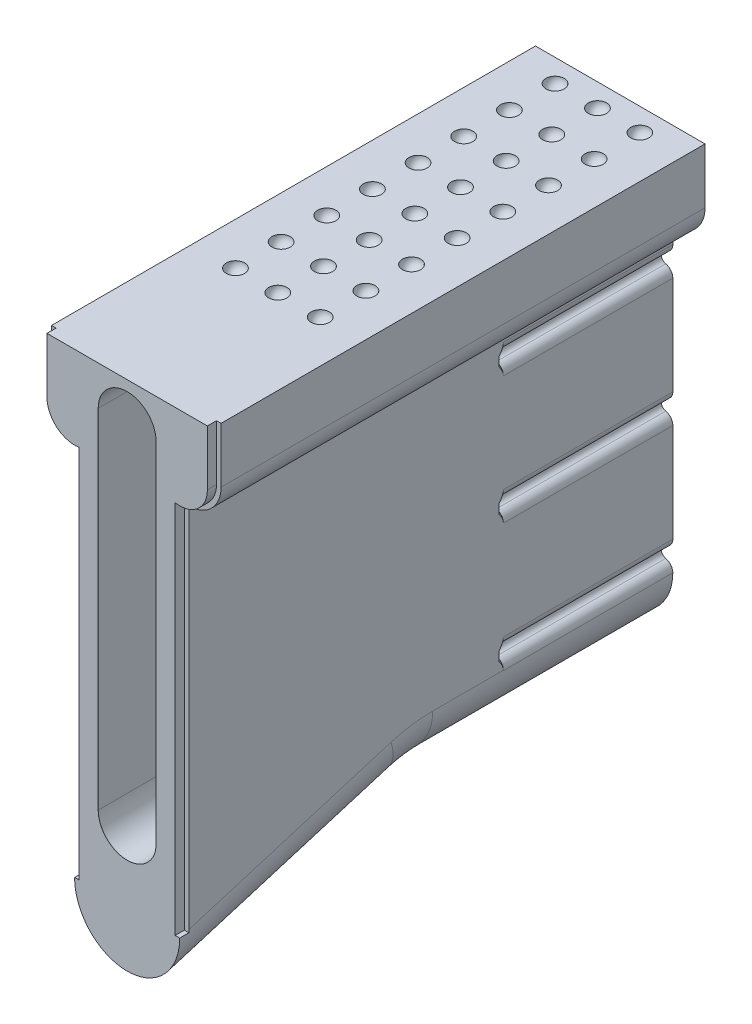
ISO-10303-21;
HEADER;
FILE_DESCRIPTION(('STEP AP214'),'2;1');
FILE_NAME('part.step','',(''),(''),'','','');
FILE_SCHEMA(('AUTOMOTIVE_DESIGN { 1 0 10303 214 1 1 1 1 }'));
ENDSEC;
DATA;
#1=APPLICATION_CONTEXT('core data for automotive mechanical design processes');
#2=APPLICATION_PROTOCOL_DEFINITION('international standard','automotive_design',2000,#1);
#3=PRODUCT_CONTEXT('',#1,'mechanical');
#4=PRODUCT('Part','Part','',(#3));
#5=PRODUCT_RELATED_PRODUCT_CATEGORY('part','',(#4));
#6=PRODUCT_DEFINITION_FORMATION('','',#4);
#7=PRODUCT_DEFINITION_CONTEXT('part definition',#1,'design');
#8=PRODUCT_DEFINITION('design','',#6,#7);
#9=PRODUCT_DEFINITION_SHAPE('','',#8);
#10=(LENGTH_UNIT() NAMED_UNIT(*) SI_UNIT(.MILLI.,.METRE.));
#11=(NAMED_UNIT(*) PLANE_ANGLE_UNIT() SI_UNIT($,.RADIAN.));
#12=(NAMED_UNIT(*) SI_UNIT($,.STERADIAN.) SOLID_ANGLE_UNIT());
#13=UNCERTAINTY_MEASURE_WITH_UNIT(LENGTH_MEASURE(1.E-05),#10,'distance_accuracy_value','');
#14=(GEOMETRIC_REPRESENTATION_CONTEXT(3) GLOBAL_UNCERTAINTY_ASSIGNED_CONTEXT((#13)) GLOBAL_UNIT_ASSIGNED_CONTEXT((#10,
#11,#12)) REPRESENTATION_CONTEXT('',''));
#15=CARTESIAN_POINT('',(0.,0.,0.));
#16=DIRECTION('',(0.,0.,1.));
#17=DIRECTION('',(1.,0.,0.));
#18=AXIS2_PLACEMENT_3D('',#15,#16,#17);
#19=CARTESIAN_POINT('',(-115.803835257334,32.3698507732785,311.217780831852));
#20=DIRECTION('',(-1.,0.,3.05311331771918E-13));
#21=DIRECTION('',(3.05311331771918E-13,0.,1.));
#22=AXIS2_PLACEMENT_3D('',#19,#20,#21);
#23=PLANE('',#22);
#24=DIRECTION('',(3.05335159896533E-13,0.,1.));
#25=VECTOR('',#24,1.);
#26=CARTESIAN_POINT('',(-115.803835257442,32.3698507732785,-42.0276957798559));
#27=LINE('',#26,#25);
#28=CARTESIAN_POINT('',(-115.803835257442,32.3698507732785,-42.0276957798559));
#29=VERTEX_POINT('',#28);
#30=CARTESIAN_POINT('',(-115.803835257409,32.3698507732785,63.9713042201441));
#31=VERTEX_POINT('',#30);
#32=EDGE_CURVE('E10',#29,#31,#27,.T.);
#33=ORIENTED_EDGE('',*,*,#32,.T.);
#34=DIRECTION('',(0.,1.,0.));
#35=VECTOR('',#34,1.);
#36=CARTESIAN_POINT('',(-115.803835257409,32.3698507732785,63.9713042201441));
#37=LINE('',#36,#35);
#38=CARTESIAN_POINT('',(-115.803835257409,44.4896208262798,63.9713042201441));
#39=VERTEX_POINT('',#38);
#40=EDGE_CURVE('E26',#31,#39,#37,.T.);
#41=ORIENTED_EDGE('',*,*,#40,.T.);
#42=DIRECTION('',(3.05167577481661E-13,0.,1.));
#43=VECTOR('',#42,1.);
#44=CARTESIAN_POINT('',(-115.803835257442,44.4896208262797,-42.027695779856));
#45=LINE('',#44,#43);
#46=CARTESIAN_POINT('',(-115.803835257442,44.4896208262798,-42.0276957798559));
#47=VERTEX_POINT('',#46);
#48=EDGE_CURVE('E892',#47,#39,#45,.T.);
#49=ORIENTED_EDGE('',*,*,#48,.F.);
#50=DIRECTION('',(0.,1.,0.));
#51=VECTOR('',#50,1.);
#52=CARTESIAN_POINT('',(-115.803835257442,32.3698507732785,-42.0276957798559));
#53=LINE('',#52,#51);
#54=EDGE_CURVE('E973',#29,#47,#53,.T.);
#55=ORIENTED_EDGE('',*,*,#54,.F.);
#56=EDGE_LOOP('',(#33,#41,#49,#55));
#57=FACE_BOUND('',#56,.T.);
#58=ADVANCED_FACE('F16',(#57),#23,.T.);
#59=CARTESIAN_POINT('',(-108.746605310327,38.1269208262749,337.721215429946));
#60=DIRECTION('',(-1.,0.,3.05311331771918E-13));
#61=DIRECTION('',(3.05311331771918E-13,0.,1.));
#62=AXIS2_PLACEMENT_3D('',#59,#60,#61);
#63=PLANE('',#62);
#64=DIRECTION('',(2.92566098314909E-13,-0.289596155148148,0.957148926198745));
#65=VECTOR('',#64,1.);
#66=CARTESIAN_POINT('',(-108.746605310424,-41.6747147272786,19.687930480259));
#67=LINE('',#66,#65);
#68=CARTESIAN_POINT('',(-108.746605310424,-41.6747147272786,19.687930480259));
#69=VERTEX_POINT('',#68);
#70=CARTESIAN_POINT('',(-108.746605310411,-55.0731466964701,63.9713042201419));
#71=VERTEX_POINT('',#70);
#72=EDGE_CURVE('E1074',#69,#71,#67,.T.);
#73=ORIENTED_EDGE('',*,*,#72,.T.);
#74=DIRECTION('',(0.,1.,0.));
#75=VECTOR('',#74,1.);
#76=CARTESIAN_POINT('',(-108.746605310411,-55.0731466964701,63.9713042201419));
#77=LINE('',#76,#75);
#78=CARTESIAN_POINT('',(-108.746605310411,25.3126208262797,63.9713042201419));
#79=VERTEX_POINT('',#78);
#80=EDGE_CURVE('E1069',#71,#79,#77,.T.);
#81=ORIENTED_EDGE('',*,*,#80,.T.);
#82=DIRECTION('',(3.05335159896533E-13,0.,1.));
#83=VECTOR('',#82,1.);
#84=CARTESIAN_POINT('',(-108.746605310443,25.3126208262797,-42.027695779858));
#85=LINE('',#84,#83);
#86=CARTESIAN_POINT('',(-108.746605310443,25.3126208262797,-42.0276957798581));
#87=VERTEX_POINT('',#86);
#88=EDGE_CURVE('E993',#87,#79,#85,.T.);
#89=ORIENTED_EDGE('',*,*,#88,.F.);
#90=DIRECTION('',(0.,1.,0.));
#91=VECTOR('',#90,1.);
#92=CARTESIAN_POINT('',(-108.746605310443,21.8715338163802,-42.0276957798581));
#93=LINE('',#92,#91);
#94=CARTESIAN_POINT('',(-108.746605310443,21.8715338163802,-42.0276957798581));
#95=VERTEX_POINT('',#94);
#96=EDGE_CURVE('E752',#95,#87,#93,.T.);
#97=ORIENTED_EDGE('',*,*,#96,.F.);
#98=DIRECTION('',(3.05475920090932E-13,0.,1.));
#99=VECTOR('',#98,1.);
#100=CARTESIAN_POINT('',(-108.746605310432,21.8715338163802,-4.92769577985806));
#101=LINE('',#100,#99);
#102=CARTESIAN_POINT('',(-108.746605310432,21.8715338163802,-4.92769577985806));
#103=VERTEX_POINT('',#102);
#104=EDGE_CURVE('E1063',#95,#103,#101,.T.);
#105=ORIENTED_EDGE('',*,*,#104,.T.);
#106=CARTESIAN_POINT('',(-108.74660531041,93.7427116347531,64.9713042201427));
#107=CARTESIAN_POINT('',(-108.746605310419,64.9115806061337,36.1513297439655));
#108=CARTESIAN_POINT('',(-108.746605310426,42.3894356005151,13.6768184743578));
#109=CARTESIAN_POINT('',(-108.746605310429,30.1673045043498,1.55669438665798));
#110=CARTESIAN_POINT('',(-108.746605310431,23.9807472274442,-4.26771205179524));
#111=CARTESIAN_POINT('',(-108.746605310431,21.46708557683,-5.23962585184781));
#112=CARTESIAN_POINT('',(-108.746605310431,18.328570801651,-2.99681372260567));
#113=CARTESIAN_POINT('',(-108.746605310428,10.0953480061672,4.97414034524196));
#114=CARTESIAN_POINT('',(-108.746605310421,-14.0640550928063,29.0496210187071));
#115=CARTESIAN_POINT('',(-108.74660531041,-49.9996440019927,64.9713042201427));
#116=(BOUNDED_CURVE() B_SPLINE_CURVE(2,(#106,#107,#108,#109,#110,#111,#112,#113,#114,#115),
.UNSPECIFIED.,.F.,.F.) B_SPLINE_CURVE_WITH_KNOTS((3,1,1,1,1,1,1,1,3),(0.,0.366792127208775,
0.970614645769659,2.76745217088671,7.95209585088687,14.3601172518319,18.0072484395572,
19.5086037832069,20.051270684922),
.UNSPECIFIED.) CURVE() GEOMETRIC_REPRESENTATION_ITEM() RATIONAL_B_SPLINE_CURVE((1.,
1.63932115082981,3.26921424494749,7.04847862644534,15.8582098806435,20.037309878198,
12.4600353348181,5.31577263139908,1.94587206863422,1.)) REPRESENTATION_ITEM(''));
#117=CARTESIAN_POINT('',(-108.746605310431,19.6354658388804,-3.92769577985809));
#118=VERTEX_POINT('',#117);
#119=EDGE_CURVE('E1054',#103,#118,#116,.T.);
#120=ORIENTED_EDGE('',*,*,#119,.T.);
#121=DIRECTION('',(0.,1.,0.));
#122=VECTOR('',#121,1.);
#123=CARTESIAN_POINT('',(-108.746605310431,17.7326508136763,-3.92769577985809));
#124=LINE('',#123,#122);
#125=CARTESIAN_POINT('',(-108.746605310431,17.7326508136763,-3.92769577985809));
#126=VERTEX_POINT('',#125);
#127=EDGE_CURVE('E598',#126,#118,#124,.T.);
#128=ORIENTED_EDGE('',*,*,#127,.F.);
#129=CARTESIAN_POINT('',(-108.74660531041,87.3677606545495,64.9713042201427));
#130=CARTESIAN_POINT('',(-108.746605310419,58.53662962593,36.1513297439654));
#131=CARTESIAN_POINT('',(-108.746605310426,36.0144846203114,13.6768184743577));
#132=CARTESIAN_POINT('',(-108.746605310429,23.7923535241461,1.55669438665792));
#133=CARTESIAN_POINT('',(-108.746605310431,17.6057962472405,-4.26771205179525));
#134=CARTESIAN_POINT('',(-108.746605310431,15.0921345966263,-5.23962585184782));
#135=CARTESIAN_POINT('',(-108.746605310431,11.9536198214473,-2.99681372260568));
#136=CARTESIAN_POINT('',(-108.746605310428,3.72039702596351,4.97414034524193));
#137=CARTESIAN_POINT('',(-108.746605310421,-20.43900607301,29.049621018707));
#138=CARTESIAN_POINT('',(-108.74660531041,-56.3745949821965,64.9713042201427));
#139=(BOUNDED_CURVE() B_SPLINE_CURVE(2,(#129,#130,#131,#132,#133,#134,#135,#136,#137,#138),
.UNSPECIFIED.,.F.,.F.) B_SPLINE_CURVE_WITH_KNOTS((3,1,1,1,1,1,1,1,3),(0.,0.366792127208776,
0.970614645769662,2.76745217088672,7.95209585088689,14.3601172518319,18.0072484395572,
19.508603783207,20.051270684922),
.UNSPECIFIED.) CURVE() GEOMETRIC_REPRESENTATION_ITEM() RATIONAL_B_SPLINE_CURVE((1.,
1.63932115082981,3.26921424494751,7.04847862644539,15.8582098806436,20.0373098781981,
12.4600353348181,5.31577263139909,1.94587206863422,1.)) REPRESENTATION_ITEM(''));
#140=CARTESIAN_POINT('',(-108.746605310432,15.4965828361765,-4.92769577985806));
#141=VERTEX_POINT('',#140);
#142=EDGE_CURVE('E1049',#126,#141,#139,.T.);
#143=ORIENTED_EDGE('',*,*,#142,.T.);
#144=DIRECTION('',(-3.05475920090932E-13,0.,-1.));
#145=VECTOR('',#144,1.);
#146=CARTESIAN_POINT('',(-108.746605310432,15.4965828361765,-4.92769577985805));
#147=LINE('',#146,#145);
#148=CARTESIAN_POINT('',(-108.746605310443,15.4965828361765,-42.0276957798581));
#149=VERTEX_POINT('',#148);
#150=EDGE_CURVE('E1045',#141,#149,#147,.T.);
#151=ORIENTED_EDGE('',*,*,#150,.T.);
#152=DIRECTION('',(0.,1.,0.));
#153=VECTOR('',#152,1.);
#154=CARTESIAN_POINT('',(-108.746605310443,-6.06846618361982,-42.0276957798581));
#155=LINE('',#154,#153);
#156=CARTESIAN_POINT('',(-108.746605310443,-6.06846618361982,-42.0276957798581));
#157=VERTEX_POINT('',#156);
#158=EDGE_CURVE('E758',#157,#149,#155,.T.);
#159=ORIENTED_EDGE('',*,*,#158,.F.);
#160=DIRECTION('',(3.05475920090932E-13,0.,1.));
#161=VECTOR('',#160,1.);
#162=CARTESIAN_POINT('',(-108.746605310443,-6.06846618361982,-42.0276957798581));
#163=LINE('',#162,#161);
#164=CARTESIAN_POINT('',(-108.746605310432,-6.06846618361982,-4.92769577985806));
#165=VERTEX_POINT('',#164);
#166=EDGE_CURVE('E1039',#157,#165,#163,.T.);
#167=ORIENTED_EDGE('',*,*,#166,.T.);
#168=CARTESIAN_POINT('',(-108.74660531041,65.8027116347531,64.9713042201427));
#169=CARTESIAN_POINT('',(-108.746605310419,36.9715806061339,36.1513297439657));
#170=CARTESIAN_POINT('',(-108.746605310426,14.4494356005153,13.676818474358));
#171=CARTESIAN_POINT('',(-108.746605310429,2.22730450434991,1.55669438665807));
#172=CARTESIAN_POINT('',(-108.746605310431,-3.9592527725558,-4.2677120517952));
#173=CARTESIAN_POINT('',(-108.746605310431,-6.47291442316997,-5.23962585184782));
#174=CARTESIAN_POINT('',(-108.746605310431,-9.61142919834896,-2.99681372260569));
#175=CARTESIAN_POINT('',(-108.746605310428,-17.8446519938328,4.9741403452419));
#176=CARTESIAN_POINT('',(-108.746605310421,-42.0040550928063,29.049621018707));
#177=CARTESIAN_POINT('',(-108.74660531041,-77.9396440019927,64.9713042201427));
#178=(BOUNDED_CURVE() B_SPLINE_CURVE(2,(#168,#169,#170,#171,#172,#173,#174,#175,#176,#177),
.UNSPECIFIED.,.F.,.F.) B_SPLINE_CURVE_WITH_KNOTS((3,1,1,1,1,1,1,1,3),(0.,0.366792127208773,
0.970614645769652,2.76745217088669,7.95209585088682,14.3601172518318,18.0072484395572,
19.5086037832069,20.051270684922),
.UNSPECIFIED.) CURVE() GEOMETRIC_REPRESENTATION_ITEM() RATIONAL_B_SPLINE_CURVE((1.,
1.6393211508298,3.26921424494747,7.04847862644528,15.8582098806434,20.037309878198,
12.4600353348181,5.3157726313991,1.94587206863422,1.)) REPRESENTATION_ITEM(''));
#179=CARTESIAN_POINT('',(-108.746605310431,-8.30453416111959,-3.92769577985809));
#180=VERTEX_POINT('',#179);
#181=EDGE_CURVE('E1030',#165,#180,#178,.T.);
#182=ORIENTED_EDGE('',*,*,#181,.T.);
#183=DIRECTION('',(0.,1.,0.));
#184=VECTOR('',#183,1.);
#185=CARTESIAN_POINT('',(-108.746605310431,-10.2073491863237,-3.92769577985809));
#186=LINE('',#185,#184);
#187=CARTESIAN_POINT('',(-108.746605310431,-10.2073491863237,-3.92769577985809));
#188=VERTEX_POINT('',#187);
#189=EDGE_CURVE('E579',#188,#180,#186,.T.);
#190=ORIENTED_EDGE('',*,*,#189,.F.);
#191=CARTESIAN_POINT('',(-108.74660531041,59.4277606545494,64.9713042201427));
#192=CARTESIAN_POINT('',(-108.746605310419,30.5966296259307,36.1513297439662));
#193=CARTESIAN_POINT('',(-108.746605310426,8.07448462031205,13.6768184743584));
#194=CARTESIAN_POINT('',(-108.746605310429,-4.14764647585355,1.55669438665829));
#195=CARTESIAN_POINT('',(-108.746605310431,-10.3342037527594,-4.26771205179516));
#196=CARTESIAN_POINT('',(-108.746605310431,-12.8478654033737,-5.23962585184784));
#197=CARTESIAN_POINT('',(-108.746605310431,-15.9863801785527,-2.99681372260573));
#198=CARTESIAN_POINT('',(-108.746605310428,-24.2196029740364,4.97414034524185));
#199=CARTESIAN_POINT('',(-108.746605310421,-48.3790060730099,29.0496210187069));
#200=CARTESIAN_POINT('',(-108.74660531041,-84.3145949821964,64.9713042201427));
#201=(BOUNDED_CURVE() B_SPLINE_CURVE(2,(#191,#192,#193,#194,#195,#196,#197,#198,#199,#200),
.UNSPECIFIED.,.F.,.F.) B_SPLINE_CURVE_WITH_KNOTS((3,1,1,1,1,1,1,1,3),(0.,0.366792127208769,
0.970614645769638,2.76745217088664,7.95209585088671,14.3601172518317,18.0072484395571,
19.5086037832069,20.051270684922),
.UNSPECIFIED.) CURVE() GEOMETRIC_REPRESENTATION_ITEM() RATIONAL_B_SPLINE_CURVE((1.,
1.63932115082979,3.2692142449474,7.04847862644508,15.858209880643,20.0373098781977,
12.460035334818,5.31577263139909,1.94587206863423,1.)) REPRESENTATION_ITEM(''));
#202=CARTESIAN_POINT('',(-108.746605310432,-12.4434171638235,-4.92769577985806));
#203=VERTEX_POINT('',#202);
#204=EDGE_CURVE('E1025',#188,#203,#201,.T.);
#205=ORIENTED_EDGE('',*,*,#204,.T.);
#206=DIRECTION('',(-3.05475920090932E-13,0.,-1.));
#207=VECTOR('',#206,1.);
#208=CARTESIAN_POINT('',(-108.746605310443,-12.4434171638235,-42.0276957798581));
#209=LINE('',#208,#207);
#210=CARTESIAN_POINT('',(-108.746605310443,-12.4434171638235,-42.0276957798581));
#211=VERTEX_POINT('',#210);
#212=EDGE_CURVE('E1021',#203,#211,#209,.T.);
#213=ORIENTED_EDGE('',*,*,#212,.T.);
#214=DIRECTION('',(0.,1.,0.));
#215=VECTOR('',#214,1.);
#216=CARTESIAN_POINT('',(-108.746605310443,-34.0084661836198,-42.0276957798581));
#217=LINE('',#216,#215);
#218=CARTESIAN_POINT('',(-108.746605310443,-34.0084661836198,-42.0276957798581));
#219=VERTEX_POINT('',#218);
#220=EDGE_CURVE('E705',#219,#211,#217,.T.);
#221=ORIENTED_EDGE('',*,*,#220,.F.);
#222=DIRECTION('',(3.05475920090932E-13,0.,1.));
#223=VECTOR('',#222,1.);
#224=CARTESIAN_POINT('',(-108.746605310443,-34.0084661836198,-42.0276957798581));
#225=LINE('',#224,#223);
#226=CARTESIAN_POINT('',(-108.746605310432,-34.0084661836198,-4.92769577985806));
#227=VERTEX_POINT('',#226);
#228=EDGE_CURVE('E1015',#219,#227,#225,.T.);
#229=ORIENTED_EDGE('',*,*,#228,.T.);
#230=CARTESIAN_POINT('',(-108.74660531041,37.8627116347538,64.9713042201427));
#231=CARTESIAN_POINT('',(-108.746605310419,9.03158060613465,36.151329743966));
#232=CARTESIAN_POINT('',(-108.746605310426,-13.4905643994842,13.6768184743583));
#233=CARTESIAN_POINT('',(-108.746605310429,-25.7126954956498,1.55669438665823));
#234=CARTESIAN_POINT('',(-108.746605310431,-31.8992527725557,-4.26771205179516));
#235=CARTESIAN_POINT('',(-108.746605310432,-34.41291442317,-5.23962585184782));
#236=CARTESIAN_POINT('',(-108.746605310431,-37.551429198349,-2.9968137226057));
#237=CARTESIAN_POINT('',(-108.746605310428,-45.7846519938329,4.97414034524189));
#238=CARTESIAN_POINT('',(-108.746605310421,-69.9440550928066,29.049621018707));
#239=CARTESIAN_POINT('',(-108.74660531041,-105.879644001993,64.9713042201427));
#240=(BOUNDED_CURVE() B_SPLINE_CURVE(2,(#230,#231,#232,#233,#234,#235,#236,#237,#238,#239),
.UNSPECIFIED.,.F.,.F.) B_SPLINE_CURVE_WITH_KNOTS((3,1,1,1,1,1,1,1,3),(0.,0.366792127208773,
0.970614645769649,2.76745217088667,7.95209585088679,14.3601172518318,18.0072484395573,
19.508603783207,20.0512706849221),
.UNSPECIFIED.) CURVE() GEOMETRIC_REPRESENTATION_ITEM() RATIONAL_B_SPLINE_CURVE((1.,
1.63932115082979,3.26921424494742,7.04847862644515,15.8582098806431,20.0373098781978,
12.460035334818,5.31577263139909,1.94587206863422,1.)) REPRESENTATION_ITEM(''));
#241=CARTESIAN_POINT('',(-108.746605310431,-36.2445341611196,-3.92769577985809));
#242=VERTEX_POINT('',#241);
#243=EDGE_CURVE('E1010',#227,#242,#240,.T.);
#244=ORIENTED_EDGE('',*,*,#243,.T.);
#245=DIRECTION('',(0.,-1.,0.));
#246=VECTOR('',#245,1.);
#247=CARTESIAN_POINT('',(-108.746605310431,-36.2445341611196,-3.92769577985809));
#248=LINE('',#247,#246);
#249=CARTESIAN_POINT('',(-108.746605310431,-38.1474704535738,-3.92769577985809));
#250=VERTEX_POINT('',#249);
#251=EDGE_CURVE('E1004',#242,#250,#248,.T.);
#252=ORIENTED_EDGE('',*,*,#251,.T.);
#253=CARTESIAN_POINT('',(-108.74660531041,31.4877973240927,64.9713042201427));
#254=CARTESIAN_POINT('',(-108.746605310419,2.65924105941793,36.1539055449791));
#255=CARTESIAN_POINT('',(-108.746605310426,-19.8631075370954,13.6791916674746));
#256=CARTESIAN_POINT('',(-108.74660531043,-32.0862824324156,1.55802453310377));
#257=CARTESIAN_POINT('',(-108.746605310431,-38.2736974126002,-4.26724375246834));
#258=CARTESIAN_POINT('',(-108.746605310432,-40.7876822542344,-5.23952106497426));
#259=CARTESIAN_POINT('',(-108.746605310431,-43.9262826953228,-2.99679778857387));
#260=CARTESIAN_POINT('',(-108.746605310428,-52.1595386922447,4.97414073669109));
#261=CARTESIAN_POINT('',(-108.746605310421,-76.3189617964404,29.0496260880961));
#262=CARTESIAN_POINT('',(-108.74660531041,-112.254548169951,64.9713042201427));
#263=(BOUNDED_CURVE() B_SPLINE_CURVE(2,(#253,#254,#255,#256,#257,#258,#259,#260,#261,#262),
.UNSPECIFIED.,.F.,.F.) B_SPLINE_CURVE_WITH_KNOTS((3,1,1,1,1,1,1,1,3),(0.,0.366770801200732,
0.970544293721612,2.76722925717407,7.95152842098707,14.3596949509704,18.0070545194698,
19.5085302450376,20.0512445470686),
.UNSPECIFIED.) CURVE() GEOMETRIC_REPRESENTATION_ITEM() RATIONAL_B_SPLINE_CURVE((1.,
1.63922490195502,3.26885276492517,7.04747940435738,15.8560354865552,20.0358000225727,
12.4596497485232,5.31571590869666,1.94586727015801,1.)) REPRESENTATION_ITEM(''));
#264=CARTESIAN_POINT('',(-108.746605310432,-40.3245041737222,-4.92664735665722));
#265=VERTEX_POINT('',#264);
#266=EDGE_CURVE('E999',#250,#265,#263,.T.);
#267=ORIENTED_EDGE('',*,*,#266,.T.);
#268=DIRECTION('',(3.06197556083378E-13,0.,1.));
#269=VECTOR('',#268,1.);
#270=CARTESIAN_POINT('',(-108.746605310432,-40.3245041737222,-4.92664735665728));
#271=LINE('',#270,#269);
#272=CARTESIAN_POINT('',(-108.746605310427,-40.3245041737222,10.5629366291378));
#273=VERTEX_POINT('',#272);
#274=EDGE_CURVE('E996',#265,#273,#271,.T.);
#275=ORIENTED_EDGE('',*,*,#274,.T.);
#276=CARTESIAN_POINT('',(-108.746605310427,-71.8338791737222,10.5629366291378));
#277=DIRECTION('',(1.,0.,-3.05311331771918E-13));
#278=DIRECTION('',(0.,1.,0.));
#279=AXIS2_PLACEMENT_3D('',#276,#277,#278);
#280=CIRCLE('',#279,31.509375);
#281=EDGE_CURVE('E994',#273,#69,#280,.T.);
#282=ORIENTED_EDGE('',*,*,#281,.T.);
#283=EDGE_LOOP('',(#73,#81,#89,#97,#105,#120,#128,#143,#151,#159,#167,#182,#190,#205,#213,#221,
#229,#244,#252,#267,#275,#282));
#284=FACE_BOUND('',#283,.T.);
#285=ADVANCED_FACE('F1100',(#284),#63,.T.);
#286=CARTESIAN_POINT('',(-108.746605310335,32.3698507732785,311.21778083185));
#287=DIRECTION('',(-3.05311331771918E-13,0.,-1.));
#288=DIRECTION('',(-1.,0.,3.05311331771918E-13));
#289=AXIS2_PLACEMENT_3D('',#286,#287,#288);
#290=CYLINDRICAL_SURFACE('',#289,7.05722994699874);
#291=ORIENTED_EDGE('',*,*,#88,.T.);
#292=CARTESIAN_POINT('',(-108.746605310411,32.3698507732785,63.9713042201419));
#293=DIRECTION('',(-3.05311331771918E-13,0.,-1.));
#294=DIRECTION('',(1.,-3.05311331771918E-13,0.));
#295=AXIS2_PLACEMENT_3D('',#292,#293,#294);
#296=CIRCLE('',#295,7.05722994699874);
#297=EDGE_CURVE('E987',#79,#31,#296,.T.);
#298=ORIENTED_EDGE('',*,*,#297,.T.);
#299=ORIENTED_EDGE('',*,*,#32,.F.);
#300=CARTESIAN_POINT('',(-108.746605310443,32.3698507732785,-42.0276957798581));
#301=DIRECTION('',(-3.05311331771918E-13,0.,-1.));
#302=DIRECTION('',(-1.,0.,3.05311331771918E-13));
#303=AXIS2_PLACEMENT_3D('',#300,#301,#302);
#304=CIRCLE('',#303,7.05722994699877);
#305=EDGE_CURVE('E988',#87,#29,#304,.T.);
#306=ORIENTED_EDGE('',*,*,#305,.F.);
#307=EDGE_LOOP('',(#291,#298,#299,#306));
#308=FACE_BOUND('',#307,.T.);
#309=ADVANCED_FACE('F1094',(#308),#290,.T.);
#310=CARTESIAN_POINT('',(-82.9497303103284,44.4896208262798,332.722104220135));
#311=DIRECTION('',(0.,1.,0.));
#312=DIRECTION('',(0.,0.,1.));
#313=AXIS2_PLACEMENT_3D('',#310,#311,#312);
#314=PLANE('',#313);
#315=DIRECTION('',(1.,0.,-3.01980662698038E-13));
#316=VECTOR('',#315,1.);
#317=CARTESIAN_POINT('',(-115.803835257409,44.4896208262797,63.9713042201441));
#318=LINE('',#317,#316);
#319=CARTESIAN_POINT('',(-114.803835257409,44.4896208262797,63.9713042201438));
#320=VERTEX_POINT('',#319);
#321=EDGE_CURVE('E985',#39,#320,#318,.T.);
#322=ORIENTED_EDGE('',*,*,#321,.T.);
#323=DIRECTION('',(3.10862446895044E-13,0.,1.));
#324=VECTOR('',#323,1.);
#325=CARTESIAN_POINT('',(-114.803835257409,44.4896208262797,63.9713042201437));
#326=LINE('',#325,#324);
#327=CARTESIAN_POINT('',(-114.803835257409,44.4896208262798,65.9713042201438));
#328=VERTEX_POINT('',#327);
#329=EDGE_CURVE('E424',#320,#328,#326,.T.);
#330=ORIENTED_EDGE('',*,*,#329,.T.);
#331=DIRECTION('',(1.,0.,-3.05386138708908E-13));
#332=VECTOR('',#331,1.);
#333=CARTESIAN_POINT('',(-114.803835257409,44.4896208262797,65.9713042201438));
#334=LINE('',#333,#332);
#335=CARTESIAN_POINT('',(-79.6706253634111,44.4896208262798,65.9713042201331));
#336=VERTEX_POINT('',#335);
#337=EDGE_CURVE('E980',#328,#336,#334,.T.);
#338=ORIENTED_EDGE('',*,*,#337,.T.);
#339=DIRECTION('',(3.06421554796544E-13,0.,1.));
#340=VECTOR('',#339,1.);
#341=CARTESIAN_POINT('',(-79.6706253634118,44.4896208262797,63.971304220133));
#342=LINE('',#341,#340);
#343=CARTESIAN_POINT('',(-79.6706253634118,44.4896208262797,63.9713042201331));
#344=VERTEX_POINT('',#343);
#345=EDGE_CURVE('E469',#344,#336,#342,.T.);
#346=ORIENTED_EDGE('',*,*,#345,.F.);
#347=DIRECTION('',(1.,0.,-3.10862446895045E-13));
#348=VECTOR('',#347,1.);
#349=CARTESIAN_POINT('',(-79.6706253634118,44.4896208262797,63.9713042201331));
#350=LINE('',#349,#348);
#351=CARTESIAN_POINT('',(-78.6706253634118,44.4896208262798,63.9713042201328));
#352=VERTEX_POINT('',#351);
#353=EDGE_CURVE('E977',#344,#352,#350,.T.);
#354=ORIENTED_EDGE('',*,*,#353,.T.);
#355=DIRECTION('',(-3.05167577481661E-13,0.,-1.));
#356=VECTOR('',#355,1.);
#357=CARTESIAN_POINT('',(-78.6706253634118,44.4896208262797,63.9713042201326));
#358=LINE('',#357,#356);
#359=CARTESIAN_POINT('',(-78.6706253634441,44.4896208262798,-42.0276957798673));
#360=VERTEX_POINT('',#359);
#361=EDGE_CURVE('E974',#352,#360,#358,.T.);
#362=ORIENTED_EDGE('',*,*,#361,.T.);
#363=DIRECTION('',(1.,0.,-3.05441906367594E-13));
#364=VECTOR('',#363,1.);
#365=CARTESIAN_POINT('',(-115.803835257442,44.4896208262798,-42.0276957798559));
#366=LINE('',#365,#364);
#367=EDGE_CURVE('E895',#47,#360,#366,.T.);
#368=ORIENTED_EDGE('',*,*,#367,.F.);
#369=ORIENTED_EDGE('',*,*,#48,.T.);
#370=EDGE_LOOP('',(#322,#330,#338,#346,#354,#362,#368,#369));
#371=FACE_BOUND('',#370,.T.);
#372=CARTESIAN_POINT('',(-87.9539278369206,44.4896208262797,32.9723042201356));
#373=DIRECTION('',(0.,1.,0.));
#374=DIRECTION('',(1.,0.,0.));
#375=AXIS2_PLACEMENT_3D('',#372,#373,#374);
#376=CIRCLE('',#375,2.);
#377=CARTESIAN_POINT('',(-85.9539278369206,44.4896208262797,32.9723042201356));
#378=VERTEX_POINT('',#377);
#379=EDGE_CURVE('E967',#378,#378,#376,.T.);
#380=ORIENTED_EDGE('',*,*,#379,.F.);
#381=EDGE_LOOP('',(#380));
#382=FACE_BOUND('',#381,.T.);
#383=CARTESIAN_POINT('',(-106.520532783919,44.4896208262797,32.9723042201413));
#384=DIRECTION('',(0.,1.,0.));
#385=DIRECTION('',(1.,0.,0.));
#386=AXIS2_PLACEMENT_3D('',#383,#384,#385);
#387=CIRCLE('',#386,2.);
#388=CARTESIAN_POINT('',(-104.520532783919,44.4896208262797,32.9723042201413));
#389=VERTEX_POINT('',#388);
#390=EDGE_CURVE('E961',#389,#389,#387,.T.);
#391=ORIENTED_EDGE('',*,*,#390,.F.);
#392=EDGE_LOOP('',(#391));
#393=FACE_BOUND('',#392,.T.);
#394=CARTESIAN_POINT('',(-97.23723031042,44.4896208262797,32.9723042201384));
#395=DIRECTION('',(0.,1.,0.));
#396=DIRECTION('',(1.,0.,0.));
#397=AXIS2_PLACEMENT_3D('',#394,#395,#396);
#398=CIRCLE('',#397,2.);
#399=CARTESIAN_POINT('',(-95.23723031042,44.4896208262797,32.9723042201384));
#400=VERTEX_POINT('',#399);
#401=EDGE_CURVE('E964',#400,#400,#398,.T.);
#402=ORIENTED_EDGE('',*,*,#401,.F.);
#403=EDGE_LOOP('',(#402));
#404=FACE_BOUND('',#403,.T.);
#405=CARTESIAN_POINT('',(-87.9539278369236,44.4896208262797,22.9723042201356));
#406=DIRECTION('',(0.,1.,0.));
#407=DIRECTION('',(1.,0.,0.));
#408=AXIS2_PLACEMENT_3D('',#405,#406,#407);
#409=CIRCLE('',#408,2.);
#410=CARTESIAN_POINT('',(-85.9539278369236,44.4896208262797,22.9723042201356));
#411=VERTEX_POINT('',#410);
#412=EDGE_CURVE('E954',#411,#411,#409,.T.);
#413=ORIENTED_EDGE('',*,*,#412,.F.);
#414=EDGE_LOOP('',(#413));
#415=FACE_BOUND('',#414,.T.);
#416=CARTESIAN_POINT('',(-106.520532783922,44.4896208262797,22.9723042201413));
#417=DIRECTION('',(0.,1.,0.));
#418=DIRECTION('',(1.,0.,0.));
#419=AXIS2_PLACEMENT_3D('',#416,#417,#418);
#420=CIRCLE('',#419,2.);
#421=CARTESIAN_POINT('',(-104.520532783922,44.4896208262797,22.9723042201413));
#422=VERTEX_POINT('',#421);
#423=EDGE_CURVE('E958',#422,#422,#420,.T.);
#424=ORIENTED_EDGE('',*,*,#423,.F.);
#425=EDGE_LOOP('',(#424));
#426=FACE_BOUND('',#425,.T.);
#427=CARTESIAN_POINT('',(-97.237230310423,44.4896208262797,22.9723042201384));
#428=DIRECTION('',(0.,1.,0.));
#429=DIRECTION('',(1.,0.,0.));
#430=AXIS2_PLACEMENT_3D('',#427,#428,#429);
#431=CIRCLE('',#430,2.);
#432=CARTESIAN_POINT('',(-95.237230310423,44.4896208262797,22.9723042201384));
#433=VERTEX_POINT('',#432);
#434=EDGE_CURVE('E955',#433,#433,#431,.T.);
#435=ORIENTED_EDGE('',*,*,#434,.F.);
#436=EDGE_LOOP('',(#435));
#437=FACE_BOUND('',#436,.T.);
#438=CARTESIAN_POINT('',(-87.9539278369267,44.4896208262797,12.9723042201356));
#439=DIRECTION('',(0.,1.,0.));
#440=DIRECTION('',(1.,0.,0.));
#441=AXIS2_PLACEMENT_3D('',#438,#439,#440);
#442=CIRCLE('',#441,2.);
#443=CARTESIAN_POINT('',(-85.9539278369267,44.4896208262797,12.9723042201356));
#444=VERTEX_POINT('',#443);
#445=EDGE_CURVE('E949',#444,#444,#442,.T.);
#446=ORIENTED_EDGE('',*,*,#445,.F.);
#447=EDGE_LOOP('',(#446));
#448=FACE_BOUND('',#447,.T.);
#449=CARTESIAN_POINT('',(-106.520532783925,44.4896208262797,12.9723042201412));
#450=DIRECTION('',(0.,1.,0.));
#451=DIRECTION('',(1.,0.,0.));
#452=AXIS2_PLACEMENT_3D('',#449,#450,#451);
#453=CIRCLE('',#452,2.);
#454=CARTESIAN_POINT('',(-104.520532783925,44.4896208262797,12.9723042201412));
#455=VERTEX_POINT('',#454);
#456=EDGE_CURVE('E945',#455,#455,#453,.T.);
#457=ORIENTED_EDGE('',*,*,#456,.F.);
#458=EDGE_LOOP('',(#457));
#459=FACE_BOUND('',#458,.T.);
#460=CARTESIAN_POINT('',(-97.2372303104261,44.4896208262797,12.9723042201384));
#461=DIRECTION('',(0.,1.,0.));
#462=DIRECTION('',(1.,0.,0.));
#463=AXIS2_PLACEMENT_3D('',#460,#461,#462);
#464=CIRCLE('',#463,2.);
#465=CARTESIAN_POINT('',(-95.2372303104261,44.4896208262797,12.9723042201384));
#466=VERTEX_POINT('',#465);
#467=EDGE_CURVE('E946',#466,#466,#464,.T.);
#468=ORIENTED_EDGE('',*,*,#467,.F.);
#469=EDGE_LOOP('',(#468));
#470=FACE_BOUND('',#469,.T.);
#471=CARTESIAN_POINT('',(-87.9539278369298,44.4896208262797,2.97230422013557));
#472=DIRECTION('',(0.,1.,0.));
#473=DIRECTION('',(1.,0.,0.));
#474=AXIS2_PLACEMENT_3D('',#471,#472,#473);
#475=CIRCLE('',#474,2.);
#476=CARTESIAN_POINT('',(-85.9539278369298,44.4896208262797,2.97230422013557));
#477=VERTEX_POINT('',#476);
#478=EDGE_CURVE('E940',#477,#477,#475,.T.);
#479=ORIENTED_EDGE('',*,*,#478,.F.);
#480=EDGE_LOOP('',(#479));
#481=FACE_BOUND('',#480,.T.);
#482=CARTESIAN_POINT('',(-106.520532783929,44.4896208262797,2.97230422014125));
#483=DIRECTION('',(0.,1.,0.));
#484=DIRECTION('',(1.,0.,0.));
#485=AXIS2_PLACEMENT_3D('',#482,#483,#484);
#486=CIRCLE('',#485,2.);
#487=CARTESIAN_POINT('',(-104.520532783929,44.4896208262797,2.97230422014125));
#488=VERTEX_POINT('',#487);
#489=EDGE_CURVE('E934',#488,#488,#486,.T.);
#490=ORIENTED_EDGE('',*,*,#489,.F.);
#491=EDGE_LOOP('',(#490));
#492=FACE_BOUND('',#491,.T.);
#493=CARTESIAN_POINT('',(-97.2372303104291,44.4896208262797,2.9723042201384));
#494=DIRECTION('',(0.,1.,0.));
#495=DIRECTION('',(1.,0.,0.));
#496=AXIS2_PLACEMENT_3D('',#493,#494,#495);
#497=CIRCLE('',#496,2.);
#498=CARTESIAN_POINT('',(-95.2372303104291,44.4896208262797,2.9723042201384));
#499=VERTEX_POINT('',#498);
#500=EDGE_CURVE('E937',#499,#499,#497,.T.);
#501=ORIENTED_EDGE('',*,*,#500,.F.);
#502=EDGE_LOOP('',(#501));
#503=FACE_BOUND('',#502,.T.);
#504=CARTESIAN_POINT('',(-87.9539278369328,44.4896208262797,-7.02769577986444));
#505=DIRECTION('',(0.,1.,0.));
#506=DIRECTION('',(1.,0.,0.));
#507=AXIS2_PLACEMENT_3D('',#504,#505,#506);
#508=CIRCLE('',#507,2.);
#509=CARTESIAN_POINT('',(-85.9539278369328,44.4896208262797,-7.02769577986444));
#510=VERTEX_POINT('',#509);
#511=EDGE_CURVE('E927',#510,#510,#508,.T.);
#512=ORIENTED_EDGE('',*,*,#511,.F.);
#513=EDGE_LOOP('',(#512));
#514=FACE_BOUND('',#513,.T.);
#515=CARTESIAN_POINT('',(-106.520532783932,44.4896208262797,-7.02769577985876));
#516=DIRECTION('',(0.,1.,0.));
#517=DIRECTION('',(1.,0.,0.));
#518=AXIS2_PLACEMENT_3D('',#515,#516,#517);
#519=CIRCLE('',#518,2.);
#520=CARTESIAN_POINT('',(-104.520532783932,44.4896208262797,-7.02769577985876));
#521=VERTEX_POINT('',#520);
#522=EDGE_CURVE('E931',#521,#521,#519,.T.);
#523=ORIENTED_EDGE('',*,*,#522,.F.);
#524=EDGE_LOOP('',(#523));
#525=FACE_BOUND('',#524,.T.);
#526=CARTESIAN_POINT('',(-97.2372303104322,44.4896208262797,-7.02769577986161));
#527=DIRECTION('',(0.,1.,0.));
#528=DIRECTION('',(1.,0.,0.));
#529=AXIS2_PLACEMENT_3D('',#526,#527,#528);
#530=CIRCLE('',#529,2.);
#531=CARTESIAN_POINT('',(-95.2372303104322,44.4896208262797,-7.02769577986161));
#532=VERTEX_POINT('',#531);
#533=EDGE_CURVE('E928',#532,#532,#530,.T.);
#534=ORIENTED_EDGE('',*,*,#533,.F.);
#535=EDGE_LOOP('',(#534));
#536=FACE_BOUND('',#535,.T.);
#537=CARTESIAN_POINT('',(-87.9539278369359,44.4896208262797,-17.0276957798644));
#538=DIRECTION('',(0.,1.,0.));
#539=DIRECTION('',(1.,0.,0.));
#540=AXIS2_PLACEMENT_3D('',#537,#538,#539);
#541=CIRCLE('',#540,2.00000000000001);
#542=CARTESIAN_POINT('',(-85.9539278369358,44.4896208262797,-17.0276957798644));
#543=VERTEX_POINT('',#542);
#544=EDGE_CURVE('E922',#543,#543,#541,.T.);
#545=ORIENTED_EDGE('',*,*,#544,.F.);
#546=EDGE_LOOP('',(#545));
#547=FACE_BOUND('',#546,.T.);
#548=CARTESIAN_POINT('',(-106.520532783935,44.4896208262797,-17.0276957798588));
#549=DIRECTION('',(0.,1.,0.));
#550=DIRECTION('',(1.,0.,0.));
#551=AXIS2_PLACEMENT_3D('',#548,#549,#550);
#552=CIRCLE('',#551,2.00000000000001);
#553=CARTESIAN_POINT('',(-104.520532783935,44.4896208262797,-17.0276957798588));
#554=VERTEX_POINT('',#553);
#555=EDGE_CURVE('E918',#554,#554,#552,.T.);
#556=ORIENTED_EDGE('',*,*,#555,.F.);
#557=EDGE_LOOP('',(#556));
#558=FACE_BOUND('',#557,.T.);
#559=CARTESIAN_POINT('',(-97.2372303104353,44.4896208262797,-17.0276957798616));
#560=DIRECTION('',(0.,1.,0.));
#561=DIRECTION('',(1.,0.,0.));
#562=AXIS2_PLACEMENT_3D('',#559,#560,#561);
#563=CIRCLE('',#562,2.00000000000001);
#564=CARTESIAN_POINT('',(-95.2372303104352,44.4896208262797,-17.0276957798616));
#565=VERTEX_POINT('',#564);
#566=EDGE_CURVE('E919',#565,#565,#563,.T.);
#567=ORIENTED_EDGE('',*,*,#566,.F.);
#568=EDGE_LOOP('',(#567));
#569=FACE_BOUND('',#568,.T.);
#570=CARTESIAN_POINT('',(-87.9539278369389,44.4896208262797,-27.0276957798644));
#571=DIRECTION('',(0.,1.,0.));
#572=DIRECTION('',(1.,0.,0.));
#573=AXIS2_PLACEMENT_3D('',#570,#571,#572);
#574=CIRCLE('',#573,2.);
#575=CARTESIAN_POINT('',(-85.9539278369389,44.4896208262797,-27.0276957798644));
#576=VERTEX_POINT('',#575);
#577=EDGE_CURVE('E911',#576,#576,#574,.T.);
#578=ORIENTED_EDGE('',*,*,#577,.F.);
#579=EDGE_LOOP('',(#578));
#580=FACE_BOUND('',#579,.T.);
#581=CARTESIAN_POINT('',(-106.520532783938,44.4896208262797,-27.0276957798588));
#582=DIRECTION('',(0.,1.,0.));
#583=DIRECTION('',(1.,0.,0.));
#584=AXIS2_PLACEMENT_3D('',#581,#582,#583);
#585=CIRCLE('',#584,2.);
#586=CARTESIAN_POINT('',(-104.520532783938,44.4896208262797,-27.0276957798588));
#587=VERTEX_POINT('',#586);
#588=EDGE_CURVE('E908',#587,#587,#585,.T.);
#589=ORIENTED_EDGE('',*,*,#588,.F.);
#590=EDGE_LOOP('',(#589));
#591=FACE_BOUND('',#590,.T.);
#592=CARTESIAN_POINT('',(-97.2372303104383,44.4896208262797,-27.0276957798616));
#593=DIRECTION('',(0.,1.,0.));
#594=DIRECTION('',(1.,0.,0.));
#595=AXIS2_PLACEMENT_3D('',#592,#593,#594);
#596=CIRCLE('',#595,2.);
#597=CARTESIAN_POINT('',(-95.2372303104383,44.4896208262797,-27.0276957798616));
#598=VERTEX_POINT('',#597);
#599=EDGE_CURVE('E903',#598,#598,#596,.T.);
#600=ORIENTED_EDGE('',*,*,#599,.F.);
#601=EDGE_LOOP('',(#600));
#602=FACE_BOUND('',#601,.T.);
#603=CARTESIAN_POINT('',(-87.953927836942,44.4896208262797,-37.0276957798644));
#604=DIRECTION('',(0.,1.,0.));
#605=DIRECTION('',(1.,0.,0.));
#606=AXIS2_PLACEMENT_3D('',#603,#604,#605);
#607=CIRCLE('',#606,2.);
#608=CARTESIAN_POINT('',(-85.953927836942,44.4896208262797,-37.0276957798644));
#609=VERTEX_POINT('',#608);
#610=EDGE_CURVE('E904',#609,#609,#607,.T.);
#611=ORIENTED_EDGE('',*,*,#610,.F.);
#612=EDGE_LOOP('',(#611));
#613=FACE_BOUND('',#612,.T.);
#614=CARTESIAN_POINT('',(-106.520532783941,44.4896208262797,-37.0276957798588));
#615=DIRECTION('',(0.,1.,0.));
#616=DIRECTION('',(1.,0.,0.));
#617=AXIS2_PLACEMENT_3D('',#614,#615,#616);
#618=CIRCLE('',#617,2.);
#619=CARTESIAN_POINT('',(-104.520532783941,44.4896208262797,-37.0276957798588));
#620=VERTEX_POINT('',#619);
#621=EDGE_CURVE('E905',#620,#620,#618,.T.);
#622=ORIENTED_EDGE('',*,*,#621,.F.);
#623=EDGE_LOOP('',(#622));
#624=FACE_BOUND('',#623,.T.);
#625=CARTESIAN_POINT('',(-97.2372303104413,44.4896208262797,-37.0276957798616));
#626=DIRECTION('',(0.,1.,0.));
#627=DIRECTION('',(1.,0.,0.));
#628=AXIS2_PLACEMENT_3D('',#625,#626,#627);
#629=CIRCLE('',#628,2.);
#630=CARTESIAN_POINT('',(-95.2372303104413,44.4896208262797,-37.0276957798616));
#631=VERTEX_POINT('',#630);
#632=EDGE_CURVE('E900',#631,#631,#629,.T.);
#633=ORIENTED_EDGE('',*,*,#632,.F.);
#634=EDGE_LOOP('',(#633));
#635=FACE_BOUND('',#634,.T.);
#636=ADVANCED_FACE('F1085',(#371,#382,#393,#404,#415,#426,#437,#448,#459,#470,#481,#492,#503,
#514,#525,#536,#547,#558,#569,#580,#591,#602,#613,#624,#635),#314,.T.);
#637=CARTESIAN_POINT('',(-78.6706253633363,32.3698507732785,311.217780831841));
#638=DIRECTION('',(-1.,0.,3.05311331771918E-13));
#639=DIRECTION('',(3.05311331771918E-13,0.,1.));
#640=AXIS2_PLACEMENT_3D('',#637,#638,#639);
#641=PLANE('',#640);
#642=DIRECTION('',(0.,1.,0.));
#643=VECTOR('',#642,1.);
#644=CARTESIAN_POINT('',(-78.6706253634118,32.3698507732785,63.9713042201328));
#645=LINE('',#644,#643);
#646=CARTESIAN_POINT('',(-78.6706253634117,32.3698507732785,63.9713042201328));
#647=VERTEX_POINT('',#646);
#648=EDGE_CURVE('E801',#647,#352,#645,.T.);
#649=ORIENTED_EDGE('',*,*,#648,.F.);
#650=DIRECTION('',(3.05251368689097E-13,0.,1.));
#651=VECTOR('',#650,1.);
#652=CARTESIAN_POINT('',(-78.6706253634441,32.3698507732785,-42.0276957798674));
#653=LINE('',#652,#651);
#654=CARTESIAN_POINT('',(-78.6706253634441,32.3698507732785,-42.0276957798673));
#655=VERTEX_POINT('',#654);
#656=EDGE_CURVE('E808',#655,#647,#653,.T.);
#657=ORIENTED_EDGE('',*,*,#656,.F.);
#658=DIRECTION('',(0.,-1.,0.));
#659=VECTOR('',#658,1.);
#660=CARTESIAN_POINT('',(-78.6706253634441,44.4896208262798,-42.0276957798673));
#661=LINE('',#660,#659);
#662=EDGE_CURVE('E805',#360,#655,#661,.T.);
#663=ORIENTED_EDGE('',*,*,#662,.F.);
#664=ORIENTED_EDGE('',*,*,#361,.F.);
#665=EDGE_LOOP('',(#649,#657,#663,#664));
#666=FACE_BOUND('',#665,.T.);
#667=ADVANCED_FACE('F1131',(#666),#641,.F.);
#668=CARTESIAN_POINT('',(-85.7278553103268,38.1269208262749,337.721215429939));
#669=DIRECTION('',(-1.,0.,3.05311331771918E-13));
#670=DIRECTION('',(3.05311331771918E-13,0.,1.));
#671=AXIS2_PLACEMENT_3D('',#668,#669,#670);
#672=PLANE('',#671);
#673=DIRECTION('',(0.,1.,0.));
#674=VECTOR('',#673,1.);
#675=CARTESIAN_POINT('',(-85.7278553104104,-55.0731466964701,63.9713042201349));
#676=LINE('',#675,#674);
#677=CARTESIAN_POINT('',(-85.7278553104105,-55.0731466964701,63.9713042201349));
#678=VERTEX_POINT('',#677);
#679=CARTESIAN_POINT('',(-85.7278553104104,25.3126208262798,63.9713042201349));
#680=VERTEX_POINT('',#679);
#681=EDGE_CURVE('E449',#678,#680,#676,.T.);
#682=ORIENTED_EDGE('',*,*,#681,.F.);
#683=DIRECTION('',(-2.92182153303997E-13,0.289596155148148,-0.957148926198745));
#684=VECTOR('',#683,1.);
#685=CARTESIAN_POINT('',(-85.7278553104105,-55.0731466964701,63.9713042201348));
#686=LINE('',#685,#684);
#687=CARTESIAN_POINT('',(-85.727855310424,-41.6747147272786,19.687930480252));
#688=VERTEX_POINT('',#687);
#689=EDGE_CURVE('E889',#678,#688,#686,.T.);
#690=ORIENTED_EDGE('',*,*,#689,.T.);
#691=CARTESIAN_POINT('',(-85.7278553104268,-71.8338791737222,10.5629366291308));
#692=DIRECTION('',(-1.,0.,3.05311331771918E-13));
#693=DIRECTION('',(0.,1.,0.));
#694=AXIS2_PLACEMENT_3D('',#691,#692,#693);
#695=CIRCLE('',#694,31.509375);
#696=CARTESIAN_POINT('',(-85.7278553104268,-40.3245041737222,10.5629366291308));
#697=VERTEX_POINT('',#696);
#698=EDGE_CURVE('E886',#688,#697,#695,.T.);
#699=ORIENTED_EDGE('',*,*,#698,.T.);
#700=DIRECTION('',(-3.06197556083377E-13,0.,-1.));
#701=VECTOR('',#700,1.);
#702=CARTESIAN_POINT('',(-85.7278553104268,-40.3245041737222,10.5629366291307));
#703=LINE('',#702,#701);
#704=CARTESIAN_POINT('',(-85.7278553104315,-40.3245041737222,-4.92664735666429));
#705=VERTEX_POINT('',#704);
#706=EDGE_CURVE('E880',#697,#705,#703,.T.);
#707=ORIENTED_EDGE('',*,*,#706,.T.);
#708=CARTESIAN_POINT('',(-85.7278553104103,-112.254548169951,64.9713042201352));
#709=CARTESIAN_POINT('',(-85.7278553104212,-76.3189617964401,29.0496260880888));
#710=CARTESIAN_POINT('',(-85.7278553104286,-52.1595386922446,4.97414073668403));
#711=CARTESIAN_POINT('',(-85.727855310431,-43.9262826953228,-2.99679778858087));
#712=CARTESIAN_POINT('',(-85.7278553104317,-40.7876822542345,-5.2395210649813));
#713=CARTESIAN_POINT('',(-85.7278553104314,-38.2736974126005,-4.26724375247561));
#714=CARTESIAN_POINT('',(-85.7278553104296,-32.0862824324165,1.55802453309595));
#715=CARTESIAN_POINT('',(-85.7278553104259,-19.863107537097,13.6791916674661));
#716=CARTESIAN_POINT('',(-85.7278553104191,2.65924105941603,36.1539055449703));
#717=CARTESIAN_POINT('',(-85.7278553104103,31.4877973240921,64.9713042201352));
#718=(BOUNDED_CURVE() B_SPLINE_CURVE(2,(#708,#709,#710,#711,#712,#713,#714,#715,#716,#717),
.UNSPECIFIED.,.F.,.F.) B_SPLINE_CURVE_WITH_KNOTS((3,1,1,1,1,1,1,1,3),(0.,0.542714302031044,
2.04419002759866,5.69154959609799,12.0997161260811,17.2840152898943,19.0807002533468,
19.6844737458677,20.0512445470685),
.UNSPECIFIED.) CURVE() GEOMETRIC_REPRESENTATION_ITEM() RATIONAL_B_SPLINE_CURVE((1.,
1.94586727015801,5.3157159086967,12.4596497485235,20.0358000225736,15.8560354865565,
7.04747940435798,3.26885276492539,1.63922490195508,1.)) REPRESENTATION_ITEM(''));
#719=CARTESIAN_POINT('',(-85.7278553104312,-38.1474704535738,-3.92769577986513));
#720=VERTEX_POINT('',#719);
#721=EDGE_CURVE('E871',#705,#720,#718,.T.);
#722=ORIENTED_EDGE('',*,*,#721,.T.);
#723=DIRECTION('',(0.,-1.,0.));
#724=VECTOR('',#723,1.);
#725=CARTESIAN_POINT('',(-85.7278553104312,-36.2445341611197,-3.92769577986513));
#726=LINE('',#725,#724);
#727=CARTESIAN_POINT('',(-85.7278553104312,-36.2445341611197,-3.92769577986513));
#728=VERTEX_POINT('',#727);
#729=EDGE_CURVE('E635',#728,#720,#726,.T.);
#730=ORIENTED_EDGE('',*,*,#729,.F.);
#731=CARTESIAN_POINT('',(-85.7278553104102,-105.879644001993,64.9713042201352));
#732=CARTESIAN_POINT('',(-85.7278553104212,-69.9440550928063,29.0496210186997));
#733=CARTESIAN_POINT('',(-85.7278553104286,-45.7846519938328,4.97414034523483));
#734=CARTESIAN_POINT('',(-85.727855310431,-37.551429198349,-2.9968137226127));
#735=CARTESIAN_POINT('',(-85.7278553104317,-34.41291442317,-5.23962585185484));
#736=CARTESIAN_POINT('',(-85.7278553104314,-31.8992527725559,-4.26771205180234));
#737=CARTESIAN_POINT('',(-85.7278553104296,-25.7126954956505,1.55669438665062));
#738=CARTESIAN_POINT('',(-85.7278553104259,-13.4905643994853,13.6768184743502));
#739=CARTESIAN_POINT('',(-85.727855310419,9.03158060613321,36.1513297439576));
#740=CARTESIAN_POINT('',(-85.7278553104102,37.8627116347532,64.9713042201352));
#741=(BOUNDED_CURVE() B_SPLINE_CURVE(2,(#731,#732,#733,#734,#735,#736,#737,#738,#739,#740),
.UNSPECIFIED.,.F.,.F.) B_SPLINE_CURVE_WITH_KNOTS((3,1,1,1,1,1,1,1,3),(0.,0.542666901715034,
2.04402224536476,5.69115343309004,12.099174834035,17.2838185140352,19.0806560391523,
19.6844785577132,20.051270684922),
.UNSPECIFIED.) CURVE() GEOMETRIC_REPRESENTATION_ITEM() RATIONAL_B_SPLINE_CURVE((1.,
1.94587206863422,5.31577263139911,12.4600353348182,20.0373098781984,15.858209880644,
7.04847862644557,3.26921424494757,1.63932115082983,1.)) REPRESENTATION_ITEM(''));
#742=CARTESIAN_POINT('',(-85.7278553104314,-34.0084661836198,-4.9276957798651));
#743=VERTEX_POINT('',#742);
#744=EDGE_CURVE('E866',#728,#743,#741,.T.);
#745=ORIENTED_EDGE('',*,*,#744,.T.);
#746=DIRECTION('',(-3.05475920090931E-13,0.,-1.));
#747=VECTOR('',#746,1.);
#748=CARTESIAN_POINT('',(-85.7278553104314,-34.0084661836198,-4.92769577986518));
#749=LINE('',#748,#747);
#750=CARTESIAN_POINT('',(-85.7278553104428,-34.0084661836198,-42.0276957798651));
#751=VERTEX_POINT('',#750);
#752=EDGE_CURVE('E862',#743,#751,#749,.T.);
#753=ORIENTED_EDGE('',*,*,#752,.T.);
#754=DIRECTION('',(0.,-1.,0.));
#755=VECTOR('',#754,1.);
#756=CARTESIAN_POINT('',(-85.7278553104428,-12.4434171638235,-42.0276957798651));
#757=LINE('',#756,#755);
#758=CARTESIAN_POINT('',(-85.7278553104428,-12.4434171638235,-42.0276957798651));
#759=VERTEX_POINT('',#758);
#760=EDGE_CURVE('E727',#759,#751,#757,.T.);
#761=ORIENTED_EDGE('',*,*,#760,.F.);
#762=DIRECTION('',(3.05475920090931E-13,0.,1.));
#763=VECTOR('',#762,1.);
#764=CARTESIAN_POINT('',(-85.7278553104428,-12.4434171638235,-42.0276957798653));
#765=LINE('',#764,#763);
#766=CARTESIAN_POINT('',(-85.7278553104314,-12.4434171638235,-4.9276957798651));
#767=VERTEX_POINT('',#766);
#768=EDGE_CURVE('E856',#759,#767,#765,.T.);
#769=ORIENTED_EDGE('',*,*,#768,.T.);
#770=CARTESIAN_POINT('',(-85.7278553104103,-84.3145949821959,64.9713042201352));
#771=CARTESIAN_POINT('',(-85.7278553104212,-48.3790060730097,29.0496210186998));
#772=CARTESIAN_POINT('',(-85.7278553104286,-24.2196029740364,4.97414034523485));
#773=CARTESIAN_POINT('',(-85.727855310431,-15.9863801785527,-2.9968137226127));
#774=CARTESIAN_POINT('',(-85.7278553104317,-12.8478654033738,-5.23962585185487));
#775=CARTESIAN_POINT('',(-85.7278553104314,-10.3342037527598,-4.26771205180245));
#776=CARTESIAN_POINT('',(-85.7278553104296,-4.14764647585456,1.55669438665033));
#777=CARTESIAN_POINT('',(-85.7278553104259,8.07448462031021,13.6768184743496));
#778=CARTESIAN_POINT('',(-85.7278553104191,30.5966296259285,36.1513297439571));
#779=CARTESIAN_POINT('',(-85.7278553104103,59.4277606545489,64.9713042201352));
#780=(BOUNDED_CURVE() B_SPLINE_CURVE(2,(#770,#771,#772,#773,#774,#775,#776,#777,#778,#779),
.UNSPECIFIED.,.F.,.F.) B_SPLINE_CURVE_WITH_KNOTS((3,1,1,1,1,1,1,1,3),(0.,0.54266690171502,
2.04402224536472,5.69115343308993,12.0991748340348,17.2838185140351,19.0806560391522,
19.6844785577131,20.0512706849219),
.UNSPECIFIED.) CURVE() GEOMETRIC_REPRESENTATION_ITEM() RATIONAL_B_SPLINE_CURVE((1.,
1.94587206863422,5.31577263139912,12.4600353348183,20.0373098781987,15.8582098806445,
7.04847862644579,3.26921424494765,1.63932115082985,1.)) REPRESENTATION_ITEM(''));
#781=CARTESIAN_POINT('',(-85.7278553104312,-10.2073491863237,-3.92769577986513));
#782=VERTEX_POINT('',#781);
#783=EDGE_CURVE('E847',#767,#782,#780,.T.);
#784=ORIENTED_EDGE('',*,*,#783,.T.);
#785=DIRECTION('',(0.,-1.,0.));
#786=VECTOR('',#785,1.);
#787=CARTESIAN_POINT('',(-85.7278553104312,-8.30453416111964,-3.92769577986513));
#788=LINE('',#787,#786);
#789=CARTESIAN_POINT('',(-85.7278553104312,-8.30453416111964,-3.92769577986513));
#790=VERTEX_POINT('',#789);
#791=EDGE_CURVE('E645',#790,#782,#788,.T.);
#792=ORIENTED_EDGE('',*,*,#791,.F.);
#793=CARTESIAN_POINT('',(-85.7278553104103,-77.9396440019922,64.9713042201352));
#794=CARTESIAN_POINT('',(-85.7278553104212,-42.004055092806,29.0496210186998));
#795=CARTESIAN_POINT('',(-85.7278553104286,-17.8446519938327,4.97414034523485));
#796=CARTESIAN_POINT('',(-85.727855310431,-9.61142919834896,-2.9968137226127));
#797=CARTESIAN_POINT('',(-85.7278553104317,-6.47291442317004,-5.23962585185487));
#798=CARTESIAN_POINT('',(-85.7278553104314,-3.95925277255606,-4.26771205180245));
#799=CARTESIAN_POINT('',(-85.7278553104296,2.22730450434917,1.55669438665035));
#800=CARTESIAN_POINT('',(-85.7278553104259,14.4494356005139,13.6768184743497));
#801=CARTESIAN_POINT('',(-85.7278553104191,36.9715806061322,36.1513297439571));
#802=CARTESIAN_POINT('',(-85.7278553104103,65.8027116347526,64.9713042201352));
#803=(BOUNDED_CURVE() B_SPLINE_CURVE(2,(#793,#794,#795,#796,#797,#798,#799,#800,#801,#802),
.UNSPECIFIED.,.F.,.F.) B_SPLINE_CURVE_WITH_KNOTS((3,1,1,1,1,1,1,1,3),(0.,0.54266690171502,
2.04402224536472,5.69115343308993,12.0991748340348,17.2838185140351,19.0806560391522,
19.6844785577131,20.0512706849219),
.UNSPECIFIED.) CURVE() GEOMETRIC_REPRESENTATION_ITEM() RATIONAL_B_SPLINE_CURVE((1.,
1.94587206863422,5.31577263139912,12.4600353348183,20.0373098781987,15.8582098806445,
7.04847862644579,3.26921424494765,1.63932115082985,1.)) REPRESENTATION_ITEM(''));
#804=CARTESIAN_POINT('',(-85.7278553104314,-6.0684661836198,-4.9276957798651));
#805=VERTEX_POINT('',#804);
#806=EDGE_CURVE('E842',#790,#805,#803,.T.);
#807=ORIENTED_EDGE('',*,*,#806,.T.);
#808=DIRECTION('',(-3.05475920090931E-13,0.,-1.));
#809=VECTOR('',#808,1.);
#810=CARTESIAN_POINT('',(-85.7278553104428,-6.0684661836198,-42.0276957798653));
#811=LINE('',#810,#809);
#812=CARTESIAN_POINT('',(-85.7278553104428,-6.0684661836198,-42.0276957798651));
#813=VERTEX_POINT('',#812);
#814=EDGE_CURVE('E838',#805,#813,#811,.T.);
#815=ORIENTED_EDGE('',*,*,#814,.T.);
#816=DIRECTION('',(0.,-1.,0.));
#817=VECTOR('',#816,1.);
#818=CARTESIAN_POINT('',(-85.7278553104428,15.4965828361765,-42.0276957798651));
#819=LINE('',#818,#817);
#820=CARTESIAN_POINT('',(-85.7278553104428,15.4965828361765,-42.0276957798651));
#821=VERTEX_POINT('',#820);
#822=EDGE_CURVE('E737',#821,#813,#819,.T.);
#823=ORIENTED_EDGE('',*,*,#822,.F.);
#824=DIRECTION('',(3.05475920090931E-13,0.,1.));
#825=VECTOR('',#824,1.);
#826=CARTESIAN_POINT('',(-85.7278553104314,15.4965828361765,-4.92769577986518));
#827=LINE('',#826,#825);
#828=CARTESIAN_POINT('',(-85.7278553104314,15.4965828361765,-4.9276957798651));
#829=VERTEX_POINT('',#828);
#830=EDGE_CURVE('E832',#821,#829,#827,.T.);
#831=ORIENTED_EDGE('',*,*,#830,.T.);
#832=CARTESIAN_POINT('',(-85.7278553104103,-56.3745949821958,64.9713042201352));
#833=CARTESIAN_POINT('',(-85.7278553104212,-20.4390060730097,29.0496210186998));
#834=CARTESIAN_POINT('',(-85.7278553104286,3.72039702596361,4.97414034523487));
#835=CARTESIAN_POINT('',(-85.727855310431,11.9536198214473,-2.99681372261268));
#836=CARTESIAN_POINT('',(-85.7278553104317,15.0921345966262,-5.23962585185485));
#837=CARTESIAN_POINT('',(-85.7278553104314,17.6057962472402,-4.26771205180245));
#838=CARTESIAN_POINT('',(-85.7278553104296,23.7923535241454,1.55669438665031));
#839=CARTESIAN_POINT('',(-85.7278553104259,36.0144846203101,13.6768184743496));
#840=CARTESIAN_POINT('',(-85.7278553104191,58.5366296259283,36.151329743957));
#841=CARTESIAN_POINT('',(-85.7278553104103,87.3677606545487,64.9713042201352));
#842=(BOUNDED_CURVE() B_SPLINE_CURVE(2,(#832,#833,#834,#835,#836,#837,#838,#839,#840,#841),
.UNSPECIFIED.,.F.,.F.) B_SPLINE_CURVE_WITH_KNOTS((3,1,1,1,1,1,1,1,3),(0.,0.542666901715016,
2.0440222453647,5.6911534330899,12.0991748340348,17.2838185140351,19.0806560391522,
19.6844785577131,20.0512706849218),
.UNSPECIFIED.) CURVE() GEOMETRIC_REPRESENTATION_ITEM() RATIONAL_B_SPLINE_CURVE((1.,
1.94587206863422,5.31577263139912,12.4600353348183,20.0373098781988,15.8582098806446,
7.04847862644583,3.26921424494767,1.63932115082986,1.)) REPRESENTATION_ITEM(''));
#843=CARTESIAN_POINT('',(-85.7278553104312,17.7326508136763,-3.92769577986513));
#844=VERTEX_POINT('',#843);
#845=EDGE_CURVE('E827',#829,#844,#842,.T.);
#846=ORIENTED_EDGE('',*,*,#845,.T.);
#847=DIRECTION('',(0.,1.,0.));
#848=VECTOR('',#847,1.);
#849=CARTESIAN_POINT('',(-85.7278553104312,17.7326508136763,-3.92769577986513));
#850=LINE('',#849,#848);
#851=CARTESIAN_POINT('',(-85.7278553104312,19.6354658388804,-3.92769577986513));
#852=VERTEX_POINT('',#851);
#853=EDGE_CURVE('E821',#844,#852,#850,.T.);
#854=ORIENTED_EDGE('',*,*,#853,.T.);
#855=CARTESIAN_POINT('',(-85.7278553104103,-49.999644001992,64.9713042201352));
#856=CARTESIAN_POINT('',(-85.7278553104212,-14.0640550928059,29.0496210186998));
#857=CARTESIAN_POINT('',(-85.7278553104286,10.0953480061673,4.97414034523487));
#858=CARTESIAN_POINT('',(-85.727855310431,18.328570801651,-2.99681372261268));
#859=CARTESIAN_POINT('',(-85.7278553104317,21.46708557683,-5.23962585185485));
#860=CARTESIAN_POINT('',(-85.7278553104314,23.9807472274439,-4.26771205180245));
#861=CARTESIAN_POINT('',(-85.7278553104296,30.1673045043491,1.5566943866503));
#862=CARTESIAN_POINT('',(-85.7278553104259,42.3894356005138,13.6768184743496));
#863=CARTESIAN_POINT('',(-85.7278553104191,64.9115806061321,36.151329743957));
#864=CARTESIAN_POINT('',(-85.7278553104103,93.7427116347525,64.9713042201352));
#865=(BOUNDED_CURVE() B_SPLINE_CURVE(2,(#855,#856,#857,#858,#859,#860,#861,#862,#863,#864),
.UNSPECIFIED.,.F.,.F.) B_SPLINE_CURVE_WITH_KNOTS((3,1,1,1,1,1,1,1,3),(0.,0.542666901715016,
2.0440222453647,5.6911534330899,12.0991748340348,17.2838185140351,19.0806560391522,
19.6844785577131,20.0512706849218),
.UNSPECIFIED.) CURVE() GEOMETRIC_REPRESENTATION_ITEM() RATIONAL_B_SPLINE_CURVE((1.,
1.94587206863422,5.31577263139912,12.4600353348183,20.0373098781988,15.8582098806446,
7.04847862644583,3.26921424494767,1.63932115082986,1.)) REPRESENTATION_ITEM(''));
#866=CARTESIAN_POINT('',(-85.7278553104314,21.8715338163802,-4.9276957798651));
#867=VERTEX_POINT('',#866);
#868=EDGE_CURVE('E816',#852,#867,#865,.T.);
#869=ORIENTED_EDGE('',*,*,#868,.T.);
#870=DIRECTION('',(-3.05475920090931E-13,0.,-1.));
#871=VECTOR('',#870,1.);
#872=CARTESIAN_POINT('',(-85.7278553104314,21.8715338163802,-4.92769577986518));
#873=LINE('',#872,#871);
#874=CARTESIAN_POINT('',(-85.7278553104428,21.8715338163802,-42.0276957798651));
#875=VERTEX_POINT('',#874);
#876=EDGE_CURVE('E812',#867,#875,#873,.T.);
#877=ORIENTED_EDGE('',*,*,#876,.T.);
#878=DIRECTION('',(0.,-1.,0.));
#879=VECTOR('',#878,1.);
#880=CARTESIAN_POINT('',(-85.7278553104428,25.3126208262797,-42.0276957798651));
#881=LINE('',#880,#879);
#882=CARTESIAN_POINT('',(-85.7278553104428,25.3126208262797,-42.0276957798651));
#883=VERTEX_POINT('',#882);
#884=EDGE_CURVE('E747',#883,#875,#881,.T.);
#885=ORIENTED_EDGE('',*,*,#884,.F.);
#886=DIRECTION('',(3.05335159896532E-13,0.,1.));
#887=VECTOR('',#886,1.);
#888=CARTESIAN_POINT('',(-85.7278553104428,25.3126208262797,-42.0276957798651));
#889=LINE('',#888,#887);
#890=EDGE_CURVE('E809',#883,#680,#889,.T.);
#891=ORIENTED_EDGE('',*,*,#890,.T.);
#892=EDGE_LOOP('',(#682,#690,#699,#707,#722,#730,#745,#753,#761,#769,#784,#792,#807,#815,#823,
#831,#846,#854,#869,#877,#885,#891));
#893=FACE_BOUND('',#892,.T.);
#894=ADVANCED_FACE('F1134',(#893),#672,.F.);
#895=CARTESIAN_POINT('',(-85.727855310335,32.3698507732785,311.217780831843));
#896=DIRECTION('',(-3.05311331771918E-13,0.,-1.));
#897=DIRECTION('',(-1.,0.,3.05311331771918E-13));
#898=AXIS2_PLACEMENT_3D('',#895,#896,#897);
#899=CYLINDRICAL_SURFACE('',#898,7.05722994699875);
#900=ORIENTED_EDGE('',*,*,#656,.T.);
#901=CARTESIAN_POINT('',(-85.7278553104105,32.3698507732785,63.9713042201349));
#902=DIRECTION('',(-3.05311331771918E-13,0.,-1.));
#903=DIRECTION('',(1.,-3.05311331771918E-13,0.));
#904=AXIS2_PLACEMENT_3D('',#901,#902,#903);
#905=CIRCLE('',#904,7.05722994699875);
#906=EDGE_CURVE('E799',#647,#680,#905,.T.);
#907=ORIENTED_EDGE('',*,*,#906,.T.);
#908=ORIENTED_EDGE('',*,*,#890,.F.);
#909=CARTESIAN_POINT('',(-85.7278553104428,32.3698507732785,-42.0276957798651));
#910=DIRECTION('',(-3.05311331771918E-13,0.,-1.));
#911=DIRECTION('',(-1.,0.,3.05311331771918E-13));
#912=AXIS2_PLACEMENT_3D('',#909,#910,#911);
#913=CIRCLE('',#912,7.05722994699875);
#914=EDGE_CURVE('E802',#655,#883,#913,.T.);
#915=ORIENTED_EDGE('',*,*,#914,.F.);
#916=EDGE_LOOP('',(#900,#907,#908,#915));
#917=FACE_BOUND('',#916,.T.);
#918=ADVANCED_FACE('F1138',(#917),#899,.T.);
#919=CARTESIAN_POINT('',(-97.2372303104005,-64.9388111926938,96.5784711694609));
#920=DIRECTION('',(2.922284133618E-13,-0.289596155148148,0.957148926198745));
#921=DIRECTION('',(-1.,-1.00908941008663E-12,0.));
#922=AXIS2_PLACEMENT_3D('',#919,#920,#921);
#923=CYLINDRICAL_SURFACE('',#922,11.509375);
#924=CARTESIAN_POINT('',(-97.2372303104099,-55.6782691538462,65.9713042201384));
#925=DIRECTION('',(0.,1.,0.));
#926=DIRECTION('',(3.05311331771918E-13,0.,1.));
#927=AXIS2_PLACEMENT_3D('',#924,#925,#926);
#928=ELLIPSE('',#927,39.7428446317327,11.509375);
#929=CARTESIAN_POINT('',(-108.732022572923,-55.6782691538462,63.9713042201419));
#930=VERTEX_POINT('',#929);
#931=CARTESIAN_POINT('',(-108.74660531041,-55.6782691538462,65.9713042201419));
#932=VERTEX_POINT('',#931);
#933=EDGE_CURVE('E432',#930,#932,#928,.T.);
#934=ORIENTED_EDGE('',*,*,#933,.F.);
#935=CARTESIAN_POINT('',(-97.2372303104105,-55.0731466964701,63.9713042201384));
#936=DIRECTION('',(-3.05311331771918E-13,0.,-1.));
#937=DIRECTION('',(0.,-1.,0.));
#938=AXIS2_PLACEMENT_3D('',#935,#936,#937);
#939=ELLIPSE('',#938,12.0246439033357,11.509375);
#940=EDGE_CURVE('E796',#930,#71,#939,.T.);
#941=ORIENTED_EDGE('',*,*,#940,.T.);
#942=ORIENTED_EDGE('',*,*,#72,.F.);
#943=CARTESIAN_POINT('',(-97.237230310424,-41.6747147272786,19.6879304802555));
#944=DIRECTION('',(2.922284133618E-13,-0.289596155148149,0.957148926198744));
#945=DIRECTION('',(-1.,-1.00908941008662E-12,0.));
#946=AXIS2_PLACEMENT_3D('',#943,#944,#945);
#947=CIRCLE('',#946,11.509375);
#948=EDGE_CURVE('E793',#69,#688,#947,.T.);
#949=ORIENTED_EDGE('',*,*,#948,.T.);
#950=ORIENTED_EDGE('',*,*,#689,.F.);
#951=CARTESIAN_POINT('',(-97.2372303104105,-55.0731466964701,63.9713042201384));
#952=DIRECTION('',(-3.05311331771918E-13,0.,-1.));
#953=DIRECTION('',(0.,-1.,0.));
#954=AXIS2_PLACEMENT_3D('',#951,#952,#953);
#955=ELLIPSE('',#954,12.0246439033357,11.509375);
#956=CARTESIAN_POINT('',(-85.7424380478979,-55.6782691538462,63.9713042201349));
#957=VERTEX_POINT('',#956);
#958=EDGE_CURVE('E789',#678,#957,#955,.T.);
#959=ORIENTED_EDGE('',*,*,#958,.T.);
#960=CARTESIAN_POINT('',(-97.2372303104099,-55.6782691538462,65.9713042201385));
#961=DIRECTION('',(0.,1.,0.));
#962=DIRECTION('',(3.05311331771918E-13,0.,1.));
#963=AXIS2_PLACEMENT_3D('',#960,#961,#962);
#964=ELLIPSE('',#963,39.7428446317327,11.509375);
#965=CARTESIAN_POINT('',(-85.7278553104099,-55.6782691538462,65.9713042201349));
#966=VERTEX_POINT('',#965);
#967=EDGE_CURVE('E454',#966,#957,#964,.T.);
#968=ORIENTED_EDGE('',*,*,#967,.F.);
#969=CARTESIAN_POINT('',(-97.2372303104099,-55.6782691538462,65.9713042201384));
#970=DIRECTION('',(-3.05311331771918E-13,0.,-1.));
#971=DIRECTION('',(0.,-1.,0.));
#972=AXIS2_PLACEMENT_3D('',#969,#970,#971);
#973=ELLIPSE('',#972,12.0246439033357,11.509375);
#974=EDGE_CURVE('E785',#966,#932,#973,.T.);
#975=ORIENTED_EDGE('',*,*,#974,.T.);
#976=EDGE_LOOP('',(#934,#941,#942,#949,#950,#959,#968,#975));
#977=FACE_BOUND('',#976,.T.);
#978=ADVANCED_FACE('F1103',(#977),#923,.T.);
#979=CARTESIAN_POINT('',(-97.2372303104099,-40.3245041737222,65.9223042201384));
#980=DIRECTION('',(0.,0.,1.));
#981=DIRECTION('',(1.,0.,0.));
#982=AXIS2_PLACEMENT_3D('',#979,#980,#981);
#983=SPHERICAL_SURFACE('',#982,6.35);
#984=CARTESIAN_POINT('',(-97.2372303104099,-40.3245041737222,65.9713042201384));
#985=DIRECTION('',(-3.05311331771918E-13,0.,-1.));
#986=DIRECTION('',(1.,-3.05311331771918E-13,0.));
#987=AXIS2_PLACEMENT_3D('',#984,#985,#986);
#988=CIRCLE('',#987,6.34981094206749);
#989=CARTESIAN_POINT('',(-90.8874193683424,-40.3245041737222,65.9713042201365));
#990=VERTEX_POINT('',#989);
#991=CARTESIAN_POINT('',(-103.587041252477,-40.3245041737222,65.9713042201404));
#992=VERTEX_POINT('',#991);
#993=EDGE_CURVE('E772',#990,#992,#988,.T.);
#994=ORIENTED_EDGE('',*,*,#993,.F.);
#995=CARTESIAN_POINT('',(-97.2372303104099,-40.3245041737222,65.9223042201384));
#996=DIRECTION('',(0.,-1.,0.));
#997=DIRECTION('',(0.,0.,-1.));
#998=AXIS2_PLACEMENT_3D('',#995,#996,#997);
#999=CIRCLE('',#998,6.35);
#1000=CARTESIAN_POINT('',(-90.8872303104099,-40.3245041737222,65.9223042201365));
#1001=VERTEX_POINT('',#1000);
#1002=EDGE_CURVE('E780',#1001,#990,#999,.T.);
#1003=ORIENTED_EDGE('',*,*,#1002,.F.);
#1004=CARTESIAN_POINT('',(-97.2372303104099,-40.3245041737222,65.9223042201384));
#1005=DIRECTION('',(3.05311331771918E-13,0.,1.));
#1006=DIRECTION('',(1.,-3.05311331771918E-13,0.));
#1007=AXIS2_PLACEMENT_3D('',#1004,#1005,#1006);
#1008=CIRCLE('',#1007,6.35);
#1009=CARTESIAN_POINT('',(-103.58723031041,-40.3245041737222,65.9223042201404));
#1010=VERTEX_POINT('',#1009);
#1011=EDGE_CURVE('E659',#1010,#1001,#1008,.T.);
#1012=ORIENTED_EDGE('',*,*,#1011,.F.);
#1013=CARTESIAN_POINT('',(-97.2372303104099,-40.3245041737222,65.9223042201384));
#1014=DIRECTION('',(0.,-1.,0.));
#1015=DIRECTION('',(0.,0.,-1.));
#1016=AXIS2_PLACEMENT_3D('',#1013,#1014,#1015);
#1017=CIRCLE('',#1016,6.35);
#1018=EDGE_CURVE('E767',#992,#1010,#1017,.T.);
#1019=ORIENTED_EDGE('',*,*,#1018,.F.);
#1020=EDGE_LOOP('',(#994,#1003,#1012,#1019));
#1021=FACE_BOUND('',#1020,.T.);
#1022=ADVANCED_FACE('F1140',(#1021),#983,.F.);
#1023=CARTESIAN_POINT('',(-97.2372303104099,20.449116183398,65.9223042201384));
#1024=DIRECTION('',(0.,1.,0.));
#1025=DIRECTION('',(1.,0.,0.));
#1026=AXIS2_PLACEMENT_3D('',#1023,#1024,#1025);
#1027=CYLINDRICAL_SURFACE('',#1026,6.35);
#1028=DIRECTION('',(0.,-1.,0.));
#1029=VECTOR('',#1028,1.);
#1030=CARTESIAN_POINT('',(-90.8874193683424,-40.3245041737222,65.9713042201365));
#1031=LINE('',#1030,#1029);
#1032=CARTESIAN_POINT('',(-90.8874193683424,35.8754958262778,65.9713042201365));
#1033=VERTEX_POINT('',#1032);
#1034=EDGE_CURVE('E463',#1033,#990,#1031,.T.);
#1035=ORIENTED_EDGE('',*,*,#1034,.F.);
#1036=CARTESIAN_POINT('',(-97.2372303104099,35.8754958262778,65.9223042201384));
#1037=DIRECTION('',(0.,-1.,0.));
#1038=DIRECTION('',(0.,0.,-1.));
#1039=AXIS2_PLACEMENT_3D('',#1036,#1037,#1038);
#1040=CIRCLE('',#1039,6.35);
#1041=CARTESIAN_POINT('',(-90.8872303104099,35.8754958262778,65.9223042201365));
#1042=VERTEX_POINT('',#1041);
#1043=EDGE_CURVE('E768',#1042,#1033,#1040,.T.);
#1044=ORIENTED_EDGE('',*,*,#1043,.F.);
#1045=DIRECTION('',(0.,1.,0.));
#1046=VECTOR('',#1045,1.);
#1047=CARTESIAN_POINT('',(-90.8872303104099,-40.3245041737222,65.9223042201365));
#1048=LINE('',#1047,#1046);
#1049=EDGE_CURVE('E673',#1001,#1042,#1048,.T.);
#1050=ORIENTED_EDGE('',*,*,#1049,.F.);
#1051=ORIENTED_EDGE('',*,*,#1002,.T.);
#1052=EDGE_LOOP('',(#1035,#1044,#1050,#1051));
#1053=FACE_BOUND('',#1052,.T.);
#1054=ADVANCED_FACE('F1143',(#1053),#1027,.F.);
#1055=CARTESIAN_POINT('',(-97.2372303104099,20.449116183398,65.9223042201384));
#1056=DIRECTION('',(0.,1.,0.));
#1057=DIRECTION('',(1.,0.,0.));
#1058=AXIS2_PLACEMENT_3D('',#1055,#1056,#1057);
#1059=CYLINDRICAL_SURFACE('',#1058,6.35);
#1060=DIRECTION('',(0.,1.,0.));
#1061=VECTOR('',#1060,1.);
#1062=CARTESIAN_POINT('',(-103.587041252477,-40.3245041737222,65.9713042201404));
#1063=LINE('',#1062,#1061);
#1064=CARTESIAN_POINT('',(-103.587041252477,35.8754958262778,65.9713042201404));
#1065=VERTEX_POINT('',#1064);
#1066=EDGE_CURVE('E763',#992,#1065,#1063,.T.);
#1067=ORIENTED_EDGE('',*,*,#1066,.F.);
#1068=ORIENTED_EDGE('',*,*,#1018,.T.);
#1069=DIRECTION('',(0.,-1.,0.));
#1070=VECTOR('',#1069,1.);
#1071=CARTESIAN_POINT('',(-103.58723031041,35.8754958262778,65.9223042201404));
#1072=LINE('',#1071,#1070);
#1073=CARTESIAN_POINT('',(-103.58723031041,35.8754958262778,65.9223042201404));
#1074=VERTEX_POINT('',#1073);
#1075=EDGE_CURVE('E665',#1074,#1010,#1072,.T.);
#1076=ORIENTED_EDGE('',*,*,#1075,.F.);
#1077=CARTESIAN_POINT('',(-97.2372303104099,35.8754958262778,65.9223042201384));
#1078=DIRECTION('',(0.,-1.,0.));
#1079=DIRECTION('',(0.,0.,-1.));
#1080=AXIS2_PLACEMENT_3D('',#1077,#1078,#1079);
#1081=CIRCLE('',#1080,6.35);
#1082=EDGE_CURVE('E764',#1065,#1074,#1081,.T.);
#1083=ORIENTED_EDGE('',*,*,#1082,.F.);
#1084=EDGE_LOOP('',(#1067,#1068,#1076,#1083));
#1085=FACE_BOUND('',#1084,.T.);
#1086=ADVANCED_FACE('F1148',(#1085),#1059,.F.);
#1087=CARTESIAN_POINT('',(-97.2372303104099,35.8754958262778,65.9223042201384));
#1088=DIRECTION('',(0.,0.,1.));
#1089=DIRECTION('',(1.,0.,0.));
#1090=AXIS2_PLACEMENT_3D('',#1087,#1088,#1089);
#1091=SPHERICAL_SURFACE('',#1090,6.35);
#1092=CARTESIAN_POINT('',(-97.2372303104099,35.8754958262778,65.9713042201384));
#1093=DIRECTION('',(-3.05311331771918E-13,0.,-1.));
#1094=DIRECTION('',(1.,-3.05311331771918E-13,0.));
#1095=AXIS2_PLACEMENT_3D('',#1092,#1093,#1094);
#1096=CIRCLE('',#1095,6.34981094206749);
#1097=EDGE_CURVE('E475',#1065,#1033,#1096,.T.);
#1098=ORIENTED_EDGE('',*,*,#1097,.F.);
#1099=ORIENTED_EDGE('',*,*,#1082,.T.);
#1100=CARTESIAN_POINT('',(-97.2372303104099,35.8754958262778,65.9223042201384));
#1101=DIRECTION('',(3.05311331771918E-13,0.,1.));
#1102=DIRECTION('',(1.,-3.05311331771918E-13,0.));
#1103=AXIS2_PLACEMENT_3D('',#1100,#1101,#1102);
#1104=CIRCLE('',#1103,6.35);
#1105=EDGE_CURVE('E669',#1042,#1074,#1104,.T.);
#1106=ORIENTED_EDGE('',*,*,#1105,.F.);
#1107=ORIENTED_EDGE('',*,*,#1043,.T.);
#1108=EDGE_LOOP('',(#1098,#1099,#1106,#1107));
#1109=FACE_BOUND('',#1108,.T.);
#1110=ADVANCED_FACE('F1145',(#1109),#1091,.F.);
#1111=CARTESIAN_POINT('',(-82.2278553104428,21.8126208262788,-42.0276957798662));
#1112=DIRECTION('',(-3.05311331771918E-13,0.,-1.));
#1113=DIRECTION('',(-1.,0.,3.05311331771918E-13));
#1114=AXIS2_PLACEMENT_3D('',#1111,#1112,#1113);
#1115=PLANE('',#1114);
#1116=ORIENTED_EDGE('',*,*,#158,.T.);
#1117=CARTESIAN_POINT('',(-106.746605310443,15.4965828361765,-42.0276957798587));
#1118=DIRECTION('',(-3.05311331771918E-13,0.,-1.));
#1119=DIRECTION('',(-1.,0.,3.05311331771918E-13));
#1120=AXIS2_PLACEMENT_3D('',#1117,#1118,#1119);
#1121=CIRCLE('',#1120,2.);
#1122=CARTESIAN_POINT('',(-107.193088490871,17.4461091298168,-42.0276957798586));
#1123=VERTEX_POINT('',#1122);
#1124=EDGE_CURVE('E755',#149,#1123,#1121,.T.);
#1125=ORIENTED_EDGE('',*,*,#1124,.T.);
#1126=CARTESIAN_POINT('',(-107.476605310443,18.6840583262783,-42.0276957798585));
#1127=DIRECTION('',(3.05311331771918E-13,0.,1.));
#1128=DIRECTION('',(1.,-3.05311331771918E-13,0.));
#1129=AXIS2_PLACEMENT_3D('',#1126,#1127,#1128);
#1130=CIRCLE('',#1129,1.27);
#1131=CARTESIAN_POINT('',(-107.193088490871,19.9220075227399,-42.0276957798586));
#1132=VERTEX_POINT('',#1131);
#1133=EDGE_CURVE('E751',#1123,#1132,#1130,.T.);
#1134=ORIENTED_EDGE('',*,*,#1133,.T.);
#1135=CARTESIAN_POINT('',(-106.746605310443,21.8715338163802,-42.0276957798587));
#1136=DIRECTION('',(-3.05311331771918E-13,0.,-1.));
#1137=DIRECTION('',(-1.,0.,3.05311331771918E-13));
#1138=AXIS2_PLACEMENT_3D('',#1135,#1136,#1137);
#1139=CIRCLE('',#1138,2.);
#1140=EDGE_CURVE('E748',#1132,#95,#1139,.T.);
#1141=ORIENTED_EDGE('',*,*,#1140,.T.);
#1142=ORIENTED_EDGE('',*,*,#96,.T.);
#1143=ORIENTED_EDGE('',*,*,#305,.T.);
#1144=ORIENTED_EDGE('',*,*,#54,.T.);
#1145=ORIENTED_EDGE('',*,*,#367,.T.);
#1146=ORIENTED_EDGE('',*,*,#662,.T.);
#1147=ORIENTED_EDGE('',*,*,#914,.T.);
#1148=ORIENTED_EDGE('',*,*,#884,.T.);
#1149=CARTESIAN_POINT('',(-87.7278553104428,21.8715338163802,-42.0276957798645));
#1150=DIRECTION('',(-3.05311331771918E-13,0.,-1.));
#1151=DIRECTION('',(-1.,0.,3.05311331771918E-13));
#1152=AXIS2_PLACEMENT_3D('',#1149,#1150,#1151);
#1153=CIRCLE('',#1152,2.);
#1154=CARTESIAN_POINT('',(-87.2813721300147,19.9220075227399,-42.0276957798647));
#1155=VERTEX_POINT('',#1154);
#1156=EDGE_CURVE('E744',#875,#1155,#1153,.T.);
#1157=ORIENTED_EDGE('',*,*,#1156,.T.);
#1158=CARTESIAN_POINT('',(-86.9978553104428,18.6840583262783,-42.0276957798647));
#1159=DIRECTION('',(3.05311331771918E-13,0.,1.));
#1160=DIRECTION('',(1.,-3.05311331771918E-13,0.));
#1161=AXIS2_PLACEMENT_3D('',#1158,#1159,#1160);
#1162=CIRCLE('',#1161,1.27);
#1163=CARTESIAN_POINT('',(-87.2813721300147,17.4461091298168,-42.0276957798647));
#1164=VERTEX_POINT('',#1163);
#1165=EDGE_CURVE('E741',#1155,#1164,#1162,.T.);
#1166=ORIENTED_EDGE('',*,*,#1165,.T.);
#1167=CARTESIAN_POINT('',(-87.7278553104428,15.4965828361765,-42.0276957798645));
#1168=DIRECTION('',(-3.05311331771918E-13,0.,-1.));
#1169=DIRECTION('',(-1.,0.,3.05311331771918E-13));
#1170=AXIS2_PLACEMENT_3D('',#1167,#1168,#1169);
#1171=CIRCLE('',#1170,2.);
#1172=EDGE_CURVE('E738',#1164,#821,#1171,.T.);
#1173=ORIENTED_EDGE('',*,*,#1172,.T.);
#1174=ORIENTED_EDGE('',*,*,#822,.T.);
#1175=CARTESIAN_POINT('',(-87.7278553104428,-6.0684661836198,-42.0276957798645));
#1176=DIRECTION('',(-3.05311331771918E-13,0.,-1.));
#1177=DIRECTION('',(-1.,0.,3.05311331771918E-13));
#1178=AXIS2_PLACEMENT_3D('',#1175,#1176,#1177);
#1179=CIRCLE('',#1178,2.);
#1180=CARTESIAN_POINT('',(-87.2813721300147,-8.01799247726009,-42.0276957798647));
#1181=VERTEX_POINT('',#1180);
#1182=EDGE_CURVE('E734',#813,#1181,#1179,.T.);
#1183=ORIENTED_EDGE('',*,*,#1182,.T.);
#1184=CARTESIAN_POINT('',(-86.9978553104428,-9.25594167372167,-42.0276957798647));
#1185=DIRECTION('',(3.05311331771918E-13,0.,1.));
#1186=DIRECTION('',(1.,-3.05311331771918E-13,0.));
#1187=AXIS2_PLACEMENT_3D('',#1184,#1185,#1186);
#1188=CIRCLE('',#1187,1.27);
#1189=CARTESIAN_POINT('',(-87.2813721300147,-10.4938908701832,-42.0276957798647));
#1190=VERTEX_POINT('',#1189);
#1191=EDGE_CURVE('E731',#1181,#1190,#1188,.T.);
#1192=ORIENTED_EDGE('',*,*,#1191,.T.);
#1193=CARTESIAN_POINT('',(-87.7278553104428,-12.4434171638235,-42.0276957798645));
#1194=DIRECTION('',(-3.05311331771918E-13,0.,-1.));
#1195=DIRECTION('',(-1.,0.,3.05311331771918E-13));
#1196=AXIS2_PLACEMENT_3D('',#1193,#1194,#1195);
#1197=CIRCLE('',#1196,2.);
#1198=EDGE_CURVE('E728',#1190,#759,#1197,.T.);
#1199=ORIENTED_EDGE('',*,*,#1198,.T.);
#1200=ORIENTED_EDGE('',*,*,#760,.T.);
#1201=CARTESIAN_POINT('',(-87.7278553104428,-34.0084661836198,-42.0276957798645));
#1202=DIRECTION('',(-3.05311331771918E-13,0.,-1.));
#1203=DIRECTION('',(-1.,0.,3.05311331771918E-13));
#1204=AXIS2_PLACEMENT_3D('',#1201,#1202,#1203);
#1205=CIRCLE('',#1204,2.);
#1206=CARTESIAN_POINT('',(-87.2813721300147,-35.9579924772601,-42.0276957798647));
#1207=VERTEX_POINT('',#1206);
#1208=EDGE_CURVE('E724',#751,#1207,#1205,.T.);
#1209=ORIENTED_EDGE('',*,*,#1208,.T.);
#1210=CARTESIAN_POINT('',(-86.9978553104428,-37.1959416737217,-42.0276957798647));
#1211=DIRECTION('',(3.05311331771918E-13,0.,1.));
#1212=DIRECTION('',(1.,-3.05311331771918E-13,0.));
#1213=AXIS2_PLACEMENT_3D('',#1210,#1211,#1212);
#1214=CIRCLE('',#1213,1.27);
#1215=CARTESIAN_POINT('',(-87.2814429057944,-38.433874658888,-42.0276957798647));
#1216=VERTEX_POINT('',#1215);
#1217=EDGE_CURVE('E721',#1207,#1216,#1214,.T.);
#1218=ORIENTED_EDGE('',*,*,#1217,.T.);
#1219=CARTESIAN_POINT('',(-87.7280375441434,-40.3833754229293,-42.0276957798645));
#1220=DIRECTION('',(-3.05311331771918E-13,0.,-1.));
#1221=DIRECTION('',(-1.,0.,3.05311331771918E-13));
#1222=AXIS2_PLACEMENT_3D('',#1219,#1220,#1221);
#1223=CIRCLE('',#1222,2.);
#1224=CARTESIAN_POINT('',(-85.7280758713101,-40.3957571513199,-42.0276957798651));
#1225=VERTEX_POINT('',#1224);
#1226=EDGE_CURVE('E718',#1216,#1225,#1223,.T.);
#1227=ORIENTED_EDGE('',*,*,#1226,.T.);
#1228=CARTESIAN_POINT('',(-97.2372303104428,-40.3245041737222,-42.0276957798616));
#1229=DIRECTION('',(-3.05311331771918E-13,0.,-1.));
#1230=DIRECTION('',(-1.,0.,3.05311331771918E-13));
#1231=AXIS2_PLACEMENT_3D('',#1228,#1229,#1230);
#1232=CIRCLE('',#1231,11.509375);
#1233=CARTESIAN_POINT('',(-108.746384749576,-40.3957571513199,-42.0276957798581));
#1234=VERTEX_POINT('',#1233);
#1235=EDGE_CURVE('E715',#1225,#1234,#1232,.T.);
#1236=ORIENTED_EDGE('',*,*,#1235,.T.);
#1237=CARTESIAN_POINT('',(-106.746423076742,-40.3833754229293,-42.0276957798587));
#1238=DIRECTION('',(-3.05311331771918E-13,0.,-1.));
#1239=DIRECTION('',(-1.,0.,3.05311331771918E-13));
#1240=AXIS2_PLACEMENT_3D('',#1237,#1238,#1239);
#1241=CIRCLE('',#1240,2.);
#1242=CARTESIAN_POINT('',(-107.193017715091,-38.433874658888,-42.0276957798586));
#1243=VERTEX_POINT('',#1242);
#1244=EDGE_CURVE('E712',#1234,#1243,#1241,.T.);
#1245=ORIENTED_EDGE('',*,*,#1244,.T.);
#1246=CARTESIAN_POINT('',(-107.476605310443,-37.1959416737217,-42.0276957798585));
#1247=DIRECTION('',(3.05311331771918E-13,0.,1.));
#1248=DIRECTION('',(1.,-3.05311331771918E-13,0.));
#1249=AXIS2_PLACEMENT_3D('',#1246,#1247,#1248);
#1250=CIRCLE('',#1249,1.27);
#1251=CARTESIAN_POINT('',(-107.193088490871,-35.9579924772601,-42.0276957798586));
#1252=VERTEX_POINT('',#1251);
#1253=EDGE_CURVE('E709',#1243,#1252,#1250,.T.);
#1254=ORIENTED_EDGE('',*,*,#1253,.T.);
#1255=CARTESIAN_POINT('',(-106.746605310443,-34.0084661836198,-42.0276957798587));
#1256=DIRECTION('',(-3.05311331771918E-13,0.,-1.));
#1257=DIRECTION('',(-1.,0.,3.05311331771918E-13));
#1258=AXIS2_PLACEMENT_3D('',#1255,#1256,#1257);
#1259=CIRCLE('',#1258,2.);
#1260=EDGE_CURVE('E706',#1252,#219,#1259,.T.);
#1261=ORIENTED_EDGE('',*,*,#1260,.T.);
#1262=ORIENTED_EDGE('',*,*,#220,.T.);
#1263=CARTESIAN_POINT('',(-106.746605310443,-12.4434171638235,-42.0276957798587));
#1264=DIRECTION('',(-3.05311331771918E-13,0.,-1.));
#1265=DIRECTION('',(-1.,0.,3.05311331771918E-13));
#1266=AXIS2_PLACEMENT_3D('',#1263,#1264,#1265);
#1267=CIRCLE('',#1266,2.);
#1268=CARTESIAN_POINT('',(-107.193088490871,-10.4938908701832,-42.0276957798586));
#1269=VERTEX_POINT('',#1268);
#1270=EDGE_CURVE('E702',#211,#1269,#1267,.T.);
#1271=ORIENTED_EDGE('',*,*,#1270,.T.);
#1272=CARTESIAN_POINT('',(-107.476605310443,-9.25594167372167,-42.0276957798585));
#1273=DIRECTION('',(3.05311331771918E-13,0.,1.));
#1274=DIRECTION('',(1.,-3.05311331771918E-13,0.));
#1275=AXIS2_PLACEMENT_3D('',#1272,#1273,#1274);
#1276=CIRCLE('',#1275,1.27);
#1277=CARTESIAN_POINT('',(-107.193088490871,-8.01799247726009,-42.0276957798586));
#1278=VERTEX_POINT('',#1277);
#1279=EDGE_CURVE('E699',#1269,#1278,#1276,.T.);
#1280=ORIENTED_EDGE('',*,*,#1279,.T.);
#1281=CARTESIAN_POINT('',(-106.746605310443,-6.06846618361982,-42.0276957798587));
#1282=DIRECTION('',(-3.05311331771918E-13,0.,-1.));
#1283=DIRECTION('',(-1.,0.,3.05311331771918E-13));
#1284=AXIS2_PLACEMENT_3D('',#1281,#1282,#1283);
#1285=CIRCLE('',#1284,2.);
#1286=EDGE_CURVE('E694',#1278,#157,#1285,.T.);
#1287=ORIENTED_EDGE('',*,*,#1286,.T.);
#1288=EDGE_LOOP('',(#1116,#1125,#1134,#1141,#1142,#1143,#1144,#1145,#1146,#1147,#1148,#1157,
#1166,#1173,#1174,#1183,#1192,#1199,#1200,#1209,#1218,#1227,#1236,#1245,#1254,#1261,#1262,#1271,
#1280,#1287));
#1289=FACE_BOUND('',#1288,.T.);
#1290=CARTESIAN_POINT('',(-97.2372303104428,35.8754958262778,-42.0276957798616));
#1291=DIRECTION('',(-3.05311331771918E-13,0.,-1.));
#1292=DIRECTION('',(-1.,0.,3.05311331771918E-13));
#1293=AXIS2_PLACEMENT_3D('',#1290,#1291,#1292);
#1294=CIRCLE('',#1293,6.35);
#1295=CARTESIAN_POINT('',(-103.587230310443,35.8754958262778,-42.0276957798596));
#1296=VERTEX_POINT('',#1295);
#1297=CARTESIAN_POINT('',(-90.8872303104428,35.8754958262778,-42.0276957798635));
#1298=VERTEX_POINT('',#1297);
#1299=EDGE_CURVE('E664',#1296,#1298,#1294,.T.);
#1300=ORIENTED_EDGE('',*,*,#1299,.F.);
#1301=DIRECTION('',(0.,-1.,0.));
#1302=VECTOR('',#1301,1.);
#1303=CARTESIAN_POINT('',(-103.587230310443,35.8754958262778,-42.0276957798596));
#1304=LINE('',#1303,#1302);
#1305=CARTESIAN_POINT('',(-103.587230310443,-40.3245041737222,-42.0276957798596));
#1306=VERTEX_POINT('',#1305);
#1307=EDGE_CURVE('E689',#1296,#1306,#1304,.T.);
#1308=ORIENTED_EDGE('',*,*,#1307,.T.);
#1309=CARTESIAN_POINT('',(-97.2372303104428,-40.3245041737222,-42.0276957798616));
#1310=DIRECTION('',(-3.05311331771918E-13,0.,-1.));
#1311=DIRECTION('',(-1.,0.,3.05311331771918E-13));
#1312=AXIS2_PLACEMENT_3D('',#1309,#1310,#1311);
#1313=CIRCLE('',#1312,6.35);
#1314=CARTESIAN_POINT('',(-90.8872303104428,-40.3245041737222,-42.0276957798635));
#1315=VERTEX_POINT('',#1314);
#1316=EDGE_CURVE('E660',#1315,#1306,#1313,.T.);
#1317=ORIENTED_EDGE('',*,*,#1316,.F.);
#1318=DIRECTION('',(0.,-1.,0.));
#1319=VECTOR('',#1318,1.);
#1320=CARTESIAN_POINT('',(-90.8872303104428,35.8754958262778,-42.0276957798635));
#1321=LINE('',#1320,#1319);
#1322=EDGE_CURVE('E655',#1298,#1315,#1321,.T.);
#1323=ORIENTED_EDGE('',*,*,#1322,.F.);
#1324=EDGE_LOOP('',(#1300,#1308,#1317,#1323));
#1325=FACE_BOUND('',#1324,.T.);
#1326=ADVANCED_FACE('F1089',(#1289,#1325),#1115,.T.);
#1327=CARTESIAN_POINT('',(-97.2372303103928,-40.3245041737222,121.938208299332));
#1328=DIRECTION('',(3.05311331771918E-13,0.,1.));
#1329=DIRECTION('',(1.,-3.05311331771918E-13,0.));
#1330=AXIS2_PLACEMENT_3D('',#1327,#1328,#1329);
#1331=CYLINDRICAL_SURFACE('',#1330,11.509375);
#1332=ORIENTED_EDGE('',*,*,#274,.F.);
#1333=CARTESIAN_POINT('',(-108.491222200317,-40.338639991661,-3.71358976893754));
#1334=DIRECTION('',(-0.978545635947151,-0.00605928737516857,0.205941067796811));
#1335=DIRECTION('',(-0.00390910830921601,-0.998841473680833,-0.0479627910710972));
#1336=AXIS2_PLACEMENT_3D('',#1333,#1334,#1335);
#1337=ELLIPSE('',#1336,1.71565637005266,1.23933778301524);
#1338=CARTESIAN_POINT('',(-108.746384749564,-40.3957571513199,-4.92769577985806));
#1339=VERTEX_POINT('',#1338);
#1340=EDGE_CURVE('E686',#265,#1339,#1337,.T.);
#1341=ORIENTED_EDGE('',*,*,#1340,.T.);
#1342=DIRECTION('',(-3.05475920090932E-13,0.,-1.));
#1343=VECTOR('',#1342,1.);
#1344=CARTESIAN_POINT('',(-108.746384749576,-40.3957571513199,-42.0276957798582));
#1345=LINE('',#1344,#1343);
#1346=EDGE_CURVE('E683',#1339,#1234,#1345,.T.);
#1347=ORIENTED_EDGE('',*,*,#1346,.T.);
#1348=ORIENTED_EDGE('',*,*,#1235,.F.);
#1349=DIRECTION('',(3.04997117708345E-13,0.,1.));
#1350=VECTOR('',#1349,1.);
#1351=CARTESIAN_POINT('',(-85.7280758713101,-40.3957571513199,-42.0276957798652));
#1352=LINE('',#1351,#1350);
#1353=CARTESIAN_POINT('',(-85.7280758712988,-40.3957571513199,-4.9276957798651));
#1354=VERTEX_POINT('',#1353);
#1355=EDGE_CURVE('E680',#1225,#1354,#1352,.T.);
#1356=ORIENTED_EDGE('',*,*,#1355,.T.);
#1357=CARTESIAN_POINT('',(-85.9832379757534,-40.3386400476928,-3.71359188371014));
#1358=DIRECTION('',(0.97854563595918,-0.00605928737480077,0.205941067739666));
#1359=DIRECTION('',(0.0039090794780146,-0.998841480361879,-0.0479626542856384));
#1360=AXIS2_PLACEMENT_3D('',#1357,#1358,#1359);
#1361=ELLIPSE('',#1360,1.71565487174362,1.23933562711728);
#1362=EDGE_CURVE('E677',#1354,#705,#1361,.T.);
#1363=ORIENTED_EDGE('',*,*,#1362,.T.);
#1364=ORIENTED_EDGE('',*,*,#706,.F.);
#1365=CARTESIAN_POINT('',(-97.2372303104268,-40.3245041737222,10.5629366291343));
#1366=DIRECTION('',(3.05311331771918E-13,0.,1.));
#1367=DIRECTION('',(1.,-3.05311331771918E-13,0.));
#1368=AXIS2_PLACEMENT_3D('',#1365,#1366,#1367);
#1369=CIRCLE('',#1368,11.509375);
#1370=EDGE_CURVE('E674',#273,#697,#1369,.T.);
#1371=ORIENTED_EDGE('',*,*,#1370,.F.);
#1372=EDGE_LOOP('',(#1332,#1341,#1347,#1348,#1356,#1363,#1364,#1371));
#1373=FACE_BOUND('',#1372,.T.);
#1374=ADVANCED_FACE('F1152',(#1373),#1331,.T.);
#1375=CARTESIAN_POINT('',(-97.2372303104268,-71.8338791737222,10.5629366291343));
#1376=DIRECTION('',(-1.,0.,3.05311331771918E-13));
#1377=DIRECTION('',(0.,1.,0.));
#1378=AXIS2_PLACEMENT_3D('',#1375,#1376,#1377);
#1379=TOROIDAL_SURFACE('',#1378,31.509375,11.509375);
#1380=ORIENTED_EDGE('',*,*,#281,.F.);
#1381=ORIENTED_EDGE('',*,*,#1370,.T.);
#1382=ORIENTED_EDGE('',*,*,#698,.F.);
#1383=ORIENTED_EDGE('',*,*,#948,.F.);
#1384=EDGE_LOOP('',(#1380,#1381,#1382,#1383));
#1385=FACE_BOUND('',#1384,.T.);
#1386=ADVANCED_FACE('F1153',(#1385),#1379,.T.);
#1387=CARTESIAN_POINT('',(-97.237230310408,35.8754958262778,72.2723042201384));
#1388=DIRECTION('',(-3.05311331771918E-13,0.,-1.));
#1389=DIRECTION('',(-1.,0.,3.05311331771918E-13));
#1390=AXIS2_PLACEMENT_3D('',#1387,#1388,#1389);
#1391=CYLINDRICAL_SURFACE('',#1390,6.35);
#1392=DIRECTION('',(-3.05411606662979E-13,0.,-1.));
#1393=VECTOR('',#1392,1.);
#1394=CARTESIAN_POINT('',(-90.8872303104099,35.8754958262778,65.9223042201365));
#1395=LINE('',#1394,#1393);
#1396=EDGE_CURVE('E670',#1042,#1298,#1395,.T.);
#1397=ORIENTED_EDGE('',*,*,#1396,.F.);
#1398=ORIENTED_EDGE('',*,*,#1105,.T.);
#1399=DIRECTION('',(-3.05247052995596E-13,0.,-1.));
#1400=VECTOR('',#1399,1.);
#1401=CARTESIAN_POINT('',(-103.58723031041,35.8754958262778,65.9223042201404));
#1402=LINE('',#1401,#1400);
#1403=EDGE_CURVE('E666',#1074,#1296,#1402,.T.);
#1404=ORIENTED_EDGE('',*,*,#1403,.T.);
#1405=ORIENTED_EDGE('',*,*,#1299,.T.);
#1406=EDGE_LOOP('',(#1397,#1398,#1404,#1405));
#1407=FACE_BOUND('',#1406,.T.);
#1408=ADVANCED_FACE('F1156',(#1407),#1391,.F.);
#1409=CARTESIAN_POINT('',(-103.587230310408,20.449116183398,72.2723042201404));
#1410=DIRECTION('',(1.,0.,-3.05311331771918E-13));
#1411=DIRECTION('',(-3.05311331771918E-13,0.,-1.));
#1412=AXIS2_PLACEMENT_3D('',#1409,#1410,#1411);
#1413=PLANE('',#1412);
#1414=DIRECTION('',(-3.05247052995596E-13,0.,-1.));
#1415=VECTOR('',#1414,1.);
#1416=CARTESIAN_POINT('',(-103.58723031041,-40.3245041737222,65.9223042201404));
#1417=LINE('',#1416,#1415);
#1418=EDGE_CURVE('E661',#1010,#1306,#1417,.T.);
#1419=ORIENTED_EDGE('',*,*,#1418,.T.);
#1420=ORIENTED_EDGE('',*,*,#1307,.F.);
#1421=ORIENTED_EDGE('',*,*,#1403,.F.);
#1422=ORIENTED_EDGE('',*,*,#1075,.T.);
#1423=EDGE_LOOP('',(#1419,#1420,#1421,#1422));
#1424=FACE_BOUND('',#1423,.T.);
#1425=ADVANCED_FACE('F1158',(#1424),#1413,.T.);
#1426=CARTESIAN_POINT('',(-97.237230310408,-40.3245041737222,72.2723042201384));
#1427=DIRECTION('',(-3.05311331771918E-13,0.,-1.));
#1428=DIRECTION('',(-1.,0.,3.05311331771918E-13));
#1429=AXIS2_PLACEMENT_3D('',#1426,#1427,#1428);
#1430=CYLINDRICAL_SURFACE('',#1429,6.35);
#1431=ORIENTED_EDGE('',*,*,#1418,.F.);
#1432=ORIENTED_EDGE('',*,*,#1011,.T.);
#1433=DIRECTION('',(-3.05411606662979E-13,0.,-1.));
#1434=VECTOR('',#1433,1.);
#1435=CARTESIAN_POINT('',(-90.8872303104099,-40.3245041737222,65.9223042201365));
#1436=LINE('',#1435,#1434);
#1437=EDGE_CURVE('E656',#1001,#1315,#1436,.T.);
#1438=ORIENTED_EDGE('',*,*,#1437,.T.);
#1439=ORIENTED_EDGE('',*,*,#1316,.T.);
#1440=EDGE_LOOP('',(#1431,#1432,#1438,#1439));
#1441=FACE_BOUND('',#1440,.T.);
#1442=ADVANCED_FACE('F1161',(#1441),#1430,.F.);
#1443=CARTESIAN_POINT('',(-90.8872303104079,20.449116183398,72.2723042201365));
#1444=DIRECTION('',(1.,0.,-3.05311331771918E-13));
#1445=DIRECTION('',(-3.05311331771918E-13,0.,-1.));
#1446=AXIS2_PLACEMENT_3D('',#1443,#1444,#1445);
#1447=PLANE('',#1446);
#1448=ORIENTED_EDGE('',*,*,#1437,.F.);
#1449=ORIENTED_EDGE('',*,*,#1049,.T.);
#1450=ORIENTED_EDGE('',*,*,#1396,.T.);
#1451=ORIENTED_EDGE('',*,*,#1322,.T.);
#1452=EDGE_LOOP('',(#1448,#1449,#1450,#1451));
#1453=FACE_BOUND('',#1452,.T.);
#1454=ADVANCED_FACE('F1163',(#1453),#1447,.F.);
#1455=CARTESIAN_POINT('',(-88.2678553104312,-8.15751398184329,-3.92769577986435));
#1456=DIRECTION('',(-3.05311331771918E-13,0.,-1.));
#1457=DIRECTION('',(-1.,0.,3.05311331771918E-13));
#1458=AXIS2_PLACEMENT_3D('',#1455,#1456,#1457);
#1459=PLANE('',#1458);
#1460=ORIENTED_EDGE('',*,*,#853,.F.);
#1461=CARTESIAN_POINT('',(-87.7278553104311,15.4965828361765,-3.92769577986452));
#1462=DIRECTION('',(3.05311331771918E-13,0.,1.));
#1463=DIRECTION('',(-1.,0.,3.05311331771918E-13));
#1464=AXIS2_PLACEMENT_3D('',#1461,#1462,#1463);
#1465=CIRCLE('',#1464,2.99999999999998);
#1466=CARTESIAN_POINT('',(-87.058130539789,18.4208722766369,-3.92769577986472));
#1467=VERTEX_POINT('',#1466);
#1468=EDGE_CURVE('E652',#844,#1467,#1465,.T.);
#1469=ORIENTED_EDGE('',*,*,#1468,.T.);
#1470=CARTESIAN_POINT('',(-86.9978553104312,18.6840583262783,-3.92769577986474));
#1471=DIRECTION('',(-3.05311331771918E-13,0.,-1.));
#1472=DIRECTION('',(-1.,0.,3.05311331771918E-13));
#1473=AXIS2_PLACEMENT_3D('',#1470,#1471,#1472);
#1474=CIRCLE('',#1473,0.270000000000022);
#1475=CARTESIAN_POINT('',(-87.058130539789,18.9472443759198,-3.92769577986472));
#1476=VERTEX_POINT('',#1475);
#1477=EDGE_CURVE('E649',#1467,#1476,#1474,.T.);
#1478=ORIENTED_EDGE('',*,*,#1477,.T.);
#1479=CARTESIAN_POINT('',(-87.7278553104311,21.8715338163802,-3.92769577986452));
#1480=DIRECTION('',(3.05311331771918E-13,0.,1.));
#1481=DIRECTION('',(-1.,0.,3.05311331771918E-13));
#1482=AXIS2_PLACEMENT_3D('',#1479,#1480,#1481);
#1483=CIRCLE('',#1482,2.99999999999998);
#1484=EDGE_CURVE('E646',#1476,#852,#1483,.T.);
#1485=ORIENTED_EDGE('',*,*,#1484,.T.);
#1486=EDGE_LOOP('',(#1460,#1469,#1478,#1485));
#1487=FACE_BOUND('',#1486,.T.);
#1488=ADVANCED_FACE('F1166',(#1487),#1459,.T.);
#1489=CARTESIAN_POINT('',(-88.2678553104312,-8.15751398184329,-3.92769577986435));
#1490=DIRECTION('',(3.05311331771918E-13,0.,1.));
#1491=DIRECTION('',(1.,0.,-3.05311331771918E-13));
#1492=AXIS2_PLACEMENT_3D('',#1489,#1490,#1491);
#1493=PLANE('',#1492);
#1494=ORIENTED_EDGE('',*,*,#791,.T.);
#1495=CARTESIAN_POINT('',(-87.7278553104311,-12.4434171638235,-3.92769577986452));
#1496=DIRECTION('',(3.05311331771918E-13,0.,1.));
#1497=DIRECTION('',(1.,-3.05311331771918E-13,0.));
#1498=AXIS2_PLACEMENT_3D('',#1495,#1496,#1497);
#1499=CIRCLE('',#1498,2.99999999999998);
#1500=CARTESIAN_POINT('',(-87.058130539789,-9.51912772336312,-3.92769577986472));
#1501=VERTEX_POINT('',#1500);
#1502=EDGE_CURVE('E642',#782,#1501,#1499,.T.);
#1503=ORIENTED_EDGE('',*,*,#1502,.T.);
#1504=CARTESIAN_POINT('',(-86.9978553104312,-9.25594167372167,-3.92769577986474));
#1505=DIRECTION('',(-3.05311331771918E-13,0.,-1.));
#1506=DIRECTION('',(1.,-3.05311331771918E-13,0.));
#1507=AXIS2_PLACEMENT_3D('',#1504,#1505,#1506);
#1508=CIRCLE('',#1507,0.27000000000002);
#1509=CARTESIAN_POINT('',(-87.058130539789,-8.99275562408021,-3.92769577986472));
#1510=VERTEX_POINT('',#1509);
#1511=EDGE_CURVE('E639',#1501,#1510,#1508,.T.);
#1512=ORIENTED_EDGE('',*,*,#1511,.T.);
#1513=CARTESIAN_POINT('',(-87.7278553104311,-6.0684661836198,-3.92769577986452));
#1514=DIRECTION('',(3.05311331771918E-13,0.,1.));
#1515=DIRECTION('',(1.,-3.05311331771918E-13,0.));
#1516=AXIS2_PLACEMENT_3D('',#1513,#1514,#1515);
#1517=CIRCLE('',#1516,2.99999999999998);
#1518=EDGE_CURVE('E636',#1510,#790,#1517,.T.);
#1519=ORIENTED_EDGE('',*,*,#1518,.T.);
#1520=EDGE_LOOP('',(#1494,#1503,#1512,#1519));
#1521=FACE_BOUND('',#1520,.T.);
#1522=ADVANCED_FACE('F1170',(#1521),#1493,.F.);
#1523=CARTESIAN_POINT('',(-88.2678553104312,-8.15751398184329,-3.92769577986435));
#1524=DIRECTION('',(3.05311331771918E-13,0.,1.));
#1525=DIRECTION('',(1.,0.,-3.05311331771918E-13));
#1526=AXIS2_PLACEMENT_3D('',#1523,#1524,#1525);
#1527=PLANE('',#1526);
#1528=ORIENTED_EDGE('',*,*,#729,.T.);
#1529=CARTESIAN_POINT('',(-87.7280375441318,-40.3833754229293,-3.92769577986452));
#1530=DIRECTION('',(3.05311331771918E-13,0.,1.));
#1531=DIRECTION('',(1.,-3.05311331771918E-13,0.));
#1532=AXIS2_PLACEMENT_3D('',#1529,#1530,#1531);
#1533=CIRCLE('',#1532,2.99999999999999);
#1534=CARTESIAN_POINT('',(-87.0581455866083,-37.4591242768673,-3.92769577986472));
#1535=VERTEX_POINT('',#1534);
#1536=EDGE_CURVE('E632',#720,#1535,#1533,.T.);
#1537=ORIENTED_EDGE('',*,*,#1536,.T.);
#1538=CARTESIAN_POINT('',(-86.9978553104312,-37.1959416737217,-3.92769577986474));
#1539=DIRECTION('',(-3.05311331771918E-13,0.,-1.));
#1540=DIRECTION('',(1.,-3.05311331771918E-13,0.));
#1541=AXIS2_PLACEMENT_3D('',#1538,#1539,#1540);
#1542=CIRCLE('',#1541,0.270000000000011);
#1543=CARTESIAN_POINT('',(-87.058130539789,-36.9327556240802,-3.92769577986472));
#1544=VERTEX_POINT('',#1543);
#1545=EDGE_CURVE('E629',#1535,#1544,#1542,.T.);
#1546=ORIENTED_EDGE('',*,*,#1545,.T.);
#1547=CARTESIAN_POINT('',(-87.7278553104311,-34.0084661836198,-3.92769577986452));
#1548=DIRECTION('',(3.05311331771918E-13,0.,1.));
#1549=DIRECTION('',(1.,-3.05311331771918E-13,0.));
#1550=AXIS2_PLACEMENT_3D('',#1547,#1548,#1549);
#1551=CIRCLE('',#1550,2.99999999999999);
#1552=EDGE_CURVE('E626',#1544,#728,#1551,.T.);
#1553=ORIENTED_EDGE('',*,*,#1552,.T.);
#1554=EDGE_LOOP('',(#1528,#1537,#1546,#1553));
#1555=FACE_BOUND('',#1554,.T.);
#1556=ADVANCED_FACE('F1174',(#1555),#1527,.F.);
#1557=CARTESIAN_POINT('',(-86.9978553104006,18.6840583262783,96.3242680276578));
#1558=DIRECTION('',(-3.05311331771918E-13,0.,-1.));
#1559=DIRECTION('',(-1.,0.,3.05311331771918E-13));
#1560=AXIS2_PLACEMENT_3D('',#1557,#1558,#1559);
#1561=CYLINDRICAL_SURFACE('',#1560,1.27);
#1562=DIRECTION('',(3.04997117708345E-13,0.,1.));
#1563=VECTOR('',#1562,1.);
#1564=CARTESIAN_POINT('',(-87.2813721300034,19.9220075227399,-4.92769577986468));
#1565=LINE('',#1564,#1563);
#1566=CARTESIAN_POINT('',(-87.2813721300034,19.9220075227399,-4.92769577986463));
#1567=VERTEX_POINT('',#1566);
#1568=EDGE_CURVE('E623',#1155,#1567,#1565,.T.);
#1569=ORIENTED_EDGE('',*,*,#1568,.T.);
#1570=CARTESIAN_POINT('',(-86.9978553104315,18.6840583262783,-4.92769577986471));
#1571=DIRECTION('',(3.05311331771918E-13,0.,1.));
#1572=DIRECTION('',(-1.,0.,3.05311331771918E-13));
#1573=AXIS2_PLACEMENT_3D('',#1570,#1571,#1572);
#1574=CIRCLE('',#1573,1.27);
#1575=CARTESIAN_POINT('',(-87.2813721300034,17.4461091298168,-4.92769577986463));
#1576=VERTEX_POINT('',#1575);
#1577=EDGE_CURVE('E620',#1567,#1576,#1574,.T.);
#1578=ORIENTED_EDGE('',*,*,#1577,.T.);
#1579=DIRECTION('',(-3.04997117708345E-13,0.,-1.));
#1580=VECTOR('',#1579,1.);
#1581=CARTESIAN_POINT('',(-87.2813721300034,17.4461091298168,-4.92769577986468));
#1582=LINE('',#1581,#1580);
#1583=EDGE_CURVE('E617',#1576,#1164,#1582,.T.);
#1584=ORIENTED_EDGE('',*,*,#1583,.T.);
#1585=ORIENTED_EDGE('',*,*,#1165,.F.);
#1586=EDGE_LOOP('',(#1569,#1578,#1584,#1585));
#1587=FACE_BOUND('',#1586,.T.);
#1588=ADVANCED_FACE('F1178',(#1587),#1561,.F.);
#1589=CARTESIAN_POINT('',(-86.9978553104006,-37.1959416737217,96.3242680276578));
#1590=DIRECTION('',(-3.05311331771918E-13,0.,-1.));
#1591=DIRECTION('',(-1.,0.,3.05311331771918E-13));
#1592=AXIS2_PLACEMENT_3D('',#1589,#1590,#1591);
#1593=CYLINDRICAL_SURFACE('',#1592,1.27);
#1594=DIRECTION('',(3.05475920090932E-13,0.,1.));
#1595=VECTOR('',#1594,1.);
#1596=CARTESIAN_POINT('',(-87.2813721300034,-35.9579924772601,-4.92769577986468));
#1597=LINE('',#1596,#1595);
#1598=CARTESIAN_POINT('',(-87.2813721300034,-35.9579924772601,-4.92769577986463));
#1599=VERTEX_POINT('',#1598);
#1600=EDGE_CURVE('E614',#1207,#1599,#1597,.T.);
#1601=ORIENTED_EDGE('',*,*,#1600,.T.);
#1602=CARTESIAN_POINT('',(-86.9978553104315,-37.1959416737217,-4.92769577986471));
#1603=DIRECTION('',(3.05311331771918E-13,0.,1.));
#1604=DIRECTION('',(1.,-3.05311331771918E-13,0.));
#1605=AXIS2_PLACEMENT_3D('',#1602,#1603,#1604);
#1606=CIRCLE('',#1605,1.27);
#1607=CARTESIAN_POINT('',(-87.2814429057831,-38.433874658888,-4.92769577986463));
#1608=VERTEX_POINT('',#1607);
#1609=EDGE_CURVE('E611',#1599,#1608,#1606,.T.);
#1610=ORIENTED_EDGE('',*,*,#1609,.T.);
#1611=DIRECTION('',(-3.04997117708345E-13,0.,-1.));
#1612=VECTOR('',#1611,1.);
#1613=CARTESIAN_POINT('',(-87.2814429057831,-38.433874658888,-4.92769577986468));
#1614=LINE('',#1613,#1612);
#1615=EDGE_CURVE('E608',#1608,#1216,#1614,.T.);
#1616=ORIENTED_EDGE('',*,*,#1615,.T.);
#1617=ORIENTED_EDGE('',*,*,#1217,.F.);
#1618=EDGE_LOOP('',(#1601,#1610,#1616,#1617));
#1619=FACE_BOUND('',#1618,.T.);
#1620=ADVANCED_FACE('F1281',(#1619),#1593,.F.);
#1621=CARTESIAN_POINT('',(-86.9978553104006,-9.25594167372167,96.3242680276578));
#1622=DIRECTION('',(3.05311331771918E-13,0.,1.));
#1623=DIRECTION('',(1.,-3.05311331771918E-13,0.));
#1624=AXIS2_PLACEMENT_3D('',#1621,#1622,#1623);
#1625=CYLINDRICAL_SURFACE('',#1624,1.27);
#1626=DIRECTION('',(3.04997117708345E-13,0.,1.));
#1627=VECTOR('',#1626,1.);
#1628=CARTESIAN_POINT('',(-87.2813721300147,-8.01799247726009,-42.0276957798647));
#1629=LINE('',#1628,#1627);
#1630=CARTESIAN_POINT('',(-87.2813721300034,-8.01799247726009,-4.92769577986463));
#1631=VERTEX_POINT('',#1630);
#1632=EDGE_CURVE('E605',#1181,#1631,#1629,.T.);
#1633=ORIENTED_EDGE('',*,*,#1632,.T.);
#1634=CARTESIAN_POINT('',(-86.9978553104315,-9.25594167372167,-4.92769577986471));
#1635=DIRECTION('',(3.05311331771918E-13,0.,1.));
#1636=DIRECTION('',(1.,-3.05311331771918E-13,0.));
#1637=AXIS2_PLACEMENT_3D('',#1634,#1635,#1636);
#1638=CIRCLE('',#1637,1.27);
#1639=CARTESIAN_POINT('',(-87.2813721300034,-10.4938908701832,-4.92769577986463));
#1640=VERTEX_POINT('',#1639);
#1641=EDGE_CURVE('E602',#1631,#1640,#1638,.T.);
#1642=ORIENTED_EDGE('',*,*,#1641,.T.);
#1643=DIRECTION('',(-3.04997117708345E-13,0.,-1.));
#1644=VECTOR('',#1643,1.);
#1645=CARTESIAN_POINT('',(-87.2813721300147,-10.4938908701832,-42.0276957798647));
#1646=LINE('',#1645,#1644);
#1647=EDGE_CURVE('E599',#1640,#1190,#1646,.T.);
#1648=ORIENTED_EDGE('',*,*,#1647,.T.);
#1649=ORIENTED_EDGE('',*,*,#1191,.F.);
#1650=EDGE_LOOP('',(#1633,#1642,#1648,#1649));
#1651=FACE_BOUND('',#1650,.T.);
#1652=ADVANCED_FACE('F1184',(#1651),#1625,.F.);
#1653=CARTESIAN_POINT('',(-106.206605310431,-8.15751398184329,-3.92769577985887));
#1654=DIRECTION('',(3.05311331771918E-13,0.,1.));
#1655=DIRECTION('',(1.,0.,-3.05311331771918E-13));
#1656=AXIS2_PLACEMENT_3D('',#1653,#1654,#1655);
#1657=PLANE('',#1656);
#1658=ORIENTED_EDGE('',*,*,#127,.T.);
#1659=CARTESIAN_POINT('',(-106.746605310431,21.8715338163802,-3.9276957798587));
#1660=DIRECTION('',(3.05311331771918E-13,0.,1.));
#1661=DIRECTION('',(1.,-3.05311331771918E-13,0.));
#1662=AXIS2_PLACEMENT_3D('',#1659,#1660,#1661);
#1663=CIRCLE('',#1662,2.99999999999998);
#1664=CARTESIAN_POINT('',(-107.416330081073,18.9472443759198,-3.92769577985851));
#1665=VERTEX_POINT('',#1664);
#1666=EDGE_CURVE('E595',#118,#1665,#1663,.T.);
#1667=ORIENTED_EDGE('',*,*,#1666,.T.);
#1668=CARTESIAN_POINT('',(-107.476605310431,18.6840583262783,-3.92769577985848));
#1669=DIRECTION('',(-3.05311331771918E-13,0.,-1.));
#1670=DIRECTION('',(1.,-3.05311331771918E-13,0.));
#1671=AXIS2_PLACEMENT_3D('',#1668,#1669,#1670);
#1672=CIRCLE('',#1671,0.27000000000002);
#1673=CARTESIAN_POINT('',(-107.416330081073,18.4208722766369,-3.92769577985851));
#1674=VERTEX_POINT('',#1673);
#1675=EDGE_CURVE('E592',#1665,#1674,#1672,.T.);
#1676=ORIENTED_EDGE('',*,*,#1675,.T.);
#1677=CARTESIAN_POINT('',(-106.746605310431,15.4965828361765,-3.9276957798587));
#1678=DIRECTION('',(3.05311331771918E-13,0.,1.));
#1679=DIRECTION('',(1.,-3.05311331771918E-13,0.));
#1680=AXIS2_PLACEMENT_3D('',#1677,#1678,#1679);
#1681=CIRCLE('',#1680,2.99999999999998);
#1682=EDGE_CURVE('E589',#1674,#126,#1681,.T.);
#1683=ORIENTED_EDGE('',*,*,#1682,.T.);
#1684=EDGE_LOOP('',(#1658,#1667,#1676,#1683));
#1685=FACE_BOUND('',#1684,.T.);
#1686=ADVANCED_FACE('F1180',(#1685),#1657,.F.);
#1687=CARTESIAN_POINT('',(-106.206605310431,-8.15751398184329,-3.92769577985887));
#1688=DIRECTION('',(-3.05311331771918E-13,0.,-1.));
#1689=DIRECTION('',(-1.,0.,3.05311331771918E-13));
#1690=AXIS2_PLACEMENT_3D('',#1687,#1688,#1689);
#1691=PLANE('',#1690);
#1692=ORIENTED_EDGE('',*,*,#251,.F.);
#1693=CARTESIAN_POINT('',(-106.746605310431,-34.0084661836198,-3.9276957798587));
#1694=DIRECTION('',(3.05311331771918E-13,0.,1.));
#1695=DIRECTION('',(-1.,0.,3.05311331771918E-13));
#1696=AXIS2_PLACEMENT_3D('',#1693,#1694,#1695);
#1697=CIRCLE('',#1696,2.99999999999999);
#1698=CARTESIAN_POINT('',(-107.416330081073,-36.9327556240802,-3.92769577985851));
#1699=VERTEX_POINT('',#1698);
#1700=EDGE_CURVE('E586',#242,#1699,#1697,.T.);
#1701=ORIENTED_EDGE('',*,*,#1700,.T.);
#1702=CARTESIAN_POINT('',(-107.476605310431,-37.1959416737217,-3.92769577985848));
#1703=DIRECTION('',(-3.05311331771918E-13,0.,-1.));
#1704=DIRECTION('',(-1.,0.,3.05311331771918E-13));
#1705=AXIS2_PLACEMENT_3D('',#1702,#1703,#1704);
#1706=CIRCLE('',#1705,0.27000000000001);
#1707=CARTESIAN_POINT('',(-107.416315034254,-37.4591242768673,-3.92769577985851));
#1708=VERTEX_POINT('',#1707);
#1709=EDGE_CURVE('E583',#1699,#1708,#1706,.T.);
#1710=ORIENTED_EDGE('',*,*,#1709,.T.);
#1711=CARTESIAN_POINT('',(-106.746423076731,-40.3833754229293,-3.9276957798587));
#1712=DIRECTION('',(3.05311331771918E-13,0.,1.));
#1713=DIRECTION('',(-1.,0.,3.05311331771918E-13));
#1714=AXIS2_PLACEMENT_3D('',#1711,#1712,#1713);
#1715=CIRCLE('',#1714,2.99999999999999);
#1716=EDGE_CURVE('E580',#1708,#250,#1715,.T.);
#1717=ORIENTED_EDGE('',*,*,#1716,.T.);
#1718=EDGE_LOOP('',(#1692,#1701,#1710,#1717));
#1719=FACE_BOUND('',#1718,.T.);
#1720=ADVANCED_FACE('F1183',(#1719),#1691,.T.);
#1721=CARTESIAN_POINT('',(-106.206605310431,-8.15751398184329,-3.92769577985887));
#1722=DIRECTION('',(3.05311331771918E-13,0.,1.));
#1723=DIRECTION('',(1.,0.,-3.05311331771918E-13));
#1724=AXIS2_PLACEMENT_3D('',#1721,#1722,#1723);
#1725=PLANE('',#1724);
#1726=ORIENTED_EDGE('',*,*,#189,.T.);
#1727=CARTESIAN_POINT('',(-106.746605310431,-6.06846618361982,-3.9276957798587));
#1728=DIRECTION('',(3.05311331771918E-13,0.,1.));
#1729=DIRECTION('',(1.,-3.05311331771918E-13,0.));
#1730=AXIS2_PLACEMENT_3D('',#1727,#1728,#1729);
#1731=CIRCLE('',#1730,2.99999999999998);
#1732=CARTESIAN_POINT('',(-107.416330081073,-8.99275562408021,-3.92769577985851));
#1733=VERTEX_POINT('',#1732);
#1734=EDGE_CURVE('E576',#180,#1733,#1731,.T.);
#1735=ORIENTED_EDGE('',*,*,#1734,.T.);
#1736=CARTESIAN_POINT('',(-107.476605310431,-9.25594167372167,-3.92769577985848));
#1737=DIRECTION('',(-3.05311331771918E-13,0.,-1.));
#1738=DIRECTION('',(1.,-3.05311331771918E-13,0.));
#1739=AXIS2_PLACEMENT_3D('',#1736,#1737,#1738);
#1740=CIRCLE('',#1739,0.27000000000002);
#1741=CARTESIAN_POINT('',(-107.416330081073,-9.51912772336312,-3.92769577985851));
#1742=VERTEX_POINT('',#1741);
#1743=EDGE_CURVE('E573',#1733,#1742,#1740,.T.);
#1744=ORIENTED_EDGE('',*,*,#1743,.T.);
#1745=CARTESIAN_POINT('',(-106.746605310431,-12.4434171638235,-3.9276957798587));
#1746=DIRECTION('',(3.05311331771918E-13,0.,1.));
#1747=DIRECTION('',(1.,-3.05311331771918E-13,0.));
#1748=AXIS2_PLACEMENT_3D('',#1745,#1746,#1747);
#1749=CIRCLE('',#1748,2.99999999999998);
#1750=EDGE_CURVE('E570',#1742,#188,#1749,.T.);
#1751=ORIENTED_EDGE('',*,*,#1750,.T.);
#1752=EDGE_LOOP('',(#1726,#1735,#1744,#1751));
#1753=FACE_BOUND('',#1752,.T.);
#1754=ADVANCED_FACE('F1188',(#1753),#1725,.F.);
#1755=CARTESIAN_POINT('',(-107.476605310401,18.6840583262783,96.3242680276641));
#1756=DIRECTION('',(3.05311331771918E-13,0.,1.));
#1757=DIRECTION('',(1.,-3.05311331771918E-13,0.));
#1758=AXIS2_PLACEMENT_3D('',#1755,#1756,#1757);
#1759=CYLINDRICAL_SURFACE('',#1758,1.27);
#1760=DIRECTION('',(3.05475920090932E-13,0.,1.));
#1761=VECTOR('',#1760,1.);
#1762=CARTESIAN_POINT('',(-107.193088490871,17.4461091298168,-42.0276957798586));
#1763=LINE('',#1762,#1761);
#1764=CARTESIAN_POINT('',(-107.19308849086,17.4461091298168,-4.92769577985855));
#1765=VERTEX_POINT('',#1764);
#1766=EDGE_CURVE('E567',#1123,#1765,#1763,.T.);
#1767=ORIENTED_EDGE('',*,*,#1766,.T.);
#1768=CARTESIAN_POINT('',(-107.476605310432,18.6840583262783,-4.92769577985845));
#1769=DIRECTION('',(3.05311331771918E-13,0.,1.));
#1770=DIRECTION('',(1.,-3.05311331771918E-13,0.));
#1771=AXIS2_PLACEMENT_3D('',#1768,#1769,#1770);
#1772=CIRCLE('',#1771,1.27);
#1773=CARTESIAN_POINT('',(-107.19308849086,19.9220075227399,-4.92769577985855));
#1774=VERTEX_POINT('',#1773);
#1775=EDGE_CURVE('E564',#1765,#1774,#1772,.T.);
#1776=ORIENTED_EDGE('',*,*,#1775,.T.);
#1777=DIRECTION('',(-3.05475920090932E-13,0.,-1.));
#1778=VECTOR('',#1777,1.);
#1779=CARTESIAN_POINT('',(-107.193088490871,19.9220075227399,-42.0276957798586));
#1780=LINE('',#1779,#1778);
#1781=EDGE_CURVE('E561',#1774,#1132,#1780,.T.);
#1782=ORIENTED_EDGE('',*,*,#1781,.T.);
#1783=ORIENTED_EDGE('',*,*,#1133,.F.);
#1784=EDGE_LOOP('',(#1767,#1776,#1782,#1783));
#1785=FACE_BOUND('',#1784,.T.);
#1786=ADVANCED_FACE('F1192',(#1785),#1759,.F.);
#1787=CARTESIAN_POINT('',(-107.476605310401,-37.1959416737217,96.3242680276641));
#1788=DIRECTION('',(-3.05311331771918E-13,0.,-1.));
#1789=DIRECTION('',(-1.,0.,3.05311331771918E-13));
#1790=AXIS2_PLACEMENT_3D('',#1787,#1788,#1789);
#1791=CYLINDRICAL_SURFACE('',#1790,1.27);
#1792=DIRECTION('',(3.05475920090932E-13,0.,1.));
#1793=VECTOR('',#1792,1.);
#1794=CARTESIAN_POINT('',(-107.19301771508,-38.433874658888,-4.9276957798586));
#1795=LINE('',#1794,#1793);
#1796=CARTESIAN_POINT('',(-107.19301771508,-38.433874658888,-4.92769577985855));
#1797=VERTEX_POINT('',#1796);
#1798=EDGE_CURVE('E558',#1243,#1797,#1795,.T.);
#1799=ORIENTED_EDGE('',*,*,#1798,.T.);
#1800=CARTESIAN_POINT('',(-107.476605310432,-37.1959416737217,-4.92769577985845));
#1801=DIRECTION('',(3.05311331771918E-13,0.,1.));
#1802=DIRECTION('',(-1.,0.,3.05311331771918E-13));
#1803=AXIS2_PLACEMENT_3D('',#1800,#1801,#1802);
#1804=CIRCLE('',#1803,1.27);
#1805=CARTESIAN_POINT('',(-107.19308849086,-35.9579924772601,-4.92769577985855));
#1806=VERTEX_POINT('',#1805);
#1807=EDGE_CURVE('E555',#1797,#1806,#1804,.T.);
#1808=ORIENTED_EDGE('',*,*,#1807,.T.);
#1809=DIRECTION('',(-3.05475920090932E-13,0.,-1.));
#1810=VECTOR('',#1809,1.);
#1811=CARTESIAN_POINT('',(-107.19308849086,-35.9579924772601,-4.9276957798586));
#1812=LINE('',#1811,#1810);
#1813=EDGE_CURVE('E552',#1806,#1252,#1812,.T.);
#1814=ORIENTED_EDGE('',*,*,#1813,.T.);
#1815=ORIENTED_EDGE('',*,*,#1253,.F.);
#1816=EDGE_LOOP('',(#1799,#1808,#1814,#1815));
#1817=FACE_BOUND('',#1816,.T.);
#1818=ADVANCED_FACE('F1303',(#1817),#1791,.F.);
#1819=CARTESIAN_POINT('',(-107.476605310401,-9.25594167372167,96.3242680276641));
#1820=DIRECTION('',(-3.05311331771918E-13,0.,-1.));
#1821=DIRECTION('',(-1.,0.,3.05311331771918E-13));
#1822=AXIS2_PLACEMENT_3D('',#1819,#1820,#1821);
#1823=CYLINDRICAL_SURFACE('',#1822,1.27);
#1824=DIRECTION('',(3.05475920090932E-13,0.,1.));
#1825=VECTOR('',#1824,1.);
#1826=CARTESIAN_POINT('',(-107.19308849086,-10.4938908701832,-4.9276957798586));
#1827=LINE('',#1826,#1825);
#1828=CARTESIAN_POINT('',(-107.19308849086,-10.4938908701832,-4.92769577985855));
#1829=VERTEX_POINT('',#1828);
#1830=EDGE_CURVE('E549',#1269,#1829,#1827,.T.);
#1831=ORIENTED_EDGE('',*,*,#1830,.T.);
#1832=CARTESIAN_POINT('',(-107.476605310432,-9.25594167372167,-4.92769577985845));
#1833=DIRECTION('',(3.05311331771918E-13,0.,1.));
#1834=DIRECTION('',(1.,-3.05311331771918E-13,0.));
#1835=AXIS2_PLACEMENT_3D('',#1832,#1833,#1834);
#1836=CIRCLE('',#1835,1.27);
#1837=CARTESIAN_POINT('',(-107.19308849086,-8.01799247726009,-4.92769577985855));
#1838=VERTEX_POINT('',#1837);
#1839=EDGE_CURVE('E546',#1829,#1838,#1836,.T.);
#1840=ORIENTED_EDGE('',*,*,#1839,.T.);
#1841=DIRECTION('',(-3.05475920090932E-13,0.,-1.));
#1842=VECTOR('',#1841,1.);
#1843=CARTESIAN_POINT('',(-107.19308849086,-8.01799247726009,-4.9276957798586));
#1844=LINE('',#1843,#1842);
#1845=EDGE_CURVE('E543',#1838,#1278,#1844,.T.);
#1846=ORIENTED_EDGE('',*,*,#1845,.T.);
#1847=ORIENTED_EDGE('',*,*,#1279,.F.);
#1848=EDGE_LOOP('',(#1831,#1840,#1846,#1847));
#1849=FACE_BOUND('',#1848,.T.);
#1850=ADVANCED_FACE('F1325',(#1849),#1823,.F.);
#1851=CARTESIAN_POINT('',(-106.746605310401,15.4965828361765,96.3242680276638));
#1852=DIRECTION('',(3.05311331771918E-13,0.,1.));
#1853=DIRECTION('',(1.,-3.05311331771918E-13,0.));
#1854=AXIS2_PLACEMENT_3D('',#1851,#1852,#1853);
#1855=CYLINDRICAL_SURFACE('',#1854,2.);
#1856=ORIENTED_EDGE('',*,*,#150,.F.);
#1857=CARTESIAN_POINT('',(-106.746605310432,15.4965828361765,-4.92769577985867));
#1858=DIRECTION('',(-3.05311331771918E-13,0.,-1.));
#1859=DIRECTION('',(1.,-3.05311331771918E-13,0.));
#1860=AXIS2_PLACEMENT_3D('',#1857,#1858,#1859);
#1861=CIRCLE('',#1860,2.);
#1862=EDGE_CURVE('E541',#141,#1765,#1861,.T.);
#1863=ORIENTED_EDGE('',*,*,#1862,.T.);
#1864=ORIENTED_EDGE('',*,*,#1766,.F.);
#1865=ORIENTED_EDGE('',*,*,#1124,.F.);
#1866=EDGE_LOOP('',(#1856,#1863,#1864,#1865));
#1867=FACE_BOUND('',#1866,.T.);
#1868=ADVANCED_FACE('F1343',(#1867),#1855,.T.);
#1869=CARTESIAN_POINT('',(-106.746605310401,21.8715338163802,96.3242680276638));
#1870=DIRECTION('',(3.05311331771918E-13,0.,1.));
#1871=DIRECTION('',(1.,-3.05311331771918E-13,0.));
#1872=AXIS2_PLACEMENT_3D('',#1869,#1870,#1871);
#1873=CYLINDRICAL_SURFACE('',#1872,2.);
#1874=ORIENTED_EDGE('',*,*,#1781,.F.);
#1875=CARTESIAN_POINT('',(-106.746605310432,21.8715338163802,-4.92769577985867));
#1876=DIRECTION('',(-3.05311331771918E-13,0.,-1.));
#1877=DIRECTION('',(1.,-3.05311331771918E-13,0.));
#1878=AXIS2_PLACEMENT_3D('',#1875,#1876,#1877);
#1879=CIRCLE('',#1878,2.);
#1880=EDGE_CURVE('E538',#1774,#103,#1879,.T.);
#1881=ORIENTED_EDGE('',*,*,#1880,.T.);
#1882=ORIENTED_EDGE('',*,*,#104,.F.);
#1883=ORIENTED_EDGE('',*,*,#1140,.F.);
#1884=EDGE_LOOP('',(#1874,#1881,#1882,#1883));
#1885=FACE_BOUND('',#1884,.T.);
#1886=ADVANCED_FACE('F1358',(#1885),#1873,.T.);
#1887=CARTESIAN_POINT('',(-106.746605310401,-6.06846618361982,96.3242680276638));
#1888=DIRECTION('',(-3.05311331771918E-13,0.,-1.));
#1889=DIRECTION('',(-1.,0.,3.05311331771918E-13));
#1890=AXIS2_PLACEMENT_3D('',#1887,#1888,#1889);
#1891=CYLINDRICAL_SURFACE('',#1890,2.);
#1892=ORIENTED_EDGE('',*,*,#1845,.F.);
#1893=CARTESIAN_POINT('',(-106.746605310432,-6.06846618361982,-4.92769577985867));
#1894=DIRECTION('',(-3.05311331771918E-13,0.,-1.));
#1895=DIRECTION('',(1.,-3.05311331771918E-13,0.));
#1896=AXIS2_PLACEMENT_3D('',#1893,#1894,#1895);
#1897=CIRCLE('',#1896,2.);
#1898=EDGE_CURVE('E535',#1838,#165,#1897,.T.);
#1899=ORIENTED_EDGE('',*,*,#1898,.T.);
#1900=ORIENTED_EDGE('',*,*,#166,.F.);
#1901=ORIENTED_EDGE('',*,*,#1286,.F.);
#1902=EDGE_LOOP('',(#1892,#1899,#1900,#1901));
#1903=FACE_BOUND('',#1902,.T.);
#1904=ADVANCED_FACE('F1337',(#1903),#1891,.T.);
#1905=CARTESIAN_POINT('',(-106.746605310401,-12.4434171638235,96.3242680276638));
#1906=DIRECTION('',(-3.05311331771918E-13,0.,-1.));
#1907=DIRECTION('',(-1.,0.,3.05311331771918E-13));
#1908=AXIS2_PLACEMENT_3D('',#1905,#1906,#1907);
#1909=CYLINDRICAL_SURFACE('',#1908,2.);
#1910=ORIENTED_EDGE('',*,*,#212,.F.);
#1911=CARTESIAN_POINT('',(-106.746605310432,-12.4434171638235,-4.92769577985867));
#1912=DIRECTION('',(-3.05311331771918E-13,0.,-1.));
#1913=DIRECTION('',(1.,-3.05311331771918E-13,0.));
#1914=AXIS2_PLACEMENT_3D('',#1911,#1912,#1913);
#1915=CIRCLE('',#1914,2.);
#1916=EDGE_CURVE('E533',#203,#1829,#1915,.T.);
#1917=ORIENTED_EDGE('',*,*,#1916,.T.);
#1918=ORIENTED_EDGE('',*,*,#1830,.F.);
#1919=ORIENTED_EDGE('',*,*,#1270,.F.);
#1920=EDGE_LOOP('',(#1910,#1917,#1918,#1919));
#1921=FACE_BOUND('',#1920,.T.);
#1922=ADVANCED_FACE('F1321',(#1921),#1909,.T.);
#1923=CARTESIAN_POINT('',(-106.746605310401,-34.0084661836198,96.3242680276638));
#1924=DIRECTION('',(-3.05311331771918E-13,0.,-1.));
#1925=DIRECTION('',(-1.,0.,3.05311331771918E-13));
#1926=AXIS2_PLACEMENT_3D('',#1923,#1924,#1925);
#1927=CYLINDRICAL_SURFACE('',#1926,2.);
#1928=ORIENTED_EDGE('',*,*,#1813,.F.);
#1929=CARTESIAN_POINT('',(-106.746605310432,-34.0084661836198,-4.92769577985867));
#1930=DIRECTION('',(-3.05311331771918E-13,0.,-1.));
#1931=DIRECTION('',(-1.,0.,3.05311331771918E-13));
#1932=AXIS2_PLACEMENT_3D('',#1929,#1930,#1931);
#1933=CIRCLE('',#1932,2.);
#1934=EDGE_CURVE('E530',#1806,#227,#1933,.T.);
#1935=ORIENTED_EDGE('',*,*,#1934,.T.);
#1936=ORIENTED_EDGE('',*,*,#228,.F.);
#1937=ORIENTED_EDGE('',*,*,#1260,.F.);
#1938=EDGE_LOOP('',(#1928,#1935,#1936,#1937));
#1939=FACE_BOUND('',#1938,.T.);
#1940=ADVANCED_FACE('F1315',(#1939),#1927,.T.);
#1941=CARTESIAN_POINT('',(-106.7464230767,-40.3833754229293,96.3242680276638));
#1942=DIRECTION('',(3.05311331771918E-13,0.,1.));
#1943=DIRECTION('',(1.,-3.05311331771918E-13,0.));
#1944=AXIS2_PLACEMENT_3D('',#1941,#1942,#1943);
#1945=CYLINDRICAL_SURFACE('',#1944,2.);
#1946=ORIENTED_EDGE('',*,*,#1346,.F.);
#1947=CARTESIAN_POINT('',(-106.746423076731,-40.3833754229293,-4.92769577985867));
#1948=DIRECTION('',(-3.05311331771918E-13,0.,-1.));
#1949=DIRECTION('',(-1.,0.,3.05311331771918E-13));
#1950=AXIS2_PLACEMENT_3D('',#1947,#1948,#1949);
#1951=CIRCLE('',#1950,2.);
#1952=EDGE_CURVE('E528',#1339,#1797,#1951,.T.);
#1953=ORIENTED_EDGE('',*,*,#1952,.T.);
#1954=ORIENTED_EDGE('',*,*,#1798,.F.);
#1955=ORIENTED_EDGE('',*,*,#1244,.F.);
#1956=EDGE_LOOP('',(#1946,#1953,#1954,#1955));
#1957=FACE_BOUND('',#1956,.T.);
#1958=ADVANCED_FACE('F1299',(#1957),#1945,.T.);
#1959=CARTESIAN_POINT('',(-87.7280375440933,-40.3833754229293,121.93820829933));
#1960=DIRECTION('',(3.05311331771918E-13,0.,1.));
#1961=DIRECTION('',(1.,-3.05311331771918E-13,0.));
#1962=AXIS2_PLACEMENT_3D('',#1959,#1960,#1961);
#1963=CYLINDRICAL_SURFACE('',#1962,2.);
#1964=ORIENTED_EDGE('',*,*,#1615,.F.);
#1965=CARTESIAN_POINT('',(-87.7280375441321,-40.3833754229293,-4.92769577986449));
#1966=DIRECTION('',(-3.05311331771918E-13,0.,-1.));
#1967=DIRECTION('',(1.,-3.05311331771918E-13,0.));
#1968=AXIS2_PLACEMENT_3D('',#1965,#1966,#1967);
#1969=CIRCLE('',#1968,2.);
#1970=EDGE_CURVE('E525',#1608,#1354,#1969,.T.);
#1971=ORIENTED_EDGE('',*,*,#1970,.T.);
#1972=ORIENTED_EDGE('',*,*,#1355,.F.);
#1973=ORIENTED_EDGE('',*,*,#1226,.F.);
#1974=EDGE_LOOP('',(#1964,#1971,#1972,#1973));
#1975=FACE_BOUND('',#1974,.T.);
#1976=ADVANCED_FACE('F1293',(#1975),#1963,.T.);
#1977=CARTESIAN_POINT('',(-87.7278553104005,-34.0084661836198,96.324268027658));
#1978=DIRECTION('',(-3.05311331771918E-13,0.,-1.));
#1979=DIRECTION('',(-1.,0.,3.05311331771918E-13));
#1980=AXIS2_PLACEMENT_3D('',#1977,#1978,#1979);
#1981=CYLINDRICAL_SURFACE('',#1980,2.);
#1982=ORIENTED_EDGE('',*,*,#752,.F.);
#1983=CARTESIAN_POINT('',(-87.7278553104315,-34.0084661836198,-4.92769577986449));
#1984=DIRECTION('',(-3.05311331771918E-13,0.,-1.));
#1985=DIRECTION('',(1.,-3.05311331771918E-13,0.));
#1986=AXIS2_PLACEMENT_3D('',#1983,#1984,#1985);
#1987=CIRCLE('',#1986,2.);
#1988=EDGE_CURVE('E523',#743,#1599,#1987,.T.);
#1989=ORIENTED_EDGE('',*,*,#1988,.T.);
#1990=ORIENTED_EDGE('',*,*,#1600,.F.);
#1991=ORIENTED_EDGE('',*,*,#1208,.F.);
#1992=EDGE_LOOP('',(#1982,#1989,#1990,#1991));
#1993=FACE_BOUND('',#1992,.T.);
#1994=ADVANCED_FACE('F1277',(#1993),#1981,.T.);
#1995=CARTESIAN_POINT('',(-87.7278553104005,-12.4434171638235,96.324268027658));
#1996=DIRECTION('',(3.05311331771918E-13,0.,1.));
#1997=DIRECTION('',(1.,-3.05311331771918E-13,0.));
#1998=AXIS2_PLACEMENT_3D('',#1995,#1996,#1997);
#1999=CYLINDRICAL_SURFACE('',#1998,2.);
#2000=ORIENTED_EDGE('',*,*,#1647,.F.);
#2001=CARTESIAN_POINT('',(-87.7278553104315,-12.4434171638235,-4.92769577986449));
#2002=DIRECTION('',(-3.05311331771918E-13,0.,-1.));
#2003=DIRECTION('',(1.,-3.05311331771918E-13,0.));
#2004=AXIS2_PLACEMENT_3D('',#2001,#2002,#2003);
#2005=CIRCLE('',#2004,2.);
#2006=EDGE_CURVE('E520',#1640,#767,#2005,.T.);
#2007=ORIENTED_EDGE('',*,*,#2006,.T.);
#2008=ORIENTED_EDGE('',*,*,#768,.F.);
#2009=ORIENTED_EDGE('',*,*,#1198,.F.);
#2010=EDGE_LOOP('',(#2000,#2007,#2008,#2009));
#2011=FACE_BOUND('',#2010,.T.);
#2012=ADVANCED_FACE('F1271',(#2011),#1999,.T.);
#2013=CARTESIAN_POINT('',(-87.7278553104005,-6.0684661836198,96.324268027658));
#2014=DIRECTION('',(3.05311331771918E-13,0.,1.));
#2015=DIRECTION('',(1.,-3.05311331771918E-13,0.));
#2016=AXIS2_PLACEMENT_3D('',#2013,#2014,#2015);
#2017=CYLINDRICAL_SURFACE('',#2016,2.);
#2018=ORIENTED_EDGE('',*,*,#814,.F.);
#2019=CARTESIAN_POINT('',(-87.7278553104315,-6.0684661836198,-4.92769577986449));
#2020=DIRECTION('',(-3.05311331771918E-13,0.,-1.));
#2021=DIRECTION('',(1.,-3.05311331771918E-13,0.));
#2022=AXIS2_PLACEMENT_3D('',#2019,#2020,#2021);
#2023=CIRCLE('',#2022,2.);
#2024=EDGE_CURVE('E518',#805,#1631,#2023,.T.);
#2025=ORIENTED_EDGE('',*,*,#2024,.T.);
#2026=ORIENTED_EDGE('',*,*,#1632,.F.);
#2027=ORIENTED_EDGE('',*,*,#1182,.F.);
#2028=EDGE_LOOP('',(#2018,#2025,#2026,#2027));
#2029=FACE_BOUND('',#2028,.T.);
#2030=ADVANCED_FACE('F1256',(#2029),#2017,.T.);
#2031=CARTESIAN_POINT('',(-87.7278553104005,15.4965828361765,96.324268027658));
#2032=DIRECTION('',(-3.05311331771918E-13,0.,-1.));
#2033=DIRECTION('',(-1.,0.,3.05311331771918E-13));
#2034=AXIS2_PLACEMENT_3D('',#2031,#2032,#2033);
#2035=CYLINDRICAL_SURFACE('',#2034,2.);
#2036=ORIENTED_EDGE('',*,*,#1583,.F.);
#2037=CARTESIAN_POINT('',(-87.7278553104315,15.4965828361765,-4.92769577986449));
#2038=DIRECTION('',(-3.05311331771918E-13,0.,-1.));
#2039=DIRECTION('',(-1.,0.,3.05311331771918E-13));
#2040=AXIS2_PLACEMENT_3D('',#2037,#2038,#2039);
#2041=CIRCLE('',#2040,2.);
#2042=EDGE_CURVE('E515',#1576,#829,#2041,.T.);
#2043=ORIENTED_EDGE('',*,*,#2042,.T.);
#2044=ORIENTED_EDGE('',*,*,#830,.F.);
#2045=ORIENTED_EDGE('',*,*,#1172,.F.);
#2046=EDGE_LOOP('',(#2036,#2043,#2044,#2045));
#2047=FACE_BOUND('',#2046,.T.);
#2048=ADVANCED_FACE('F1250',(#2047),#2035,.T.);
#2049=CARTESIAN_POINT('',(-87.7278553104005,21.8715338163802,96.324268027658));
#2050=DIRECTION('',(-3.05311331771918E-13,0.,-1.));
#2051=DIRECTION('',(-1.,0.,3.05311331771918E-13));
#2052=AXIS2_PLACEMENT_3D('',#2049,#2050,#2051);
#2053=CYLINDRICAL_SURFACE('',#2052,2.);
#2054=ORIENTED_EDGE('',*,*,#876,.F.);
#2055=CARTESIAN_POINT('',(-87.7278553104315,21.8715338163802,-4.92769577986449));
#2056=DIRECTION('',(-3.05311331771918E-13,0.,-1.));
#2057=DIRECTION('',(-1.,0.,3.05311331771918E-13));
#2058=AXIS2_PLACEMENT_3D('',#2055,#2056,#2057);
#2059=CIRCLE('',#2058,2.);
#2060=EDGE_CURVE('E513',#867,#1567,#2059,.T.);
#2061=ORIENTED_EDGE('',*,*,#2060,.T.);
#2062=ORIENTED_EDGE('',*,*,#1568,.F.);
#2063=ORIENTED_EDGE('',*,*,#1156,.F.);
#2064=EDGE_LOOP('',(#2054,#2061,#2062,#2063));
#2065=FACE_BOUND('',#2064,.T.);
#2066=ADVANCED_FACE('F1236',(#2065),#2053,.T.);
#2067=CARTESIAN_POINT('',(-106.746423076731,-40.3833754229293,-3.9276957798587));
#2068=DIRECTION('',(3.05311331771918E-13,0.,1.));
#2069=DIRECTION('',(1.,-3.05311331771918E-13,0.));
#2070=AXIS2_PLACEMENT_3D('',#2067,#2068,#2069);
#2071=CONICAL_SURFACE('',#2070,2.99999999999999,0.785398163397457);
#2072=ORIENTED_EDGE('',*,*,#266,.F.);
#2073=ORIENTED_EDGE('',*,*,#1716,.F.);
#2074=DIRECTION('',(-0.157895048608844,0.689252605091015,0.70710678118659));
#2075=VECTOR('',#2074,1.);
#2076=CARTESIAN_POINT('',(-107.19301771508,-38.433874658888,-4.92769577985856));
#2077=LINE('',#2076,#2075);
#2078=EDGE_CURVE('E510',#1797,#1708,#2077,.T.);
#2079=ORIENTED_EDGE('',*,*,#2078,.F.);
#2080=ORIENTED_EDGE('',*,*,#1952,.F.);
#2081=ORIENTED_EDGE('',*,*,#1340,.F.);
#2082=EDGE_LOOP('',(#2072,#2073,#2079,#2080,#2081));
#2083=FACE_BOUND('',#2082,.T.);
#2084=ADVANCED_FACE('F1306',(#2083),#2071,.T.);
#2085=CARTESIAN_POINT('',(-107.476605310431,-37.1959416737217,-3.92769577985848));
#2086=DIRECTION('',(-3.05311331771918E-13,0.,-1.));
#2087=DIRECTION('',(-1.,0.,3.05311331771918E-13));
#2088=AXIS2_PLACEMENT_3D('',#2085,#2086,#2087);
#2089=CONICAL_SURFACE('',#2088,0.270000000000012,0.785398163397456);
#2090=ORIENTED_EDGE('',*,*,#2078,.T.);
#2091=ORIENTED_EDGE('',*,*,#1709,.F.);
#2092=DIRECTION('',(-0.157855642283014,-0.689261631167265,0.707106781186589));
#2093=VECTOR('',#2092,1.);
#2094=CARTESIAN_POINT('',(-107.19308849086,-35.9579924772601,-4.92769577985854));
#2095=LINE('',#2094,#2093);
#2096=EDGE_CURVE('E507',#1806,#1699,#2095,.T.);
#2097=ORIENTED_EDGE('',*,*,#2096,.F.);
#2098=ORIENTED_EDGE('',*,*,#1807,.F.);
#2099=EDGE_LOOP('',(#2090,#2091,#2097,#2098));
#2100=FACE_BOUND('',#2099,.T.);
#2101=ADVANCED_FACE('F1308',(#2100),#2089,.F.);
#2102=CARTESIAN_POINT('',(-106.746605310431,-34.0084661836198,-3.9276957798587));
#2103=DIRECTION('',(3.05311331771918E-13,0.,1.));
#2104=DIRECTION('',(1.,-3.05311331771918E-13,0.));
#2105=AXIS2_PLACEMENT_3D('',#2102,#2103,#2104);
#2106=CONICAL_SURFACE('',#2105,2.99999999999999,0.785398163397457);
#2107=ORIENTED_EDGE('',*,*,#243,.F.);
#2108=ORIENTED_EDGE('',*,*,#1934,.F.);
#2109=ORIENTED_EDGE('',*,*,#2096,.T.);
#2110=ORIENTED_EDGE('',*,*,#1700,.F.);
#2111=EDGE_LOOP('',(#2107,#2108,#2109,#2110));
#2112=FACE_BOUND('',#2111,.T.);
#2113=ADVANCED_FACE('F1311',(#2112),#2106,.T.);
#2114=CARTESIAN_POINT('',(-106.746605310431,-12.4434171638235,-3.9276957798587));
#2115=DIRECTION('',(3.05311331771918E-13,0.,1.));
#2116=DIRECTION('',(1.,-3.05311331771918E-13,0.));
#2117=AXIS2_PLACEMENT_3D('',#2114,#2115,#2116);
#2118=CONICAL_SURFACE('',#2117,2.99999999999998,0.785398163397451);
#2119=ORIENTED_EDGE('',*,*,#204,.F.);
#2120=ORIENTED_EDGE('',*,*,#1750,.F.);
#2121=DIRECTION('',(-0.157855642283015,0.68926163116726,0.707106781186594));
#2122=VECTOR('',#2121,1.);
#2123=CARTESIAN_POINT('',(-107.19308849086,-10.4938908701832,-4.92769577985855));
#2124=LINE('',#2123,#2122);
#2125=EDGE_CURVE('E504',#1829,#1742,#2124,.T.);
#2126=ORIENTED_EDGE('',*,*,#2125,.F.);
#2127=ORIENTED_EDGE('',*,*,#1916,.F.);
#2128=EDGE_LOOP('',(#2119,#2120,#2126,#2127));
#2129=FACE_BOUND('',#2128,.T.);
#2130=ADVANCED_FACE('F1328',(#2129),#2118,.T.);
#2131=CARTESIAN_POINT('',(-107.476605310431,-9.25594167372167,-3.92769577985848));
#2132=DIRECTION('',(-3.05311331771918E-13,0.,-1.));
#2133=DIRECTION('',(-1.,0.,3.05311331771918E-13));
#2134=AXIS2_PLACEMENT_3D('',#2131,#2132,#2133);
#2135=CONICAL_SURFACE('',#2134,0.27000000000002,0.785398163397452);
#2136=ORIENTED_EDGE('',*,*,#2125,.T.);
#2137=ORIENTED_EDGE('',*,*,#1743,.F.);
#2138=DIRECTION('',(-0.157855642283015,-0.68926163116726,0.707106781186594));
#2139=VECTOR('',#2138,1.);
#2140=CARTESIAN_POINT('',(-107.19308849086,-8.01799247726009,-4.92769577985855));
#2141=LINE('',#2140,#2139);
#2142=EDGE_CURVE('E501',#1838,#1733,#2141,.T.);
#2143=ORIENTED_EDGE('',*,*,#2142,.F.);
#2144=ORIENTED_EDGE('',*,*,#1839,.F.);
#2145=EDGE_LOOP('',(#2136,#2137,#2143,#2144));
#2146=FACE_BOUND('',#2145,.T.);
#2147=ADVANCED_FACE('F1330',(#2146),#2135,.F.);
#2148=CARTESIAN_POINT('',(-106.746605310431,-6.06846618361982,-3.9276957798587));
#2149=DIRECTION('',(3.05311331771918E-13,0.,1.));
#2150=DIRECTION('',(1.,-3.05311331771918E-13,0.));
#2151=AXIS2_PLACEMENT_3D('',#2148,#2149,#2150);
#2152=CONICAL_SURFACE('',#2151,2.99999999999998,0.785398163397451);
#2153=ORIENTED_EDGE('',*,*,#181,.F.);
#2154=ORIENTED_EDGE('',*,*,#1898,.F.);
#2155=ORIENTED_EDGE('',*,*,#2142,.T.);
#2156=ORIENTED_EDGE('',*,*,#1734,.F.);
#2157=EDGE_LOOP('',(#2153,#2154,#2155,#2156));
#2158=FACE_BOUND('',#2157,.T.);
#2159=ADVANCED_FACE('F1333',(#2158),#2152,.T.);
#2160=CARTESIAN_POINT('',(-106.746605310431,15.4965828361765,-3.9276957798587));
#2161=DIRECTION('',(3.05311331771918E-13,0.,1.));
#2162=DIRECTION('',(1.,-3.05311331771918E-13,0.));
#2163=AXIS2_PLACEMENT_3D('',#2160,#2161,#2162);
#2164=CONICAL_SURFACE('',#2163,2.99999999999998,0.785398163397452);
#2165=ORIENTED_EDGE('',*,*,#142,.F.);
#2166=ORIENTED_EDGE('',*,*,#1682,.F.);
#2167=DIRECTION('',(-0.157855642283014,0.68926163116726,0.707106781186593));
#2168=VECTOR('',#2167,1.);
#2169=CARTESIAN_POINT('',(-107.19308849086,17.4461091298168,-4.92769577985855));
#2170=LINE('',#2169,#2168);
#2171=EDGE_CURVE('E498',#1765,#1674,#2170,.T.);
#2172=ORIENTED_EDGE('',*,*,#2171,.F.);
#2173=ORIENTED_EDGE('',*,*,#1862,.F.);
#2174=EDGE_LOOP('',(#2165,#2166,#2172,#2173));
#2175=FACE_BOUND('',#2174,.T.);
#2176=ADVANCED_FACE('F1349',(#2175),#2164,.T.);
#2177=CARTESIAN_POINT('',(-107.476605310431,18.6840583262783,-3.92769577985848));
#2178=DIRECTION('',(-3.05311331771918E-13,0.,-1.));
#2179=DIRECTION('',(-1.,0.,3.05311331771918E-13));
#2180=AXIS2_PLACEMENT_3D('',#2177,#2178,#2179);
#2181=CONICAL_SURFACE('',#2180,0.27000000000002,0.785398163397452);
#2182=ORIENTED_EDGE('',*,*,#2171,.T.);
#2183=ORIENTED_EDGE('',*,*,#1675,.F.);
#2184=DIRECTION('',(-0.157855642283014,-0.68926163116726,0.707106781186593));
#2185=VECTOR('',#2184,1.);
#2186=CARTESIAN_POINT('',(-107.19308849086,19.9220075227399,-4.92769577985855));
#2187=LINE('',#2186,#2185);
#2188=EDGE_CURVE('E495',#1774,#1665,#2187,.T.);
#2189=ORIENTED_EDGE('',*,*,#2188,.F.);
#2190=ORIENTED_EDGE('',*,*,#1775,.F.);
#2191=EDGE_LOOP('',(#2182,#2183,#2189,#2190));
#2192=FACE_BOUND('',#2191,.T.);
#2193=ADVANCED_FACE('F1351',(#2192),#2181,.F.);
#2194=CARTESIAN_POINT('',(-106.746605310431,21.8715338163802,-3.9276957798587));
#2195=DIRECTION('',(3.05311331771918E-13,0.,1.));
#2196=DIRECTION('',(1.,-3.05311331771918E-13,0.));
#2197=AXIS2_PLACEMENT_3D('',#2194,#2195,#2196);
#2198=CONICAL_SURFACE('',#2197,2.99999999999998,0.785398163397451);
#2199=ORIENTED_EDGE('',*,*,#119,.F.);
#2200=ORIENTED_EDGE('',*,*,#1880,.F.);
#2201=ORIENTED_EDGE('',*,*,#2188,.T.);
#2202=ORIENTED_EDGE('',*,*,#1666,.F.);
#2203=EDGE_LOOP('',(#2199,#2200,#2201,#2202));
#2204=FACE_BOUND('',#2203,.T.);
#2205=ADVANCED_FACE('F1354',(#2204),#2198,.T.);
#2206=CARTESIAN_POINT('',(-87.7278553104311,-34.0084661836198,-3.92769577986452));
#2207=DIRECTION('',(3.05311331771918E-13,0.,1.));
#2208=DIRECTION('',(1.,-3.05311331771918E-13,0.));
#2209=AXIS2_PLACEMENT_3D('',#2206,#2207,#2208);
#2210=CONICAL_SURFACE('',#2209,2.99999999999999,0.785398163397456);
#2211=ORIENTED_EDGE('',*,*,#744,.F.);
#2212=ORIENTED_EDGE('',*,*,#1552,.F.);
#2213=DIRECTION('',(0.157855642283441,-0.689261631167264,0.707106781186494));
#2214=VECTOR('',#2213,1.);
#2215=CARTESIAN_POINT('',(-87.2813721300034,-35.9579924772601,-4.92769577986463));
#2216=LINE('',#2215,#2214);
#2217=EDGE_CURVE('E492',#1599,#1544,#2216,.T.);
#2218=ORIENTED_EDGE('',*,*,#2217,.F.);
#2219=ORIENTED_EDGE('',*,*,#1988,.F.);
#2220=EDGE_LOOP('',(#2211,#2212,#2218,#2219));
#2221=FACE_BOUND('',#2220,.T.);
#2222=ADVANCED_FACE('F1284',(#2221),#2210,.T.);
#2223=CARTESIAN_POINT('',(-86.9978553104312,-37.1959416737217,-3.92769577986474));
#2224=DIRECTION('',(-3.05311331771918E-13,0.,-1.));
#2225=DIRECTION('',(-1.,0.,3.05311331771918E-13));
#2226=AXIS2_PLACEMENT_3D('',#2223,#2224,#2225);
#2227=CONICAL_SURFACE('',#2226,0.270000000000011,0.785398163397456);
#2228=ORIENTED_EDGE('',*,*,#2217,.T.);
#2229=ORIENTED_EDGE('',*,*,#1545,.F.);
#2230=DIRECTION('',(0.157895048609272,0.689252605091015,0.707106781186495));
#2231=VECTOR('',#2230,1.);
#2232=CARTESIAN_POINT('',(-87.2814429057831,-38.433874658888,-4.92769577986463));
#2233=LINE('',#2232,#2231);
#2234=EDGE_CURVE('E489',#1608,#1535,#2233,.T.);
#2235=ORIENTED_EDGE('',*,*,#2234,.F.);
#2236=ORIENTED_EDGE('',*,*,#1609,.F.);
#2237=EDGE_LOOP('',(#2228,#2229,#2235,#2236));
#2238=FACE_BOUND('',#2237,.T.);
#2239=ADVANCED_FACE('F1286',(#2238),#2227,.F.);
#2240=CARTESIAN_POINT('',(-87.7280375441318,-40.3833754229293,-3.92769577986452));
#2241=DIRECTION('',(3.05311331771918E-13,0.,1.));
#2242=DIRECTION('',(1.,-3.05311331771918E-13,0.));
#2243=AXIS2_PLACEMENT_3D('',#2240,#2241,#2242);
#2244=CONICAL_SURFACE('',#2243,2.99999999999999,0.785398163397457);
#2245=ORIENTED_EDGE('',*,*,#1362,.F.);
#2246=ORIENTED_EDGE('',*,*,#1970,.F.);
#2247=ORIENTED_EDGE('',*,*,#2234,.T.);
#2248=ORIENTED_EDGE('',*,*,#1536,.F.);
#2249=ORIENTED_EDGE('',*,*,#721,.F.);
#2250=EDGE_LOOP('',(#2245,#2246,#2247,#2248,#2249));
#2251=FACE_BOUND('',#2250,.T.);
#2252=ADVANCED_FACE('F1289',(#2251),#2244,.T.);
#2253=CARTESIAN_POINT('',(-87.7278553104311,-6.0684661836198,-3.92769577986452));
#2254=DIRECTION('',(3.05311331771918E-13,0.,1.));
#2255=DIRECTION('',(1.,-3.05311331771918E-13,0.));
#2256=AXIS2_PLACEMENT_3D('',#2253,#2254,#2255);
#2257=CONICAL_SURFACE('',#2256,2.99999999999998,0.785398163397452);
#2258=ORIENTED_EDGE('',*,*,#806,.F.);
#2259=ORIENTED_EDGE('',*,*,#1518,.F.);
#2260=DIRECTION('',(0.157855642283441,-0.689261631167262,0.707106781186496));
#2261=VECTOR('',#2260,1.);
#2262=CARTESIAN_POINT('',(-87.2813721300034,-8.01799247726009,-4.92769577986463));
#2263=LINE('',#2262,#2261);
#2264=EDGE_CURVE('E486',#1631,#1510,#2263,.T.);
#2265=ORIENTED_EDGE('',*,*,#2264,.F.);
#2266=ORIENTED_EDGE('',*,*,#2024,.F.);
#2267=EDGE_LOOP('',(#2258,#2259,#2265,#2266));
#2268=FACE_BOUND('',#2267,.T.);
#2269=ADVANCED_FACE('F1262',(#2268),#2257,.T.);
#2270=CARTESIAN_POINT('',(-86.9978553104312,-9.25594167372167,-3.92769577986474));
#2271=DIRECTION('',(-3.05311331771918E-13,0.,-1.));
#2272=DIRECTION('',(-1.,0.,3.05311331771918E-13));
#2273=AXIS2_PLACEMENT_3D('',#2270,#2271,#2272);
#2274=CONICAL_SURFACE('',#2273,0.27000000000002,0.785398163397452);
#2275=ORIENTED_EDGE('',*,*,#2264,.T.);
#2276=ORIENTED_EDGE('',*,*,#1511,.F.);
#2277=DIRECTION('',(0.157855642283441,0.689261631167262,0.707106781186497));
#2278=VECTOR('',#2277,1.);
#2279=CARTESIAN_POINT('',(-87.2813721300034,-10.4938908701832,-4.92769577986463));
#2280=LINE('',#2279,#2278);
#2281=EDGE_CURVE('E483',#1640,#1501,#2280,.T.);
#2282=ORIENTED_EDGE('',*,*,#2281,.F.);
#2283=ORIENTED_EDGE('',*,*,#1641,.F.);
#2284=EDGE_LOOP('',(#2275,#2276,#2282,#2283));
#2285=FACE_BOUND('',#2284,.T.);
#2286=ADVANCED_FACE('F1264',(#2285),#2274,.F.);
#2287=CARTESIAN_POINT('',(-87.7278553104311,-12.4434171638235,-3.92769577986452));
#2288=DIRECTION('',(3.05311331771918E-13,0.,1.));
#2289=DIRECTION('',(1.,-3.05311331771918E-13,0.));
#2290=AXIS2_PLACEMENT_3D('',#2287,#2288,#2289);
#2291=CONICAL_SURFACE('',#2290,2.99999999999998,0.785398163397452);
#2292=ORIENTED_EDGE('',*,*,#783,.F.);
#2293=ORIENTED_EDGE('',*,*,#2006,.F.);
#2294=ORIENTED_EDGE('',*,*,#2281,.T.);
#2295=ORIENTED_EDGE('',*,*,#1502,.F.);
#2296=EDGE_LOOP('',(#2292,#2293,#2294,#2295));
#2297=FACE_BOUND('',#2296,.T.);
#2298=ADVANCED_FACE('F1267',(#2297),#2291,.T.);
#2299=CARTESIAN_POINT('',(-87.7278553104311,21.8715338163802,-3.92769577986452));
#2300=DIRECTION('',(3.05311331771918E-13,0.,1.));
#2301=DIRECTION('',(1.,-3.05311331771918E-13,0.));
#2302=AXIS2_PLACEMENT_3D('',#2299,#2300,#2301);
#2303=CONICAL_SURFACE('',#2302,2.99999999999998,0.785398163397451);
#2304=ORIENTED_EDGE('',*,*,#868,.F.);
#2305=ORIENTED_EDGE('',*,*,#1484,.F.);
#2306=DIRECTION('',(0.157855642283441,-0.689261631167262,0.707106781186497));
#2307=VECTOR('',#2306,1.);
#2308=CARTESIAN_POINT('',(-87.2813721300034,19.9220075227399,-4.92769577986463));
#2309=LINE('',#2308,#2307);
#2310=EDGE_CURVE('E480',#1567,#1476,#2309,.T.);
#2311=ORIENTED_EDGE('',*,*,#2310,.F.);
#2312=ORIENTED_EDGE('',*,*,#2060,.F.);
#2313=EDGE_LOOP('',(#2304,#2305,#2311,#2312));
#2314=FACE_BOUND('',#2313,.T.);
#2315=ADVANCED_FACE('F1242',(#2314),#2303,.T.);
#2316=CARTESIAN_POINT('',(-86.9978553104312,18.6840583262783,-3.92769577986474));
#2317=DIRECTION('',(-3.05311331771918E-13,0.,-1.));
#2318=DIRECTION('',(-1.,0.,3.05311331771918E-13));
#2319=AXIS2_PLACEMENT_3D('',#2316,#2317,#2318);
#2320=CONICAL_SURFACE('',#2319,0.270000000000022,0.785398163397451);
#2321=ORIENTED_EDGE('',*,*,#2310,.T.);
#2322=ORIENTED_EDGE('',*,*,#1477,.F.);
#2323=DIRECTION('',(0.157855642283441,0.689261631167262,0.707106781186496));
#2324=VECTOR('',#2323,1.);
#2325=CARTESIAN_POINT('',(-87.2813721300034,17.4461091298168,-4.92769577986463));
#2326=LINE('',#2325,#2324);
#2327=EDGE_CURVE('E472',#1576,#1467,#2326,.T.);
#2328=ORIENTED_EDGE('',*,*,#2327,.F.);
#2329=ORIENTED_EDGE('',*,*,#1577,.F.);
#2330=EDGE_LOOP('',(#2321,#2322,#2328,#2329));
#2331=FACE_BOUND('',#2330,.T.);
#2332=ADVANCED_FACE('F1244',(#2331),#2320,.F.);
#2333=CARTESIAN_POINT('',(-87.7278553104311,15.4965828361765,-3.92769577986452));
#2334=DIRECTION('',(3.05311331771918E-13,0.,1.));
#2335=DIRECTION('',(1.,-3.05311331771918E-13,0.));
#2336=AXIS2_PLACEMENT_3D('',#2333,#2334,#2335);
#2337=CONICAL_SURFACE('',#2336,2.99999999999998,0.785398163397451);
#2338=ORIENTED_EDGE('',*,*,#845,.F.);
#2339=ORIENTED_EDGE('',*,*,#2042,.F.);
#2340=ORIENTED_EDGE('',*,*,#2327,.T.);
#2341=ORIENTED_EDGE('',*,*,#1468,.F.);
#2342=EDGE_LOOP('',(#2338,#2339,#2340,#2341));
#2343=FACE_BOUND('',#2342,.T.);
#2344=ADVANCED_FACE('F1197',(#2343),#2337,.T.);
#2345=CARTESIAN_POINT('',(-414.435594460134,125.05012942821,65.9713042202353));
#2346=DIRECTION('',(3.05311331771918E-13,0.,1.));
#2347=DIRECTION('',(1.,0.,-3.05311331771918E-13));
#2348=AXIS2_PLACEMENT_3D('',#2345,#2346,#2347);
#2349=PLANE('',#2348);
#2350=DIRECTION('',(1.,0.,-3.01980662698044E-13));
#2351=VECTOR('',#2350,1.);
#2352=CARTESIAN_POINT('',(-107.74660531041,-55.6782691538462,65.9713042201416));
#2353=LINE('',#2352,#2351);
#2354=CARTESIAN_POINT('',(-107.74660531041,-55.6782691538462,65.9713042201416));
#2355=VERTEX_POINT('',#2354);
#2356=EDGE_CURVE('E430',#932,#2355,#2353,.T.);
#2357=ORIENTED_EDGE('',*,*,#2356,.F.);
#2358=ORIENTED_EDGE('',*,*,#974,.F.);
#2359=DIRECTION('',(1.,0.,-3.01980662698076E-13));
#2360=VECTOR('',#2359,1.);
#2361=CARTESIAN_POINT('',(-85.7278553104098,-55.6782691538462,65.9713042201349));
#2362=LINE('',#2361,#2360);
#2363=CARTESIAN_POINT('',(-86.7278553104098,-55.6782691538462,65.9713042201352));
#2364=VERTEX_POINT('',#2363);
#2365=EDGE_CURVE('E459',#2364,#966,#2362,.T.);
#2366=ORIENTED_EDGE('',*,*,#2365,.F.);
#2367=DIRECTION('',(0.,-1.,0.));
#2368=VECTOR('',#2367,1.);
#2369=CARTESIAN_POINT('',(-86.7278553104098,26.3957370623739,65.9713042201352));
#2370=LINE('',#2369,#2368);
#2371=CARTESIAN_POINT('',(-86.7278553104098,26.3957370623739,65.9713042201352));
#2372=VERTEX_POINT('',#2371);
#2373=EDGE_CURVE('E453',#2372,#2364,#2370,.T.);
#2374=ORIENTED_EDGE('',*,*,#2373,.F.);
#2375=CARTESIAN_POINT('',(-85.7278553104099,32.3698507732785,65.9713042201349));
#2376=DIRECTION('',(3.05311331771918E-13,0.,1.));
#2377=DIRECTION('',(1.,-3.05311331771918E-13,0.));
#2378=AXIS2_PLACEMENT_3D('',#2375,#2376,#2377);
#2379=CIRCLE('',#2378,6.05722994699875);
#2380=CARTESIAN_POINT('',(-79.6706253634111,32.3698507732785,65.9713042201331));
#2381=VERTEX_POINT('',#2380);
#2382=EDGE_CURVE('E467',#2372,#2381,#2379,.T.);
#2383=ORIENTED_EDGE('',*,*,#2382,.T.);
#2384=DIRECTION('',(0.,-1.,0.));
#2385=VECTOR('',#2384,1.);
#2386=CARTESIAN_POINT('',(-79.6706253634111,44.4896208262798,65.9713042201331));
#2387=LINE('',#2386,#2385);
#2388=EDGE_CURVE('E439',#336,#2381,#2387,.T.);
#2389=ORIENTED_EDGE('',*,*,#2388,.F.);
#2390=ORIENTED_EDGE('',*,*,#337,.F.);
#2391=DIRECTION('',(0.,-1.,0.));
#2392=VECTOR('',#2391,1.);
#2393=CARTESIAN_POINT('',(-114.803835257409,44.4896208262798,65.9713042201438));
#2394=LINE('',#2393,#2392);
#2395=CARTESIAN_POINT('',(-114.803835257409,32.3698507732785,65.9713042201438));
#2396=VERTEX_POINT('',#2395);
#2397=EDGE_CURVE('E465',#328,#2396,#2394,.T.);
#2398=ORIENTED_EDGE('',*,*,#2397,.T.);
#2399=CARTESIAN_POINT('',(-108.74660531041,32.3698507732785,65.9713042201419));
#2400=DIRECTION('',(3.05311331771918E-13,0.,1.));
#2401=DIRECTION('',(1.,-3.05311331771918E-13,0.));
#2402=AXIS2_PLACEMENT_3D('',#2399,#2400,#2401);
#2403=CIRCLE('',#2402,6.05722994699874);
#2404=CARTESIAN_POINT('',(-107.74660531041,26.3957370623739,65.9713042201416));
#2405=VERTEX_POINT('',#2404);
#2406=EDGE_CURVE('E411',#2396,#2405,#2403,.T.);
#2407=ORIENTED_EDGE('',*,*,#2406,.T.);
#2408=DIRECTION('',(0.,-1.,0.));
#2409=VECTOR('',#2408,1.);
#2410=CARTESIAN_POINT('',(-107.74660531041,26.3957370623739,65.9713042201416));
#2411=LINE('',#2410,#2409);
#2412=EDGE_CURVE('E460',#2405,#2355,#2411,.T.);
#2413=ORIENTED_EDGE('',*,*,#2412,.T.);
#2414=EDGE_LOOP('',(#2357,#2358,#2366,#2374,#2383,#2389,#2390,#2398,#2407,#2413));
#2415=FACE_BOUND('',#2414,.T.);
#2416=ORIENTED_EDGE('',*,*,#1034,.T.);
#2417=ORIENTED_EDGE('',*,*,#993,.T.);
#2418=ORIENTED_EDGE('',*,*,#1066,.T.);
#2419=ORIENTED_EDGE('',*,*,#1097,.T.);
#2420=EDGE_LOOP('',(#2416,#2417,#2418,#2419));
#2421=FACE_BOUND('',#2420,.T.);
#2422=ADVANCED_FACE('F1109',(#2415,#2421),#2349,.T.);
#2423=CARTESIAN_POINT('',(-86.7278553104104,125.05012942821,63.9713042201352));
#2424=DIRECTION('',(-1.,0.,3.05311331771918E-13));
#2425=DIRECTION('',(3.05311331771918E-13,0.,1.));
#2426=AXIS2_PLACEMENT_3D('',#2423,#2424,#2425);
#2427=PLANE('',#2426);
#2428=ORIENTED_EDGE('',*,*,#2373,.T.);
#2429=DIRECTION('',(3.01980662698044E-13,0.,1.));
#2430=VECTOR('',#2429,1.);
#2431=CARTESIAN_POINT('',(-86.7278553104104,-55.6782691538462,63.9713042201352));
#2432=LINE('',#2431,#2430);
#2433=CARTESIAN_POINT('',(-86.7278553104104,-55.6782691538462,63.9713042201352));
#2434=VERTEX_POINT('',#2433);
#2435=EDGE_CURVE('E456',#2434,#2364,#2432,.T.);
#2436=ORIENTED_EDGE('',*,*,#2435,.F.);
#2437=DIRECTION('',(0.,-1.,0.));
#2438=VECTOR('',#2437,1.);
#2439=CARTESIAN_POINT('',(-86.7278553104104,26.3957370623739,63.9713042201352));
#2440=LINE('',#2439,#2438);
#2441=CARTESIAN_POINT('',(-86.7278553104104,26.3957370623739,63.9713042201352));
#2442=VERTEX_POINT('',#2441);
#2443=EDGE_CURVE('E443',#2442,#2434,#2440,.T.);
#2444=ORIENTED_EDGE('',*,*,#2443,.F.);
#2445=DIRECTION('',(3.01980662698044E-13,0.,1.));
#2446=VECTOR('',#2445,1.);
#2447=CARTESIAN_POINT('',(-86.7278553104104,26.3957370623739,63.9713042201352));
#2448=LINE('',#2447,#2446);
#2449=EDGE_CURVE('E450',#2442,#2372,#2448,.T.);
#2450=ORIENTED_EDGE('',*,*,#2449,.T.);
#2451=EDGE_LOOP('',(#2428,#2436,#2444,#2450));
#2452=FACE_BOUND('',#2451,.T.);
#2453=ADVANCED_FACE('F1196',(#2452),#2427,.F.);
#2454=CARTESIAN_POINT('',(-414.435594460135,-55.6782691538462,63.9713042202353));
#2455=DIRECTION('',(0.,-1.,0.));
#2456=DIRECTION('',(0.,0.,-1.));
#2457=AXIS2_PLACEMENT_3D('',#2454,#2455,#2456);
#2458=PLANE('',#2457);
#2459=ORIENTED_EDGE('',*,*,#967,.T.);
#2460=DIRECTION('',(1.,0.,-2.97436314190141E-13));
#2461=VECTOR('',#2460,1.);
#2462=CARTESIAN_POINT('',(-85.7424380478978,-55.6782691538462,63.9713042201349));
#2463=LINE('',#2462,#2461);
#2464=EDGE_CURVE('E446',#2434,#957,#2463,.T.);
#2465=ORIENTED_EDGE('',*,*,#2464,.F.);
#2466=ORIENTED_EDGE('',*,*,#2435,.T.);
#2467=ORIENTED_EDGE('',*,*,#2365,.T.);
#2468=EDGE_LOOP('',(#2459,#2465,#2466,#2467));
#2469=FACE_BOUND('',#2468,.T.);
#2470=ADVANCED_FACE('F1200',(#2469),#2458,.F.);
#2471=CARTESIAN_POINT('',(-79.6706253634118,125.05012942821,63.9713042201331));
#2472=DIRECTION('',(-1.,0.,3.05311331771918E-13));
#2473=DIRECTION('',(3.05311331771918E-13,0.,1.));
#2474=AXIS2_PLACEMENT_3D('',#2471,#2472,#2473);
#2475=PLANE('',#2474);
#2476=ORIENTED_EDGE('',*,*,#345,.T.);
#2477=ORIENTED_EDGE('',*,*,#2388,.T.);
#2478=DIRECTION('',(3.06421554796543E-13,0.,1.));
#2479=VECTOR('',#2478,1.);
#2480=CARTESIAN_POINT('',(-79.6706253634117,32.3698507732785,63.9713042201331));
#2481=LINE('',#2480,#2479);
#2482=CARTESIAN_POINT('',(-79.6706253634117,32.3698507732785,63.9713042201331));
#2483=VERTEX_POINT('',#2482);
#2484=EDGE_CURVE('E440',#2483,#2381,#2481,.T.);
#2485=ORIENTED_EDGE('',*,*,#2484,.F.);
#2486=DIRECTION('',(0.,-1.,0.));
#2487=VECTOR('',#2486,1.);
#2488=CARTESIAN_POINT('',(-79.6706253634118,44.4896208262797,63.9713042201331));
#2489=LINE('',#2488,#2487);
#2490=EDGE_CURVE('E441',#344,#2483,#2489,.T.);
#2491=ORIENTED_EDGE('',*,*,#2490,.F.);
#2492=EDGE_LOOP('',(#2476,#2477,#2485,#2491));
#2493=FACE_BOUND('',#2492,.T.);
#2494=ADVANCED_FACE('F1204',(#2493),#2475,.F.);
#2495=CARTESIAN_POINT('',(-85.7278553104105,32.3698507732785,63.9713042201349));
#2496=DIRECTION('',(3.05311331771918E-13,0.,1.));
#2497=DIRECTION('',(1.,-3.05311331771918E-13,0.));
#2498=AXIS2_PLACEMENT_3D('',#2495,#2496,#2497);
#2499=CYLINDRICAL_SURFACE('',#2498,6.05722994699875);
#2500=ORIENTED_EDGE('',*,*,#2382,.F.);
#2501=ORIENTED_EDGE('',*,*,#2449,.F.);
#2502=CARTESIAN_POINT('',(-85.7278553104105,32.3698507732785,63.9713042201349));
#2503=DIRECTION('',(3.05311331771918E-13,0.,1.));
#2504=DIRECTION('',(1.,-3.05311331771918E-13,0.));
#2505=AXIS2_PLACEMENT_3D('',#2502,#2503,#2504);
#2506=CIRCLE('',#2505,6.05722994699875);
#2507=EDGE_CURVE('E436',#2442,#2483,#2506,.T.);
#2508=ORIENTED_EDGE('',*,*,#2507,.T.);
#2509=ORIENTED_EDGE('',*,*,#2484,.T.);
#2510=EDGE_LOOP('',(#2500,#2501,#2508,#2509));
#2511=FACE_BOUND('',#2510,.T.);
#2512=ADVANCED_FACE('F1208',(#2511),#2499,.T.);
#2513=CARTESIAN_POINT('',(-414.435594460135,125.05012942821,63.9713042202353));
#2514=DIRECTION('',(3.05311331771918E-13,0.,1.));
#2515=DIRECTION('',(1.,0.,-3.05311331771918E-13));
#2516=AXIS2_PLACEMENT_3D('',#2513,#2514,#2515);
#2517=PLANE('',#2516);
#2518=ORIENTED_EDGE('',*,*,#2490,.T.);
#2519=ORIENTED_EDGE('',*,*,#2507,.F.);
#2520=ORIENTED_EDGE('',*,*,#2443,.T.);
#2521=ORIENTED_EDGE('',*,*,#2464,.T.);
#2522=ORIENTED_EDGE('',*,*,#958,.F.);
#2523=ORIENTED_EDGE('',*,*,#681,.T.);
#2524=ORIENTED_EDGE('',*,*,#906,.F.);
#2525=ORIENTED_EDGE('',*,*,#648,.T.);
#2526=ORIENTED_EDGE('',*,*,#353,.F.);
#2527=EDGE_LOOP('',(#2518,#2519,#2520,#2521,#2522,#2523,#2524,#2525,#2526));
#2528=FACE_BOUND('',#2527,.T.);
#2529=ADVANCED_FACE('F1119',(#2528),#2517,.T.);
#2530=CARTESIAN_POINT('',(-414.435594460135,-55.6782691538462,63.9713042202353));
#2531=DIRECTION('',(0.,-1.,0.));
#2532=DIRECTION('',(0.,0.,-1.));
#2533=AXIS2_PLACEMENT_3D('',#2530,#2531,#2532);
#2534=PLANE('',#2533);
#2535=ORIENTED_EDGE('',*,*,#933,.T.);
#2536=ORIENTED_EDGE('',*,*,#2356,.T.);
#2537=DIRECTION('',(3.10862446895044E-13,0.,1.));
#2538=VECTOR('',#2537,1.);
#2539=CARTESIAN_POINT('',(-107.746605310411,-55.6782691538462,63.9713042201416));
#2540=LINE('',#2539,#2538);
#2541=CARTESIAN_POINT('',(-107.746605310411,-55.6782691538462,63.9713042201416));
#2542=VERTEX_POINT('',#2541);
#2543=EDGE_CURVE('E421',#2542,#2355,#2540,.T.);
#2544=ORIENTED_EDGE('',*,*,#2543,.F.);
#2545=DIRECTION('',(1.,0.,-3.06449535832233E-13));
#2546=VECTOR('',#2545,1.);
#2547=CARTESIAN_POINT('',(-107.74660531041,-55.6782691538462,63.9713042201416));
#2548=LINE('',#2547,#2546);
#2549=EDGE_CURVE('E416',#930,#2542,#2548,.T.);
#2550=ORIENTED_EDGE('',*,*,#2549,.F.);
#2551=EDGE_LOOP('',(#2535,#2536,#2544,#2550));
#2552=FACE_BOUND('',#2551,.T.);
#2553=ADVANCED_FACE('F1107',(#2552),#2534,.F.);
#2554=CARTESIAN_POINT('',(-107.746605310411,125.05012942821,63.9713042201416));
#2555=DIRECTION('',(-1.,0.,3.05311331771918E-13));
#2556=DIRECTION('',(3.05311331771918E-13,0.,1.));
#2557=AXIS2_PLACEMENT_3D('',#2554,#2555,#2556);
#2558=PLANE('',#2557);
#2559=ORIENTED_EDGE('',*,*,#2412,.F.);
#2560=DIRECTION('',(3.10862446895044E-13,0.,1.));
#2561=VECTOR('',#2560,1.);
#2562=CARTESIAN_POINT('',(-107.746605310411,26.3957370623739,63.9713042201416));
#2563=LINE('',#2562,#2561);
#2564=CARTESIAN_POINT('',(-107.746605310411,26.3957370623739,63.9713042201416));
#2565=VERTEX_POINT('',#2564);
#2566=EDGE_CURVE('E401',#2565,#2405,#2563,.T.);
#2567=ORIENTED_EDGE('',*,*,#2566,.F.);
#2568=DIRECTION('',(0.,-1.,0.));
#2569=VECTOR('',#2568,1.);
#2570=CARTESIAN_POINT('',(-107.746605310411,26.3957370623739,63.9713042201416));
#2571=LINE('',#2570,#2569);
#2572=EDGE_CURVE('E420',#2565,#2542,#2571,.T.);
#2573=ORIENTED_EDGE('',*,*,#2572,.T.);
#2574=ORIENTED_EDGE('',*,*,#2543,.T.);
#2575=EDGE_LOOP('',(#2559,#2567,#2573,#2574));
#2576=FACE_BOUND('',#2575,.T.);
#2577=ADVANCED_FACE('F1111',(#2576),#2558,.T.);
#2578=CARTESIAN_POINT('',(-108.746605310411,32.3698507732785,63.9713042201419));
#2579=DIRECTION('',(3.05311331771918E-13,0.,1.));
#2580=DIRECTION('',(1.,-3.05311331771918E-13,0.));
#2581=AXIS2_PLACEMENT_3D('',#2578,#2579,#2580);
#2582=CYLINDRICAL_SURFACE('',#2581,6.05722994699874);
#2583=ORIENTED_EDGE('',*,*,#2406,.F.);
#2584=DIRECTION('',(3.10862446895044E-13,0.,1.));
#2585=VECTOR('',#2584,1.);
#2586=CARTESIAN_POINT('',(-114.803835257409,32.3698507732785,63.9713042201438));
#2587=LINE('',#2586,#2585);
#2588=CARTESIAN_POINT('',(-114.803835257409,32.3698507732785,63.9713042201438));
#2589=VERTEX_POINT('',#2588);
#2590=EDGE_CURVE('E407',#2589,#2396,#2587,.T.);
#2591=ORIENTED_EDGE('',*,*,#2590,.F.);
#2592=CARTESIAN_POINT('',(-108.746605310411,32.3698507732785,63.9713042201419));
#2593=DIRECTION('',(3.05311331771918E-13,0.,1.));
#2594=DIRECTION('',(1.,-3.05311331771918E-13,0.));
#2595=AXIS2_PLACEMENT_3D('',#2592,#2593,#2594);
#2596=CIRCLE('',#2595,6.05722994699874);
#2597=EDGE_CURVE('E409',#2589,#2565,#2596,.T.);
#2598=ORIENTED_EDGE('',*,*,#2597,.T.);
#2599=ORIENTED_EDGE('',*,*,#2566,.T.);
#2600=EDGE_LOOP('',(#2583,#2591,#2598,#2599));
#2601=FACE_BOUND('',#2600,.T.);
#2602=ADVANCED_FACE('F18',(#2601),#2582,.T.);
#2603=CARTESIAN_POINT('',(-114.803835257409,125.05012942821,63.9713042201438));
#2604=DIRECTION('',(-1.,0.,3.05311331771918E-13));
#2605=DIRECTION('',(3.05311331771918E-13,0.,1.));
#2606=AXIS2_PLACEMENT_3D('',#2603,#2604,#2605);
#2607=PLANE('',#2606);
#2608=DIRECTION('',(0.,-1.,0.));
#2609=VECTOR('',#2608,1.);
#2610=CARTESIAN_POINT('',(-114.803835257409,44.4896208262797,63.9713042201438));
#2611=LINE('',#2610,#2609);
#2612=EDGE_CURVE('E20',#320,#2589,#2611,.T.);
#2613=ORIENTED_EDGE('',*,*,#2612,.T.);
#2614=ORIENTED_EDGE('',*,*,#2590,.T.);
#2615=ORIENTED_EDGE('',*,*,#2397,.F.);
#2616=ORIENTED_EDGE('',*,*,#329,.F.);
#2617=EDGE_LOOP('',(#2613,#2614,#2615,#2616));
#2618=FACE_BOUND('',#2617,.T.);
#2619=ADVANCED_FACE('F422',(#2618),#2607,.T.);
#2620=CARTESIAN_POINT('',(-414.435594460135,125.05012942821,63.9713042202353));
#2621=DIRECTION('',(3.05311331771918E-13,0.,1.));
#2622=DIRECTION('',(1.,0.,-3.05311331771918E-13));
#2623=AXIS2_PLACEMENT_3D('',#2620,#2621,#2622);
#2624=PLANE('',#2623);
#2625=ORIENTED_EDGE('',*,*,#40,.F.);
#2626=ORIENTED_EDGE('',*,*,#297,.F.);
#2627=ORIENTED_EDGE('',*,*,#80,.F.);
#2628=ORIENTED_EDGE('',*,*,#940,.F.);
#2629=ORIENTED_EDGE('',*,*,#2549,.T.);
#2630=ORIENTED_EDGE('',*,*,#2572,.F.);
#2631=ORIENTED_EDGE('',*,*,#2597,.F.);
#2632=ORIENTED_EDGE('',*,*,#2612,.F.);
#2633=ORIENTED_EDGE('',*,*,#321,.F.);
#2634=EDGE_LOOP('',(#2625,#2626,#2627,#2628,#2629,#2630,#2631,#2632,#2633));
#2635=FACE_BOUND('',#2634,.T.);
#2636=ADVANCED_FACE('F419',(#2635),#2624,.T.);
#2637=CARTESIAN_POINT('',(-106.520532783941,44.4896208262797,-37.0276957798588));
#2638=DIRECTION('',(0.,1.,0.));
#2639=DIRECTION('',(0.,0.,-1.));
#2640=AXIS2_PLACEMENT_3D('',#2637,#2638,#2639);
#2641=SPHERICAL_SURFACE('',#2640,2.);
#2642=ORIENTED_EDGE('',*,*,#621,.T.);
#2643=EDGE_LOOP('',(#2642));
#2644=FACE_BOUND('',#2643,.T.);
#2645=ADVANCED_FACE('F1530',(#2644),#2641,.F.);
#2646=CARTESIAN_POINT('',(-106.520532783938,44.4896208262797,-27.0276957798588));
#2647=DIRECTION('',(0.,1.,0.));
#2648=DIRECTION('',(0.,0.,-1.));
#2649=AXIS2_PLACEMENT_3D('',#2646,#2647,#2648);
#2650=SPHERICAL_SURFACE('',#2649,2.);
#2651=ORIENTED_EDGE('',*,*,#588,.T.);
#2652=EDGE_LOOP('',(#2651));
#2653=FACE_BOUND('',#2652,.T.);
#2654=ADVANCED_FACE('F1539',(#2653),#2650,.F.);
#2655=CARTESIAN_POINT('',(-97.2372303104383,44.4896208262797,-27.0276957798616));
#2656=DIRECTION('',(0.,1.,0.));
#2657=DIRECTION('',(0.,0.,-1.));
#2658=AXIS2_PLACEMENT_3D('',#2655,#2656,#2657);
#2659=SPHERICAL_SURFACE('',#2658,2.);
#2660=ORIENTED_EDGE('',*,*,#599,.T.);
#2661=EDGE_LOOP('',(#2660));
#2662=FACE_BOUND('',#2661,.T.);
#2663=ADVANCED_FACE('F1549',(#2662),#2659,.F.);
#2664=CARTESIAN_POINT('',(-97.2372303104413,44.4896208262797,-37.0276957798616));
#2665=DIRECTION('',(0.,1.,0.));
#2666=DIRECTION('',(0.,0.,-1.));
#2667=AXIS2_PLACEMENT_3D('',#2664,#2665,#2666);
#2668=SPHERICAL_SURFACE('',#2667,2.);
#2669=ORIENTED_EDGE('',*,*,#632,.T.);
#2670=EDGE_LOOP('',(#2669));
#2671=FACE_BOUND('',#2670,.T.);
#2672=ADVANCED_FACE('F1559',(#2671),#2668,.F.);
#2673=CARTESIAN_POINT('',(-87.953927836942,44.4896208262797,-37.0276957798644));
#2674=DIRECTION('',(0.,1.,0.));
#2675=DIRECTION('',(0.,0.,-1.));
#2676=AXIS2_PLACEMENT_3D('',#2673,#2674,#2675);
#2677=SPHERICAL_SURFACE('',#2676,2.);
#2678=ORIENTED_EDGE('',*,*,#610,.T.);
#2679=EDGE_LOOP('',(#2678));
#2680=FACE_BOUND('',#2679,.T.);
#2681=ADVANCED_FACE('F1569',(#2680),#2677,.F.);
#2682=CARTESIAN_POINT('',(-87.9539278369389,44.4896208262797,-27.0276957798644));
#2683=DIRECTION('',(0.,1.,0.));
#2684=DIRECTION('',(0.,0.,-1.));
#2685=AXIS2_PLACEMENT_3D('',#2682,#2683,#2684);
#2686=SPHERICAL_SURFACE('',#2685,2.);
#2687=ORIENTED_EDGE('',*,*,#577,.T.);
#2688=EDGE_LOOP('',(#2687));
#2689=FACE_BOUND('',#2688,.T.);
#2690=ADVANCED_FACE('F1579',(#2689),#2686,.F.);
#2691=CARTESIAN_POINT('',(-106.520532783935,44.4896208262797,-17.0276957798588));
#2692=DIRECTION('',(0.,1.,0.));
#2693=DIRECTION('',(0.,0.,-1.));
#2694=AXIS2_PLACEMENT_3D('',#2691,#2692,#2693);
#2695=SPHERICAL_SURFACE('',#2694,2.);
#2696=ORIENTED_EDGE('',*,*,#555,.T.);
#2697=EDGE_LOOP('',(#2696));
#2698=FACE_BOUND('',#2697,.T.);
#2699=ADVANCED_FACE('F1589',(#2698),#2695,.F.);
#2700=CARTESIAN_POINT('',(-97.2372303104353,44.4896208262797,-17.0276957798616));
#2701=DIRECTION('',(0.,1.,0.));
#2702=DIRECTION('',(0.,0.,-1.));
#2703=AXIS2_PLACEMENT_3D('',#2700,#2701,#2702);
#2704=SPHERICAL_SURFACE('',#2703,2.);
#2705=ORIENTED_EDGE('',*,*,#566,.T.);
#2706=EDGE_LOOP('',(#2705));
#2707=FACE_BOUND('',#2706,.T.);
#2708=ADVANCED_FACE('F1599',(#2707),#2704,.F.);
#2709=CARTESIAN_POINT('',(-87.9539278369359,44.4896208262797,-17.0276957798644));
#2710=DIRECTION('',(0.,1.,0.));
#2711=DIRECTION('',(0.,0.,-1.));
#2712=AXIS2_PLACEMENT_3D('',#2709,#2710,#2711);
#2713=SPHERICAL_SURFACE('',#2712,2.);
#2714=ORIENTED_EDGE('',*,*,#544,.T.);
#2715=EDGE_LOOP('',(#2714));
#2716=FACE_BOUND('',#2715,.T.);
#2717=ADVANCED_FACE('F1609',(#2716),#2713,.F.);
#2718=CARTESIAN_POINT('',(-87.9539278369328,44.4896208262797,-7.02769577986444));
#2719=DIRECTION('',(0.,1.,0.));
#2720=DIRECTION('',(0.,0.,-1.));
#2721=AXIS2_PLACEMENT_3D('',#2718,#2719,#2720);
#2722=SPHERICAL_SURFACE('',#2721,2.);
#2723=ORIENTED_EDGE('',*,*,#511,.T.);
#2724=EDGE_LOOP('',(#2723));
#2725=FACE_BOUND('',#2724,.T.);
#2726=ADVANCED_FACE('F1619',(#2725),#2722,.F.);
#2727=CARTESIAN_POINT('',(-97.2372303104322,44.4896208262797,-7.02769577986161));
#2728=DIRECTION('',(0.,1.,0.));
#2729=DIRECTION('',(0.,0.,-1.));
#2730=AXIS2_PLACEMENT_3D('',#2727,#2728,#2729);
#2731=SPHERICAL_SURFACE('',#2730,2.);
#2732=ORIENTED_EDGE('',*,*,#533,.T.);
#2733=EDGE_LOOP('',(#2732));
#2734=FACE_BOUND('',#2733,.T.);
#2735=ADVANCED_FACE('F1629',(#2734),#2731,.F.);
#2736=CARTESIAN_POINT('',(-106.520532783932,44.4896208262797,-7.02769577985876));
#2737=DIRECTION('',(0.,1.,0.));
#2738=DIRECTION('',(0.,0.,-1.));
#2739=AXIS2_PLACEMENT_3D('',#2736,#2737,#2738);
#2740=SPHERICAL_SURFACE('',#2739,2.);
#2741=ORIENTED_EDGE('',*,*,#522,.T.);
#2742=EDGE_LOOP('',(#2741));
#2743=FACE_BOUND('',#2742,.T.);
#2744=ADVANCED_FACE('F1639',(#2743),#2740,.F.);
#2745=CARTESIAN_POINT('',(-106.520532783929,44.4896208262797,2.97230422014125));
#2746=DIRECTION('',(0.,1.,0.));
#2747=DIRECTION('',(0.,0.,-1.));
#2748=AXIS2_PLACEMENT_3D('',#2745,#2746,#2747);
#2749=SPHERICAL_SURFACE('',#2748,2.);
#2750=ORIENTED_EDGE('',*,*,#489,.T.);
#2751=EDGE_LOOP('',(#2750));
#2752=FACE_BOUND('',#2751,.T.);
#2753=ADVANCED_FACE('F1649',(#2752),#2749,.F.);
#2754=CARTESIAN_POINT('',(-97.2372303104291,44.4896208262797,2.9723042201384));
#2755=DIRECTION('',(0.,1.,0.));
#2756=DIRECTION('',(0.,0.,-1.));
#2757=AXIS2_PLACEMENT_3D('',#2754,#2755,#2756);
#2758=SPHERICAL_SURFACE('',#2757,2.);
#2759=ORIENTED_EDGE('',*,*,#500,.T.);
#2760=EDGE_LOOP('',(#2759));
#2761=FACE_BOUND('',#2760,.T.);
#2762=ADVANCED_FACE('F1659',(#2761),#2758,.F.);
#2763=CARTESIAN_POINT('',(-87.9539278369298,44.4896208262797,2.97230422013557));
#2764=DIRECTION('',(0.,1.,0.));
#2765=DIRECTION('',(0.,0.,-1.));
#2766=AXIS2_PLACEMENT_3D('',#2763,#2764,#2765);
#2767=SPHERICAL_SURFACE('',#2766,2.);
#2768=ORIENTED_EDGE('',*,*,#478,.T.);
#2769=EDGE_LOOP('',(#2768));
#2770=FACE_BOUND('',#2769,.T.);
#2771=ADVANCED_FACE('F1669',(#2770),#2767,.F.);
#2772=CARTESIAN_POINT('',(-106.520532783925,44.4896208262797,12.9723042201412));
#2773=DIRECTION('',(0.,1.,0.));
#2774=DIRECTION('',(0.,0.,-1.));
#2775=AXIS2_PLACEMENT_3D('',#2772,#2773,#2774);
#2776=SPHERICAL_SURFACE('',#2775,2.);
#2777=ORIENTED_EDGE('',*,*,#456,.T.);
#2778=EDGE_LOOP('',(#2777));
#2779=FACE_BOUND('',#2778,.T.);
#2780=ADVANCED_FACE('F1679',(#2779),#2776,.F.);
#2781=CARTESIAN_POINT('',(-97.2372303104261,44.4896208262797,12.9723042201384));
#2782=DIRECTION('',(0.,1.,0.));
#2783=DIRECTION('',(0.,0.,-1.));
#2784=AXIS2_PLACEMENT_3D('',#2781,#2782,#2783);
#2785=SPHERICAL_SURFACE('',#2784,2.);
#2786=ORIENTED_EDGE('',*,*,#467,.T.);
#2787=EDGE_LOOP('',(#2786));
#2788=FACE_BOUND('',#2787,.T.);
#2789=ADVANCED_FACE('F1689',(#2788),#2785,.F.);
#2790=CARTESIAN_POINT('',(-87.9539278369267,44.4896208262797,12.9723042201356));
#2791=DIRECTION('',(0.,1.,0.));
#2792=DIRECTION('',(0.,0.,-1.));
#2793=AXIS2_PLACEMENT_3D('',#2790,#2791,#2792);
#2794=SPHERICAL_SURFACE('',#2793,2.);
#2795=ORIENTED_EDGE('',*,*,#445,.T.);
#2796=EDGE_LOOP('',(#2795));
#2797=FACE_BOUND('',#2796,.T.);
#2798=ADVANCED_FACE('F1699',(#2797),#2794,.F.);
#2799=CARTESIAN_POINT('',(-87.9539278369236,44.4896208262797,22.9723042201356));
#2800=DIRECTION('',(0.,1.,0.));
#2801=DIRECTION('',(0.,0.,-1.));
#2802=AXIS2_PLACEMENT_3D('',#2799,#2800,#2801);
#2803=SPHERICAL_SURFACE('',#2802,2.);
#2804=ORIENTED_EDGE('',*,*,#412,.T.);
#2805=EDGE_LOOP('',(#2804));
#2806=FACE_BOUND('',#2805,.T.);
#2807=ADVANCED_FACE('F1709',(#2806),#2803,.F.);
#2808=CARTESIAN_POINT('',(-97.237230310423,44.4896208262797,22.9723042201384));
#2809=DIRECTION('',(0.,1.,0.));
#2810=DIRECTION('',(0.,0.,-1.));
#2811=AXIS2_PLACEMENT_3D('',#2808,#2809,#2810);
#2812=SPHERICAL_SURFACE('',#2811,2.);
#2813=ORIENTED_EDGE('',*,*,#434,.T.);
#2814=EDGE_LOOP('',(#2813));
#2815=FACE_BOUND('',#2814,.T.);
#2816=ADVANCED_FACE('F1719',(#2815),#2812,.F.);
#2817=CARTESIAN_POINT('',(-106.520532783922,44.4896208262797,22.9723042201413));
#2818=DIRECTION('',(0.,1.,0.));
#2819=DIRECTION('',(0.,0.,-1.));
#2820=AXIS2_PLACEMENT_3D('',#2817,#2818,#2819);
#2821=SPHERICAL_SURFACE('',#2820,2.);
#2822=ORIENTED_EDGE('',*,*,#423,.T.);
#2823=EDGE_LOOP('',(#2822));
#2824=FACE_BOUND('',#2823,.T.);
#2825=ADVANCED_FACE('F1729',(#2824),#2821,.F.);
#2826=CARTESIAN_POINT('',(-106.520532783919,44.4896208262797,32.9723042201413));
#2827=DIRECTION('',(0.,1.,0.));
#2828=DIRECTION('',(0.,0.,-1.));
#2829=AXIS2_PLACEMENT_3D('',#2826,#2827,#2828);
#2830=SPHERICAL_SURFACE('',#2829,2.);
#2831=ORIENTED_EDGE('',*,*,#390,.T.);
#2832=EDGE_LOOP('',(#2831));
#2833=FACE_BOUND('',#2832,.T.);
#2834=ADVANCED_FACE('F1739',(#2833),#2830,.F.);
#2835=CARTESIAN_POINT('',(-97.23723031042,44.4896208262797,32.9723042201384));
#2836=DIRECTION('',(0.,1.,0.));
#2837=DIRECTION('',(0.,0.,-1.));
#2838=AXIS2_PLACEMENT_3D('',#2835,#2836,#2837);
#2839=SPHERICAL_SURFACE('',#2838,2.);
#2840=ORIENTED_EDGE('',*,*,#401,.T.);
#2841=EDGE_LOOP('',(#2840));
#2842=FACE_BOUND('',#2841,.T.);
#2843=ADVANCED_FACE('F1749',(#2842),#2839,.F.);
#2844=CARTESIAN_POINT('',(-87.9539278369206,44.4896208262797,32.9723042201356));
#2845=DIRECTION('',(0.,1.,0.));
#2846=DIRECTION('',(0.,0.,-1.));
#2847=AXIS2_PLACEMENT_3D('',#2844,#2845,#2846);
#2848=SPHERICAL_SURFACE('',#2847,2.);
#2849=ORIENTED_EDGE('',*,*,#379,.T.);
#2850=EDGE_LOOP('',(#2849));
#2851=FACE_BOUND('',#2850,.T.);
#2852=ADVANCED_FACE('F1759',(#2851),#2848,.F.);
#2853=CLOSED_SHELL('',(#58,#285,#309,#636,#667,#894,#918,#978,#1022,#1054,#1086,#1110,#1326,
#1374,#1386,#1408,#1425,#1442,#1454,#1488,#1522,#1556,#1588,#1620,#1652,#1686,#1720,#1754,#1786,
#1818,#1850,#1868,#1886,#1904,#1922,#1940,#1958,#1976,#1994,#2012,#2030,#2048,#2066,#2084,#2101,
#2113,#2130,#2147,#2159,#2176,#2193,#2205,#2222,#2239,#2252,#2269,#2286,#2298,#2315,#2332,#2344,
#2422,#2453,#2470,#2494,#2512,#2529,#2553,#2577,#2602,#2619,#2636,#2645,#2654,#2663,#2672,#2681,
#2690,#2699,#2708,#2717,#2726,#2735,#2744,#2753,#2762,#2771,#2780,#2789,#2798,#2807,#2816,#2825,
#2834,#2843,#2852));
#2854=MANIFOLD_SOLID_BREP('B1',#2853);
#2855=ADVANCED_BREP_SHAPE_REPRESENTATION('',(#18,#2854),#14);
#2856=SHAPE_DEFINITION_REPRESENTATION(#9,#2855);
ENDSEC;
END-ISO-10303-21;
